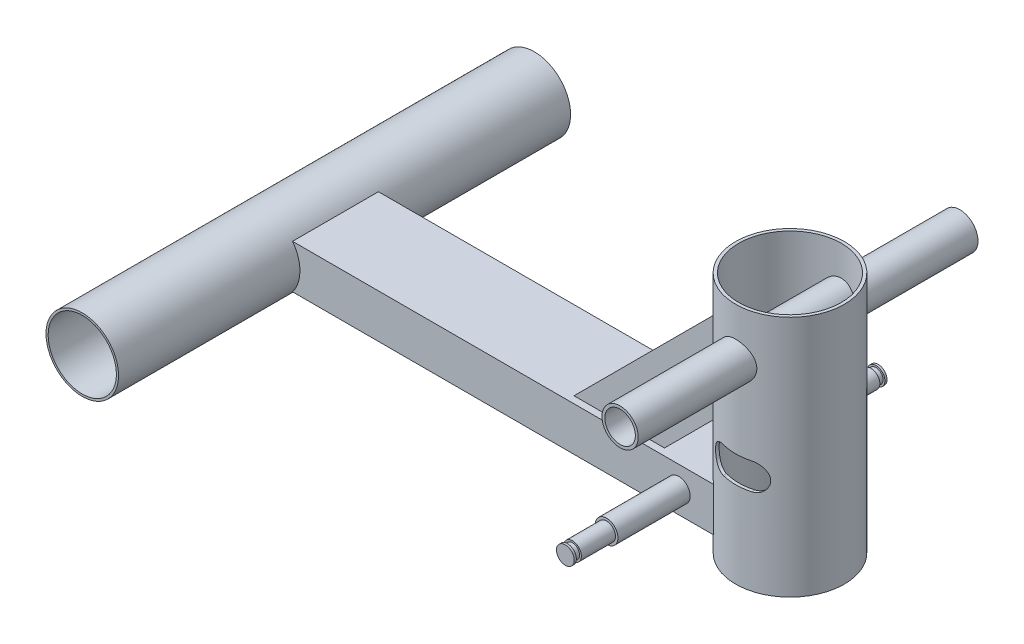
ISO-10303-21;
HEADER;
FILE_DESCRIPTION(('STEP AP214'),'2;1');
FILE_NAME('part.step','',(''),(''),'','','');
FILE_SCHEMA(('AUTOMOTIVE_DESIGN { 1 0 10303 214 1 1 1 1 }'));
ENDSEC;
DATA;
#1=APPLICATION_CONTEXT('core data for automotive mechanical design processes');
#2=APPLICATION_PROTOCOL_DEFINITION('international standard','automotive_design',2000,#1);
#3=PRODUCT_CONTEXT('',#1,'mechanical');
#4=PRODUCT('Part','Part','',(#3));
#5=PRODUCT_RELATED_PRODUCT_CATEGORY('part','',(#4));
#6=PRODUCT_DEFINITION_FORMATION('','',#4);
#7=PRODUCT_DEFINITION_CONTEXT('part definition',#1,'design');
#8=PRODUCT_DEFINITION('design','',#6,#7);
#9=PRODUCT_DEFINITION_SHAPE('','',#8);
#10=(LENGTH_UNIT() NAMED_UNIT(*) SI_UNIT(.MILLI.,.METRE.));
#11=(NAMED_UNIT(*) PLANE_ANGLE_UNIT() SI_UNIT($,.RADIAN.));
#12=(NAMED_UNIT(*) SI_UNIT($,.STERADIAN.) SOLID_ANGLE_UNIT());
#13=UNCERTAINTY_MEASURE_WITH_UNIT(LENGTH_MEASURE(1.E-05),#10,'distance_accuracy_value','');
#14=(GEOMETRIC_REPRESENTATION_CONTEXT(3) GLOBAL_UNCERTAINTY_ASSIGNED_CONTEXT((#13)) GLOBAL_UNIT_ASSIGNED_CONTEXT((#10,
#11,#12)) REPRESENTATION_CONTEXT('',''));
#15=CARTESIAN_POINT('',(0.,0.,0.));
#16=DIRECTION('',(0.,0.,1.));
#17=DIRECTION('',(1.,0.,0.));
#18=AXIS2_PLACEMENT_3D('',#15,#16,#17);
#19=CARTESIAN_POINT('',(285.637110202,-6.373879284,270.2));
#20=DIRECTION('',(0.,0.,1.));
#21=DIRECTION('',(1.,0.,0.));
#22=AXIS2_PLACEMENT_3D('',#19,#20,#21);
#23=PLANE('',#22);
#24=CARTESIAN_POINT('',(292.,0.,270.2));
#25=DIRECTION('',(0.,0.,-1.));
#26=DIRECTION('',(-1.,0.,0.));
#27=AXIS2_PLACEMENT_3D('',#24,#25,#26);
#28=CIRCLE('',#27,6.24999999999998);
#29=CARTESIAN_POINT('',(285.75,0.,270.2));
#30=VERTEX_POINT('',#29);
#31=EDGE_CURVE('E36',#30,#30,#28,.T.);
#32=ORIENTED_EDGE('',*,*,#31,.F.);
#33=EDGE_LOOP('',(#32));
#34=FACE_BOUND('',#33,.T.);
#35=ADVANCED_FACE('F32',(#34),#23,.T.);
#36=CARTESIAN_POINT('',(298.362889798,-6.373879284,50.2));
#37=DIRECTION('',(0.,0.,-1.));
#38=DIRECTION('',(-1.,0.,0.));
#39=AXIS2_PLACEMENT_3D('',#36,#37,#38);
#40=PLANE('',#39);
#41=CARTESIAN_POINT('',(292.,0.,50.2));
#42=DIRECTION('',(0.,0.,1.));
#43=DIRECTION('',(0.,-1.,0.));
#44=AXIS2_PLACEMENT_3D('',#41,#42,#43);
#45=CIRCLE('',#44,6.25000000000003);
#46=CARTESIAN_POINT('',(292.,-6.25000000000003,50.2));
#47=VERTEX_POINT('',#46);
#48=EDGE_CURVE('E683',#47,#47,#45,.T.);
#49=ORIENTED_EDGE('',*,*,#48,.F.);
#50=EDGE_LOOP('',(#49));
#51=FACE_BOUND('',#50,.T.);
#52=ADVANCED_FACE('F672',(#51),#40,.T.);
#53=CARTESIAN_POINT('',(292.,0.,270.2));
#54=DIRECTION('',(0.,0.,-1.));
#55=DIRECTION('',(-1.,0.,0.));
#56=AXIS2_PLACEMENT_3D('',#53,#54,#55);
#57=CYLINDRICAL_SURFACE('',#56,6.24999999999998);
#58=ORIENTED_EDGE('',*,*,#31,.T.);
#59=EDGE_LOOP('',(#58));
#60=FACE_BOUND('',#59,.T.);
#61=CARTESIAN_POINT('',(292.,0.,268.7));
#62=DIRECTION('',(0.,0.,-1.));
#63=DIRECTION('',(-1.,0.,0.));
#64=AXIS2_PLACEMENT_3D('',#61,#62,#63);
#65=CIRCLE('',#64,6.24999999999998);
#66=CARTESIAN_POINT('',(285.75,0.,268.7));
#67=VERTEX_POINT('',#66);
#68=EDGE_CURVE('E685',#67,#67,#65,.F.);
#69=ORIENTED_EDGE('',*,*,#68,.T.);
#70=EDGE_LOOP('',(#69));
#71=FACE_BOUND('',#70,.T.);
#72=ADVANCED_FACE('F674',(#60,#71),#57,.T.);
#73=CARTESIAN_POINT('',(292.,0.,50.2));
#74=DIRECTION('',(0.,0.,1.));
#75=DIRECTION('',(0.,-1.,0.));
#76=AXIS2_PLACEMENT_3D('',#73,#74,#75);
#77=CYLINDRICAL_SURFACE('',#76,6.25000000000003);
#78=ORIENTED_EDGE('',*,*,#48,.T.);
#79=EDGE_LOOP('',(#78));
#80=FACE_BOUND('',#79,.T.);
#81=CARTESIAN_POINT('',(292.,0.,51.7));
#82=DIRECTION('',(0.,0.,1.));
#83=DIRECTION('',(0.,-1.,0.));
#84=AXIS2_PLACEMENT_3D('',#81,#82,#83);
#85=CIRCLE('',#84,6.25000000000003);
#86=CARTESIAN_POINT('',(292.,-6.25000000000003,51.7));
#87=VERTEX_POINT('',#86);
#88=EDGE_CURVE('E689',#87,#87,#85,.F.);
#89=ORIENTED_EDGE('',*,*,#88,.T.);
#90=EDGE_LOOP('',(#89));
#91=FACE_BOUND('',#90,.T.);
#92=ADVANCED_FACE('F670',(#80,#91),#77,.T.);
#93=CARTESIAN_POINT('',(285.637110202,-6.373879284,268.7));
#94=DIRECTION('',(0.,0.,1.));
#95=DIRECTION('',(1.,0.,0.));
#96=AXIS2_PLACEMENT_3D('',#93,#94,#95);
#97=PLANE('',#96);
#98=CARTESIAN_POINT('',(292.,0.,268.7));
#99=DIRECTION('',(0.,0.,-1.));
#100=DIRECTION('',(0.,1.,0.));
#101=AXIS2_PLACEMENT_3D('',#98,#99,#100);
#102=CIRCLE('',#101,4.99999999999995);
#103=CARTESIAN_POINT('',(292.,4.99999999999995,268.7));
#104=VERTEX_POINT('',#103);
#105=EDGE_CURVE('E694',#104,#104,#102,.T.);
#106=ORIENTED_EDGE('',*,*,#105,.F.);
#107=EDGE_LOOP('',(#106));
#108=FACE_BOUND('',#107,.T.);
#109=ORIENTED_EDGE('',*,*,#68,.F.);
#110=EDGE_LOOP('',(#109));
#111=FACE_BOUND('',#110,.T.);
#112=ADVANCED_FACE('F666',(#108,#111),#97,.F.);
#113=CARTESIAN_POINT('',(298.362889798,-6.373879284,51.7));
#114=DIRECTION('',(0.,0.,-1.));
#115=DIRECTION('',(-1.,0.,0.));
#116=AXIS2_PLACEMENT_3D('',#113,#114,#115);
#117=PLANE('',#116);
#118=CARTESIAN_POINT('',(292.,0.,51.7));
#119=DIRECTION('',(0.,0.,1.));
#120=DIRECTION('',(0.,-1.,0.));
#121=AXIS2_PLACEMENT_3D('',#118,#119,#120);
#122=CIRCLE('',#121,5.);
#123=CARTESIAN_POINT('',(292.,-5.,51.7));
#124=VERTEX_POINT('',#123);
#125=EDGE_CURVE('E697',#124,#124,#122,.T.);
#126=ORIENTED_EDGE('',*,*,#125,.F.);
#127=EDGE_LOOP('',(#126));
#128=FACE_BOUND('',#127,.T.);
#129=ORIENTED_EDGE('',*,*,#88,.F.);
#130=EDGE_LOOP('',(#129));
#131=FACE_BOUND('',#130,.T.);
#132=ADVANCED_FACE('F662',(#128,#131),#117,.F.);
#133=CARTESIAN_POINT('',(292.,0.,268.7));
#134=DIRECTION('',(0.,0.,-1.));
#135=DIRECTION('',(0.,1.,0.));
#136=AXIS2_PLACEMENT_3D('',#133,#134,#135);
#137=CYLINDRICAL_SURFACE('',#136,4.99999999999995);
#138=CARTESIAN_POINT('',(292.,0.,265.2));
#139=DIRECTION('',(0.,0.,-1.));
#140=DIRECTION('',(0.,1.,0.));
#141=AXIS2_PLACEMENT_3D('',#138,#139,#140);
#142=CIRCLE('',#141,4.99999999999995);
#143=CARTESIAN_POINT('',(292.,4.99999999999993,265.2));
#144=VERTEX_POINT('',#143);
#145=EDGE_CURVE('E700',#144,#144,#142,.T.);
#146=ORIENTED_EDGE('',*,*,#145,.F.);
#147=EDGE_LOOP('',(#146));
#148=FACE_BOUND('',#147,.T.);
#149=ORIENTED_EDGE('',*,*,#105,.T.);
#150=EDGE_LOOP('',(#149));
#151=FACE_BOUND('',#150,.T.);
#152=ADVANCED_FACE('F665',(#148,#151),#137,.T.);
#153=CARTESIAN_POINT('',(292.,0.,51.7));
#154=DIRECTION('',(0.,0.,1.));
#155=DIRECTION('',(0.,-1.,0.));
#156=AXIS2_PLACEMENT_3D('',#153,#154,#155);
#157=CYLINDRICAL_SURFACE('',#156,5.);
#158=CARTESIAN_POINT('',(292.,0.,55.2));
#159=DIRECTION('',(0.,0.,1.));
#160=DIRECTION('',(0.,-1.,0.));
#161=AXIS2_PLACEMENT_3D('',#158,#159,#160);
#162=CIRCLE('',#161,5.);
#163=CARTESIAN_POINT('',(292.,-5.,55.2));
#164=VERTEX_POINT('',#163);
#165=EDGE_CURVE('E703',#164,#164,#162,.T.);
#166=ORIENTED_EDGE('',*,*,#165,.F.);
#167=EDGE_LOOP('',(#166));
#168=FACE_BOUND('',#167,.T.);
#169=ORIENTED_EDGE('',*,*,#125,.T.);
#170=EDGE_LOOP('',(#169));
#171=FACE_BOUND('',#170,.T.);
#172=ADVANCED_FACE('F660',(#168,#171),#157,.T.);
#173=CARTESIAN_POINT('',(285.637110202,-6.373879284,265.2));
#174=DIRECTION('',(0.,0.,1.));
#175=DIRECTION('',(1.,0.,0.));
#176=AXIS2_PLACEMENT_3D('',#173,#174,#175);
#177=PLANE('',#176);
#178=ORIENTED_EDGE('',*,*,#145,.T.);
#179=EDGE_LOOP('',(#178));
#180=FACE_BOUND('',#179,.T.);
#181=CARTESIAN_POINT('',(292.,0.,265.2));
#182=DIRECTION('',(0.,0.,-1.));
#183=DIRECTION('',(-1.,0.,0.));
#184=AXIS2_PLACEMENT_3D('',#181,#182,#183);
#185=CIRCLE('',#184,6.24999999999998);
#186=CARTESIAN_POINT('',(285.75,0.,265.2));
#187=VERTEX_POINT('',#186);
#188=EDGE_CURVE('E706',#187,#187,#185,.T.);
#189=ORIENTED_EDGE('',*,*,#188,.F.);
#190=EDGE_LOOP('',(#189));
#191=FACE_BOUND('',#190,.T.);
#192=ADVANCED_FACE('F656',(#180,#191),#177,.T.);
#193=CARTESIAN_POINT('',(298.362889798,-6.373879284,55.2));
#194=DIRECTION('',(0.,0.,-1.));
#195=DIRECTION('',(-1.,0.,0.));
#196=AXIS2_PLACEMENT_3D('',#193,#194,#195);
#197=PLANE('',#196);
#198=ORIENTED_EDGE('',*,*,#165,.T.);
#199=EDGE_LOOP('',(#198));
#200=FACE_BOUND('',#199,.T.);
#201=CARTESIAN_POINT('',(292.,0.,55.2));
#202=DIRECTION('',(0.,0.,1.));
#203=DIRECTION('',(0.,-1.,0.));
#204=AXIS2_PLACEMENT_3D('',#201,#202,#203);
#205=CIRCLE('',#204,6.25000000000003);
#206=CARTESIAN_POINT('',(292.,-6.25000000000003,55.2));
#207=VERTEX_POINT('',#206);
#208=EDGE_CURVE('E709',#207,#207,#205,.T.);
#209=ORIENTED_EDGE('',*,*,#208,.F.);
#210=EDGE_LOOP('',(#209));
#211=FACE_BOUND('',#210,.T.);
#212=ADVANCED_FACE('F652',(#200,#211),#197,.T.);
#213=CARTESIAN_POINT('',(292.,0.,265.2));
#214=DIRECTION('',(0.,0.,-1.));
#215=DIRECTION('',(-1.,0.,0.));
#216=AXIS2_PLACEMENT_3D('',#213,#214,#215);
#217=CYLINDRICAL_SURFACE('',#216,6.24999999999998);
#218=CARTESIAN_POINT('',(292.,0.,241.2));
#219=DIRECTION('',(0.,0.,-1.));
#220=DIRECTION('',(-1.,0.,0.));
#221=AXIS2_PLACEMENT_3D('',#218,#219,#220);
#222=CIRCLE('',#221,6.24999999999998);
#223=CARTESIAN_POINT('',(285.75,0.,241.2));
#224=VERTEX_POINT('',#223);
#225=EDGE_CURVE('E712',#224,#224,#222,.T.);
#226=ORIENTED_EDGE('',*,*,#225,.F.);
#227=EDGE_LOOP('',(#226));
#228=FACE_BOUND('',#227,.T.);
#229=ORIENTED_EDGE('',*,*,#188,.T.);
#230=EDGE_LOOP('',(#229));
#231=FACE_BOUND('',#230,.T.);
#232=ADVANCED_FACE('F655',(#228,#231),#217,.T.);
#233=CARTESIAN_POINT('',(0.,0.,318.));
#234=DIRECTION('',(0.,0.,-1.));
#235=DIRECTION('',(-1.,0.,0.));
#236=AXIS2_PLACEMENT_3D('',#233,#234,#235);
#237=CYLINDRICAL_SURFACE('',#236,24.);
#238=CARTESIAN_POINT('',(0.,0.,0.));
#239=DIRECTION('',(0.,0.,-1.));
#240=DIRECTION('',(-1.,0.,0.));
#241=AXIS2_PLACEMENT_3D('',#238,#239,#240);
#242=CIRCLE('',#241,24.);
#243=CARTESIAN_POINT('',(-24.,0.,0.));
#244=VERTEX_POINT('',#243);
#245=EDGE_CURVE('E718',#244,#244,#242,.T.);
#246=ORIENTED_EDGE('',*,*,#245,.T.);
#247=EDGE_LOOP('',(#246));
#248=FACE_BOUND('',#247,.T.);
#249=CARTESIAN_POINT('',(0.,0.,318.));
#250=DIRECTION('',(0.,0.,-1.));
#251=DIRECTION('',(-1.,0.,0.));
#252=AXIS2_PLACEMENT_3D('',#249,#250,#251);
#253=CIRCLE('',#252,24.);
#254=CARTESIAN_POINT('',(-24.,0.,318.));
#255=VERTEX_POINT('',#254);
#256=EDGE_CURVE('E715',#255,#255,#253,.T.);
#257=ORIENTED_EDGE('',*,*,#256,.F.);
#258=EDGE_LOOP('',(#257));
#259=FACE_BOUND('',#258,.T.);
#260=ADVANCED_FACE('F761',(#248,#259),#237,.F.);
#261=CARTESIAN_POINT('',(292.,0.,55.2));
#262=DIRECTION('',(0.,0.,1.));
#263=DIRECTION('',(0.,-1.,0.));
#264=AXIS2_PLACEMENT_3D('',#261,#262,#263);
#265=CYLINDRICAL_SURFACE('',#264,6.25000000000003);
#266=ORIENTED_EDGE('',*,*,#208,.T.);
#267=EDGE_LOOP('',(#266));
#268=FACE_BOUND('',#267,.T.);
#269=CARTESIAN_POINT('',(292.,0.,79.2));
#270=DIRECTION('',(0.,0.,1.));
#271=DIRECTION('',(0.,-1.,0.));
#272=AXIS2_PLACEMENT_3D('',#269,#270,#271);
#273=CIRCLE('',#272,6.25000000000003);
#274=CARTESIAN_POINT('',(292.,-6.25000000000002,79.2));
#275=VERTEX_POINT('',#274);
#276=EDGE_CURVE('E721',#275,#275,#273,.F.);
#277=ORIENTED_EDGE('',*,*,#276,.T.);
#278=EDGE_LOOP('',(#277));
#279=FACE_BOUND('',#278,.T.);
#280=ADVANCED_FACE('F755',(#268,#279),#265,.T.);
#281=CARTESIAN_POINT('',(340.,106.9,279.7));
#282=DIRECTION('',(0.,0.,-1.));
#283=DIRECTION('',(-1.,0.,0.));
#284=AXIS2_PLACEMENT_3D('',#281,#282,#283);
#285=CYLINDRICAL_SURFACE('',#284,10.75);
#286=CARTESIAN_POINT('',(340.,106.9,279.7));
#287=DIRECTION('',(0.,0.,-1.));
#288=DIRECTION('',(-1.,0.,0.));
#289=AXIS2_PLACEMENT_3D('',#286,#287,#288);
#290=CIRCLE('',#289,10.75);
#291=CARTESIAN_POINT('',(329.25,106.9,279.7));
#292=VERTEX_POINT('',#291);
#293=EDGE_CURVE('E727',#292,#292,#290,.T.);
#294=ORIENTED_EDGE('',*,*,#293,.F.);
#295=EDGE_LOOP('',(#294));
#296=FACE_BOUND('',#295,.T.);
#297=CARTESIAN_POINT('',(340.,106.9,40.7));
#298=DIRECTION('',(0.,0.,-1.));
#299=DIRECTION('',(-1.,0.,0.));
#300=AXIS2_PLACEMENT_3D('',#297,#298,#299);
#301=CIRCLE('',#300,10.75);
#302=CARTESIAN_POINT('',(329.25,106.9,40.7));
#303=VERTEX_POINT('',#302);
#304=EDGE_CURVE('E724',#303,#303,#301,.T.);
#305=ORIENTED_EDGE('',*,*,#304,.T.);
#306=EDGE_LOOP('',(#305));
#307=FACE_BOUND('',#306,.T.);
#308=ADVANCED_FACE('F526',(#296,#307),#285,.F.);
#309=CARTESIAN_POINT('',(283.855501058,-8.158565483,241.2));
#310=DIRECTION('',(0.,0.,1.));
#311=DIRECTION('',(1.,0.,0.));
#312=AXIS2_PLACEMENT_3D('',#309,#310,#311);
#313=PLANE('',#312);
#314=ORIENTED_EDGE('',*,*,#225,.T.);
#315=EDGE_LOOP('',(#314));
#316=FACE_BOUND('',#315,.T.);
#317=CARTESIAN_POINT('',(292.,0.,241.2));
#318=DIRECTION('',(0.,0.,-1.));
#319=DIRECTION('',(-1.,0.,0.));
#320=AXIS2_PLACEMENT_3D('',#317,#318,#319);
#321=CIRCLE('',#320,7.99999999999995);
#322=CARTESIAN_POINT('',(284.,0.,241.2));
#323=VERTEX_POINT('',#322);
#324=EDGE_CURVE('E730',#323,#323,#321,.T.);
#325=ORIENTED_EDGE('',*,*,#324,.F.);
#326=EDGE_LOOP('',(#325));
#327=FACE_BOUND('',#326,.T.);
#328=ADVANCED_FACE('F647',(#316,#327),#313,.T.);
#329=CARTESIAN_POINT('',(-25.960590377,-26.005427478,318.));
#330=DIRECTION('',(0.,0.,1.));
#331=DIRECTION('',(1.,0.,0.));
#332=AXIS2_PLACEMENT_3D('',#329,#330,#331);
#333=PLANE('',#332);
#334=ORIENTED_EDGE('',*,*,#256,.T.);
#335=EDGE_LOOP('',(#334));
#336=FACE_BOUND('',#335,.T.);
#337=CARTESIAN_POINT('',(0.,0.,318.));
#338=DIRECTION('',(0.,0.,-1.));
#339=DIRECTION('',(-1.,0.,0.));
#340=AXIS2_PLACEMENT_3D('',#337,#338,#339);
#341=CIRCLE('',#340,25.5);
#342=CARTESIAN_POINT('',(-25.5,0.,318.));
#343=VERTEX_POINT('',#342);
#344=EDGE_CURVE('E733',#343,#343,#341,.T.);
#345=ORIENTED_EDGE('',*,*,#344,.F.);
#346=EDGE_LOOP('',(#345));
#347=FACE_BOUND('',#346,.T.);
#348=ADVANCED_FACE('F643',(#336,#347),#333,.T.);
#349=CARTESIAN_POINT('',(-25.960590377,-26.005427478,0.));
#350=DIRECTION('',(0.,0.,1.));
#351=DIRECTION('',(1.,0.,0.));
#352=AXIS2_PLACEMENT_3D('',#349,#350,#351);
#353=PLANE('',#352);
#354=ORIENTED_EDGE('',*,*,#245,.F.);
#355=EDGE_LOOP('',(#354));
#356=FACE_BOUND('',#355,.T.);
#357=CARTESIAN_POINT('',(0.,0.,0.));
#358=DIRECTION('',(0.,0.,-1.));
#359=DIRECTION('',(-1.,0.,0.));
#360=AXIS2_PLACEMENT_3D('',#357,#358,#359);
#361=CIRCLE('',#360,25.5);
#362=CARTESIAN_POINT('',(-25.5,0.,0.));
#363=VERTEX_POINT('',#362);
#364=EDGE_CURVE('E736',#363,#363,#361,.F.);
#365=ORIENTED_EDGE('',*,*,#364,.F.);
#366=EDGE_LOOP('',(#365));
#367=FACE_BOUND('',#366,.T.);
#368=ADVANCED_FACE('F639',(#356,#367),#353,.F.);
#369=CARTESIAN_POINT('',(283.855501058,-8.158565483,79.2));
#370=DIRECTION('',(0.,0.,1.));
#371=DIRECTION('',(1.,0.,0.));
#372=AXIS2_PLACEMENT_3D('',#369,#370,#371);
#373=PLANE('',#372);
#374=ORIENTED_EDGE('',*,*,#276,.F.);
#375=EDGE_LOOP('',(#374));
#376=FACE_BOUND('',#375,.T.);
#377=CARTESIAN_POINT('',(292.,0.,79.2));
#378=DIRECTION('',(0.,0.,-1.));
#379=DIRECTION('',(-1.,0.,0.));
#380=AXIS2_PLACEMENT_3D('',#377,#378,#379);
#381=CIRCLE('',#380,7.99999999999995);
#382=CARTESIAN_POINT('',(284.,0.,79.2));
#383=VERTEX_POINT('',#382);
#384=EDGE_CURVE('E156',#383,#383,#381,.F.);
#385=ORIENTED_EDGE('',*,*,#384,.F.);
#386=EDGE_LOOP('',(#385));
#387=FACE_BOUND('',#386,.T.);
#388=ADVANCED_FACE('F635',(#376,#387),#373,.F.);
#389=CARTESIAN_POINT('',(327.019704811,93.897286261,40.7));
#390=DIRECTION('',(0.,0.,1.));
#391=DIRECTION('',(1.,0.,0.));
#392=AXIS2_PLACEMENT_3D('',#389,#390,#391);
#393=PLANE('',#392);
#394=ORIENTED_EDGE('',*,*,#304,.F.);
#395=EDGE_LOOP('',(#394));
#396=FACE_BOUND('',#395,.T.);
#397=CARTESIAN_POINT('',(340.,106.9,40.7));
#398=DIRECTION('',(0.,0.,-1.));
#399=DIRECTION('',(0.,1.,0.));
#400=AXIS2_PLACEMENT_3D('',#397,#398,#399);
#401=CIRCLE('',#400,12.75);
#402=CARTESIAN_POINT('',(340.,119.65,40.7));
#403=VERTEX_POINT('',#402);
#404=EDGE_CURVE('E343',#403,#403,#401,.F.);
#405=ORIENTED_EDGE('',*,*,#404,.F.);
#406=EDGE_LOOP('',(#405));
#407=FACE_BOUND('',#406,.T.);
#408=ADVANCED_FACE('F525',(#396,#407),#393,.F.);
#409=CARTESIAN_POINT('',(350.,40.4,129.795170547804));
#410=DIRECTION('',(0.,0.,-1.));
#411=DIRECTION('',(-1.,0.,0.));
#412=AXIS2_PLACEMENT_3D('',#409,#410,#411);
#413=CYLINDRICAL_SURFACE('',#412,9.40000000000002);
#414=DIRECTION('',(0.,0.,-1.));
#415=VECTOR('',#414,1.);
#416=CARTESIAN_POINT('',(350.,31.,123.5644650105));
#417=LINE('',#416,#415);
#418=CARTESIAN_POINT('',(350.000000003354,31.000000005,125.512682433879));
#419=VERTEX_POINT('',#418);
#420=CARTESIAN_POINT('',(350.,31.000000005,123.280323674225));
#421=VERTEX_POINT('',#420);
#422=EDGE_CURVE('E333',#419,#421,#417,.T.);
#423=ORIENTED_EDGE('',*,*,#422,.F.);
#424=CARTESIAN_POINT('',(350.000000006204,31.0000000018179,125.512682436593));
#425=CARTESIAN_POINT('',(350.279639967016,30.9999753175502,125.593263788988));
#426=CARTESIAN_POINT('',(350.558233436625,31.0124761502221,125.677276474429));
#427=CARTESIAN_POINT('',(351.111238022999,31.0617964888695,125.851292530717));
#428=CARTESIAN_POINT('',(351.385650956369,31.0986051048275,125.941293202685));
#429=CARTESIAN_POINT('',(351.927748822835,31.1956827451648,126.126244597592));
#430=CARTESIAN_POINT('',(352.1954494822,31.2558901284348,126.221181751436));
#431=CARTESIAN_POINT('',(352.723192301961,31.3989462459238,126.415249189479));
#432=CARTESIAN_POINT('',(352.983233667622,31.4817973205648,126.514379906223));
#433=CARTESIAN_POINT('',(353.493654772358,31.6691257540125,126.715579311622));
#434=CARTESIAN_POINT('',(353.744050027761,31.7735665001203,126.817642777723));
#435=CARTESIAN_POINT('',(354.234334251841,32.0033496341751,127.023736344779));
#436=CARTESIAN_POINT('',(354.474219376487,32.1286995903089,127.127767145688));
#437=CARTESIAN_POINT('',(354.942274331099,32.3995566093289,127.33658317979));
#438=CARTESIAN_POINT('',(355.170434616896,32.5450797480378,127.441368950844));
#439=CARTESIAN_POINT('',(355.613566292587,32.8553967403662,127.650245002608));
#440=CARTESIAN_POINT('',(355.828538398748,33.0201895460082,127.754335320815));
#441=CARTESIAN_POINT('',(356.25319882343,33.3759301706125,127.964892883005));
#442=CARTESIAN_POINT('',(356.462240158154,33.5677089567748,128.071263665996));
#443=CARTESIAN_POINT('',(356.863130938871,33.9705232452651,128.279851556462));
#444=CARTESIAN_POINT('',(357.054981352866,34.1815576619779,128.382068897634));
#445=CARTESIAN_POINT('',(357.419941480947,34.6219174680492,128.580405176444));
#446=CARTESIAN_POINT('',(357.593052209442,34.8512418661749,128.676524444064));
#447=CARTESIAN_POINT('',(357.918884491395,35.3270906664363,128.860590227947));
#448=CARTESIAN_POINT('',(358.071604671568,35.5736162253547,128.948536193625));
#449=CARTESIAN_POINT('',(358.348022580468,36.0701816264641,129.11005853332));
#450=CARTESIAN_POINT('',(358.472763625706,36.3194807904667,129.184122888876));
#451=CARTESIAN_POINT('',(358.700466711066,36.8306721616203,129.320877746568));
#452=CARTESIAN_POINT('',(358.803442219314,37.0925564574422,129.383575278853));
#453=CARTESIAN_POINT('',(358.986033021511,37.6267716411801,129.495732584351));
#454=CARTESIAN_POINT('',(359.065674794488,37.8990902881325,129.545207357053));
#455=CARTESIAN_POINT('',(359.200330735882,38.451972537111,129.629366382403));
#456=CARTESIAN_POINT('',(359.255350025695,38.7325344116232,129.664053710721));
#457=CARTESIAN_POINT('',(359.333427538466,39.2569242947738,129.71343970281));
#458=CARTESIAN_POINT('',(359.360016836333,39.5000257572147,129.730340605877));
#459=CARTESIAN_POINT('',(359.394154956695,39.9880899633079,129.752057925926));
#460=CARTESIAN_POINT('',(359.401705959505,40.2330524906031,129.756875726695));
#461=CARTESIAN_POINT('',(359.397649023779,40.7226787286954,129.754290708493));
#462=CARTESIAN_POINT('',(359.386046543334,40.967342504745,129.74689137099));
#463=CARTESIAN_POINT('',(359.343878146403,41.4543606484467,129.720088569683));
#464=CARTESIAN_POINT('',(359.313312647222,41.6967150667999,129.70068537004));
#465=CARTESIAN_POINT('',(359.23707803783,42.1567141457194,129.652550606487));
#466=CARTESIAN_POINT('',(359.192912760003,42.3747087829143,129.624751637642));
#467=CARTESIAN_POINT('',(359.089615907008,42.8058329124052,129.560152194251));
#468=CARTESIAN_POINT('',(359.030479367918,43.0189607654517,129.523348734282));
#469=CARTESIAN_POINT('',(358.897910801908,43.4390270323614,129.44150481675));
#470=CARTESIAN_POINT('',(358.824482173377,43.6459669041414,129.396466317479));
#471=CARTESIAN_POINT('',(358.664009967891,44.0527752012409,129.298971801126));
#472=CARTESIAN_POINT('',(358.576961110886,44.2526408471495,129.246512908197));
#473=CARTESIAN_POINT('',(358.38347913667,44.65807408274,129.131185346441));
#474=CARTESIAN_POINT('',(358.276116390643,44.86306372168,129.067845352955));
#475=CARTESIAN_POINT('',(358.047566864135,45.2631018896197,128.934798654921));
#476=CARTESIAN_POINT('',(357.926375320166,45.4581469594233,128.86508975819));
#477=CARTESIAN_POINT('',(357.671061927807,45.8375641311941,128.720401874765));
#478=CARTESIAN_POINT('',(357.536937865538,46.0219343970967,128.645421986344));
#479=CARTESIAN_POINT('',(357.256620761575,46.3793854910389,128.491253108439));
#480=CARTESIAN_POINT('',(357.110427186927,46.5524658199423,128.41206393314));
#481=CARTESIAN_POINT('',(356.785040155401,46.9107497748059,128.238913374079));
#482=CARTESIAN_POINT('',(356.604117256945,47.0941475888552,128.144458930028));
#483=CARTESIAN_POINT('',(356.228709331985,47.4447956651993,127.952776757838));
#484=CARTESIAN_POINT('',(356.0342269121,47.6120490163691,127.855549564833));
#485=CARTESIAN_POINT('',(355.632545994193,47.9299457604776,127.659510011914));
#486=CARTESIAN_POINT('',(355.425335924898,48.0805736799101,127.56069627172));
#487=CARTESIAN_POINT('',(354.999395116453,48.3643930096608,127.362775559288));
#488=CARTESIAN_POINT('',(354.780662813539,48.4975820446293,127.263668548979));
#489=CARTESIAN_POINT('',(354.311030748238,48.7578645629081,127.056728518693));
#490=CARTESIAN_POINT('',(354.059068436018,48.8831147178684,126.948981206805));
#491=CARTESIAN_POINT('',(353.544159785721,49.1108063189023,126.735939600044));
#492=CARTESIAN_POINT('',(353.281217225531,49.213255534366,126.630644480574));
#493=CARTESIAN_POINT('',(352.746225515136,49.3943252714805,126.423886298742));
#494=CARTESIAN_POINT('',(352.474188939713,49.472977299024,126.322418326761));
#495=CARTESIAN_POINT('',(351.922570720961,49.6056578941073,126.124376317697));
#496=CARTESIAN_POINT('',(351.642993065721,49.6596992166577,126.027799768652));
#497=CARTESIAN_POINT('',(351.136527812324,49.7337872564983,125.85988584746));
#498=CARTESIAN_POINT('',(350.910682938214,49.7585496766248,125.78745515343));
#499=CARTESIAN_POINT('',(350.456790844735,49.7916507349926,125.646821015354));
#500=CARTESIAN_POINT('',(350.228746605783,49.8000091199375,125.578612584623));
#501=CARTESIAN_POINT('',(350.000000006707,49.8,125.512682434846));
#502=B_SPLINE_CURVE_WITH_KNOTS('',3,(#424,#425,#426,#427,#428,#429,#430,#431,#432,#433,#434,
#435,#436,#437,#438,#439,#440,#441,#442,#443,#444,#445,#446,#447,#448,#449,#450,#451,#452,#453,
#454,#455,#456,#457,#458,#459,#460,#461,#462,#463,#464,#465,#466,#467,#468,#469,#470,#471,#472,
#473,#474,#475,#476,#477,#478,#479,#480,#481,#482,#483,#484,#485,#486,#487,#488,#489,#490,#491,
#492,#493,#494,#495,#496,#497,#498,#499,#500,#501),.UNSPECIFIED.,.F.,.F.,(4,2,2,2,2,2,2,2,2,2,2,
2,2,2,2,2,2,2,2,2,2,2,2,2,2,2,2,2,2,2,2,2,2,2,2,2,2,2,4),(0.,0.872685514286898,1.74498032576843,
2.61499259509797,3.48509482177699,4.3537334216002,5.22268711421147,6.09233729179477,
6.96194019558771,7.86974490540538,8.77749846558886,9.68520286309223,10.5929683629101,
11.4570277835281,12.3205509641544,13.1830903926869,14.0454503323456,14.7798516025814,
15.5141687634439,16.2482767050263,16.982368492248,17.6540917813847,18.3260380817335,
18.9978248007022,19.6698725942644,20.3888956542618,21.1081671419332,21.8275619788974,
22.5469885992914,23.3692956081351,24.1914449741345,25.0143531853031,25.837373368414,
26.7401977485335,27.6427140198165,28.5440301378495,29.4448785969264,30.1596817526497,
30.8736239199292),.UNSPECIFIED.);
#503=CARTESIAN_POINT('',(350.000000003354,49.8000000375,125.512682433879));
#504=VERTEX_POINT('',#503);
#505=EDGE_CURVE('E155',#419,#504,#502,.T.);
#506=ORIENTED_EDGE('',*,*,#505,.T.);
#507=DIRECTION('',(0.,0.,1.));
#508=VECTOR('',#507,1.);
#509=CARTESIAN_POINT('',(350.,49.8,123.5644650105));
#510=LINE('',#509,#508);
#511=CARTESIAN_POINT('',(350.000000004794,49.8000000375,123.280323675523));
#512=VERTEX_POINT('',#511);
#513=EDGE_CURVE('E353',#512,#504,#510,.T.);
#514=ORIENTED_EDGE('',*,*,#513,.F.);
#515=CARTESIAN_POINT('',(350.000000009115,31.000000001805,123.280323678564));
#516=CARTESIAN_POINT('',(350.277967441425,30.9999747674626,123.355580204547));
#517=CARTESIAN_POINT('',(350.55502156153,31.0123274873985,123.434023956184));
#518=CARTESIAN_POINT('',(351.105236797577,31.0611260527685,123.596478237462));
#519=CARTESIAN_POINT('',(351.378399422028,31.09756228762,123.680486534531));
#520=CARTESIAN_POINT('',(351.918358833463,31.193753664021,123.85312166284));
#521=CARTESIAN_POINT('',(352.1851689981,31.2534541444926,123.941737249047));
#522=CARTESIAN_POINT('',(352.71138563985,31.3954094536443,124.12285256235));
#523=CARTESIAN_POINT('',(352.970791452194,31.4776663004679,124.215352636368));
#524=CARTESIAN_POINT('',(353.480226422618,31.6637842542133,124.403078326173));
#525=CARTESIAN_POINT('',(353.730268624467,31.767613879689,124.498299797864));
#526=CARTESIAN_POINT('',(354.220020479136,31.9961628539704,124.690525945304));
#527=CARTESIAN_POINT('',(354.459726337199,32.1208897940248,124.787531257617));
#528=CARTESIAN_POINT('',(354.927461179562,32.3904420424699,124.982140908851));
#529=CARTESIAN_POINT('',(355.155484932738,32.5352762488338,125.079745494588));
#530=CARTESIAN_POINT('',(355.59851535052,32.8442348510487,125.274259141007));
#531=CARTESIAN_POINT('',(355.813517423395,33.0083659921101,125.371167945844));
#532=CARTESIAN_POINT('',(356.236865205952,33.3615134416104,125.566446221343));
#533=CARTESIAN_POINT('',(356.444665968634,33.5512282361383,125.664735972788));
#534=CARTESIAN_POINT('',(356.843328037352,33.9495531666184,125.857405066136));
#535=CARTESIAN_POINT('',(357.034188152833,34.1581646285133,125.951784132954));
#536=CARTESIAN_POINT('',(357.397452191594,34.5932770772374,126.134877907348));
#537=CARTESIAN_POINT('',(357.569853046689,34.8197810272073,126.223591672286));
#538=CARTESIAN_POINT('',(357.894462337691,35.2893373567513,126.393428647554));
#539=CARTESIAN_POINT('',(358.046681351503,35.5323809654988,126.474555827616));
#540=CARTESIAN_POINT('',(358.32324567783,36.0228560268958,126.624044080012));
#541=CARTESIAN_POINT('',(358.448509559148,36.2696469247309,126.692804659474));
#542=CARTESIAN_POINT('',(358.677531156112,36.775436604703,126.81992375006));
#543=CARTESIAN_POINT('',(358.781301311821,37.034428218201,126.878288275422));
#544=CARTESIAN_POINT('',(358.965891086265,37.562575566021,126.983005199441));
#545=CARTESIAN_POINT('',(359.046730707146,37.8317222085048,127.02936806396));
#546=CARTESIAN_POINT('',(359.184276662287,38.3780304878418,127.108726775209));
#547=CARTESIAN_POINT('',(359.240987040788,38.6551907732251,127.141724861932));
#548=CARTESIAN_POINT('',(359.323568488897,39.1785635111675,127.189938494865));
#549=CARTESIAN_POINT('',(359.352480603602,39.4241396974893,127.206902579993));
#550=CARTESIAN_POINT('',(359.390855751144,39.9173191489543,127.229441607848));
#551=CARTESIAN_POINT('',(359.400320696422,40.1649222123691,127.235017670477));
#552=CARTESIAN_POINT('',(359.399662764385,40.6600152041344,127.234630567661));
#553=CARTESIAN_POINT('',(359.389545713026,40.9075051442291,127.228670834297));
#554=CARTESIAN_POINT('',(359.349885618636,41.4003785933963,127.205379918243));
#555=CARTESIAN_POINT('',(359.320343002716,41.6457621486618,127.188048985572));
#556=CARTESIAN_POINT('',(359.245221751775,42.1139931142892,127.144203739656));
#557=CARTESIAN_POINT('',(359.201027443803,42.337139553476,127.118484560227));
#558=CARTESIAN_POINT('',(359.09690715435,42.7785978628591,127.05827023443));
#559=CARTESIAN_POINT('',(359.036975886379,42.9969080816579,127.023772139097));
#560=CARTESIAN_POINT('',(358.902044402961,43.4272852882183,126.946710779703));
#561=CARTESIAN_POINT('',(358.827047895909,43.6393537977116,126.904149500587));
#562=CARTESIAN_POINT('',(358.662668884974,44.0562830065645,126.811735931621));
#563=CARTESIAN_POINT('',(358.573280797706,44.2611408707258,126.761880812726));
#564=CARTESIAN_POINT('',(358.375252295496,44.6744228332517,126.652628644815));
#565=CARTESIAN_POINT('',(358.265789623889,44.8823500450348,126.592843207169));
#566=CARTESIAN_POINT('',(358.032505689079,45.2881125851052,126.467096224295));
#567=CARTESIAN_POINT('',(357.90867948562,45.4859444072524,126.401132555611));
#568=CARTESIAN_POINT('',(357.647587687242,45.8706910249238,126.264076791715));
#569=CARTESIAN_POINT('',(357.510320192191,46.0576042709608,126.192983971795));
#570=CARTESIAN_POINT('',(357.223238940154,46.4198199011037,126.046691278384));
#571=CARTESIAN_POINT('',(357.073424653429,46.595121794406,125.971491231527));
#572=CARTESIAN_POINT('',(356.742572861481,46.9547425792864,125.808331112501));
#573=CARTESIAN_POINT('',(356.559975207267,47.1374389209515,125.719952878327));
#574=CARTESIAN_POINT('',(356.181156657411,47.4865821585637,125.540562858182));
#575=CARTESIAN_POINT('',(355.984938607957,47.6530324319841,125.44955162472));
#576=CARTESIAN_POINT('',(355.579778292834,47.9691577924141,125.266026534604));
#577=CARTESIAN_POINT('',(355.37082518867,48.1188182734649,125.173511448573));
#578=CARTESIAN_POINT('',(354.941436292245,48.4005094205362,124.988202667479));
#579=CARTESIAN_POINT('',(354.720998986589,48.532537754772,124.895408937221));
#580=CARTESIAN_POINT('',(354.250508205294,48.7887375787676,124.702739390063));
#581=CARTESIAN_POINT('',(353.999533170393,48.9112752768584,124.602935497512));
#582=CARTESIAN_POINT('',(353.487016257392,49.1337697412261,124.405611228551));
#583=CARTESIAN_POINT('',(353.225478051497,49.2337342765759,124.308090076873));
#584=CARTESIAN_POINT('',(352.693727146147,49.4101164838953,124.116603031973));
#585=CARTESIAN_POINT('',(352.423526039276,49.4865642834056,124.022632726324));
#586=CARTESIAN_POINT('',(351.87603078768,49.6151791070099,123.83922876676));
#587=CARTESIAN_POINT('',(351.59874036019,49.6673585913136,123.749792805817));
#588=CARTESIAN_POINT('',(351.101381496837,49.7378372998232,123.595715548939));
#589=CARTESIAN_POINT('',(350.882339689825,49.7610966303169,123.529992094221));
#590=CARTESIAN_POINT('',(350.442391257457,49.792172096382,123.40228812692));
#591=CARTESIAN_POINT('',(350.221487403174,49.8000081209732,123.340302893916));
#592=CARTESIAN_POINT('',(350.000000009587,49.8,123.280323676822));
#593=B_SPLINE_CURVE_WITH_KNOTS('',3,(#515,#516,#517,#518,#519,#520,#521,#522,#523,#524,#525,
#526,#527,#528,#529,#530,#531,#532,#533,#534,#535,#536,#537,#538,#539,#540,#541,#542,#543,#544,
#545,#546,#547,#548,#549,#550,#551,#552,#553,#554,#555,#556,#557,#558,#559,#560,#561,#562,#563,
#564,#565,#566,#567,#568,#569,#570,#571,#572,#573,#574,#575,#576,#577,#578,#579,#580,#581,#582,
#583,#584,#585,#586,#587,#588,#589,#590,#591,#592),.UNSPECIFIED.,.F.,.F.,(4,2,2,2,2,2,2,2,2,2,2,
2,2,2,2,2,2,2,2,2,2,2,2,2,2,2,2,2,2,2,2,2,2,2,2,2,2,2,4),(0.,0.863570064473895,1.72679572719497,
2.58800528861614,3.44929192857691,4.30933039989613,5.16968197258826,6.03041549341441,
6.89145078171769,7.78450904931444,8.67763002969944,9.5708992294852,10.4636983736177,
11.318019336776,12.1718444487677,13.0249224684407,13.8778574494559,14.6204217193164,
15.3629129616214,16.1051833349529,16.8474373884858,17.533462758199,18.2197188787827,
18.9058062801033,19.5921605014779,20.3188153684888,21.0457209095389,21.7727293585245,
22.4997685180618,23.3179082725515,24.1358775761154,24.9545530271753,25.7733366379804,
26.662042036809,27.5504410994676,28.4376972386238,29.3244973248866,30.013570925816,
30.7017553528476),.UNSPECIFIED.);
#594=EDGE_CURVE('E231',#421,#512,#593,.T.);
#595=ORIENTED_EDGE('',*,*,#594,.F.);
#596=EDGE_LOOP('',(#423,#506,#514,#595));
#597=FACE_BOUND('',#596,.T.);
#598=ADVANCED_FACE('F345',(#597),#413,.F.);
#599=CARTESIAN_POINT('',(327.019704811,93.897286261,279.7));
#600=DIRECTION('',(0.,0.,1.));
#601=DIRECTION('',(1.,0.,0.));
#602=AXIS2_PLACEMENT_3D('',#599,#600,#601);
#603=PLANE('',#602);
#604=ORIENTED_EDGE('',*,*,#293,.T.);
#605=EDGE_LOOP('',(#604));
#606=FACE_BOUND('',#605,.T.);
#607=CARTESIAN_POINT('',(340.,106.9,279.7));
#608=DIRECTION('',(0.,0.,-1.));
#609=DIRECTION('',(-1.,0.,0.));
#610=AXIS2_PLACEMENT_3D('',#607,#608,#609);
#611=CIRCLE('',#610,12.75);
#612=CARTESIAN_POINT('',(327.25,106.9,279.7));
#613=VERTEX_POINT('',#612);
#614=EDGE_CURVE('E400',#613,#613,#611,.T.);
#615=ORIENTED_EDGE('',*,*,#614,.F.);
#616=EDGE_LOOP('',(#615));
#617=FACE_BOUND('',#616,.T.);
#618=ADVANCED_FACE('F524',(#606,#617),#603,.T.);
#619=CARTESIAN_POINT('',(292.,0.,241.2));
#620=DIRECTION('',(0.,0.,-1.));
#621=DIRECTION('',(-1.,0.,0.));
#622=AXIS2_PLACEMENT_3D('',#619,#620,#621);
#623=CYLINDRICAL_SURFACE('',#622,7.99999999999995);
#624=ORIENTED_EDGE('',*,*,#324,.T.);
#625=EDGE_LOOP('',(#624));
#626=FACE_BOUND('',#625,.T.);
#627=CARTESIAN_POINT('',(292.,0.,190.4));
#628=DIRECTION('',(0.,0.,-1.));
#629=DIRECTION('',(-1.,0.,0.));
#630=AXIS2_PLACEMENT_3D('',#627,#628,#629);
#631=CIRCLE('',#630,7.99999999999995);
#632=CARTESIAN_POINT('',(284.,0.,190.4));
#633=VERTEX_POINT('',#632);
#634=EDGE_CURVE('E382',#633,#633,#631,.T.);
#635=ORIENTED_EDGE('',*,*,#634,.F.);
#636=EDGE_LOOP('',(#635));
#637=FACE_BOUND('',#636,.T.);
#638=ADVANCED_FACE('F528',(#626,#637),#623,.T.);
#639=CARTESIAN_POINT('',(0.,0.,318.));
#640=DIRECTION('',(0.,0.,-1.));
#641=DIRECTION('',(-1.,0.,0.));
#642=AXIS2_PLACEMENT_3D('',#639,#640,#641);
#643=CYLINDRICAL_SURFACE('',#642,25.5);
#644=CARTESIAN_POINT('',(0.,0.,190.399999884));
#645=DIRECTION('',(0.,0.,-1.));
#646=DIRECTION('',(-1.,0.,0.));
#647=AXIS2_PLACEMENT_3D('',#644,#645,#646);
#648=CIRCLE('',#647,25.5);
#649=CARTESIAN_POINT('',(20.3246156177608,15.4,190.399999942));
#650=VERTEX_POINT('',#649);
#651=CARTESIAN_POINT('',(20.3246156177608,-15.4,190.399999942));
#652=VERTEX_POINT('',#651);
#653=EDGE_CURVE('E377',#650,#652,#648,.T.);
#654=ORIENTED_EDGE('',*,*,#653,.F.);
#655=DIRECTION('',(0.,0.,1.));
#656=VECTOR('',#655,1.);
#657=CARTESIAN_POINT('',(20.324615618,15.4,160.2));
#658=LINE('',#657,#656);
#659=CARTESIAN_POINT('',(20.3246156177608,15.4,129.999999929));
#660=VERTEX_POINT('',#659);
#661=EDGE_CURVE('E396',#660,#650,#658,.T.);
#662=ORIENTED_EDGE('',*,*,#661,.F.);
#663=CARTESIAN_POINT('',(0.,0.,129.999999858));
#664=DIRECTION('',(0.,0.,-1.));
#665=DIRECTION('',(-1.,0.,0.));
#666=AXIS2_PLACEMENT_3D('',#663,#664,#665);
#667=CIRCLE('',#666,25.5);
#668=CARTESIAN_POINT('',(20.3246156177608,-15.4,129.999999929));
#669=VERTEX_POINT('',#668);
#670=EDGE_CURVE('E384',#669,#660,#667,.F.);
#671=ORIENTED_EDGE('',*,*,#670,.F.);
#672=DIRECTION('',(0.,0.,-1.));
#673=VECTOR('',#672,1.);
#674=CARTESIAN_POINT('',(20.324615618,-15.4,160.2));
#675=LINE('',#674,#673);
#676=EDGE_CURVE('E381',#652,#669,#675,.T.);
#677=ORIENTED_EDGE('',*,*,#676,.F.);
#678=EDGE_LOOP('',(#654,#662,#671,#677));
#679=FACE_BOUND('',#678,.T.);
#680=ORIENTED_EDGE('',*,*,#364,.T.);
#681=EDGE_LOOP('',(#680));
#682=FACE_BOUND('',#681,.T.);
#683=ORIENTED_EDGE('',*,*,#344,.T.);
#684=EDGE_LOOP('',(#683));
#685=FACE_BOUND('',#684,.T.);
#686=ADVANCED_FACE('F532',(#679,#682,#685),#643,.T.);
#687=CARTESIAN_POINT('',(292.,0.,130.));
#688=DIRECTION('',(0.,0.,-1.));
#689=DIRECTION('',(-1.,0.,0.));
#690=AXIS2_PLACEMENT_3D('',#687,#688,#689);
#691=CYLINDRICAL_SURFACE('',#690,7.99999999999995);
#692=ORIENTED_EDGE('',*,*,#384,.T.);
#693=EDGE_LOOP('',(#692));
#694=FACE_BOUND('',#693,.T.);
#695=CARTESIAN_POINT('',(292.,0.,130.));
#696=DIRECTION('',(0.,0.,-1.));
#697=DIRECTION('',(-1.,0.,0.));
#698=AXIS2_PLACEMENT_3D('',#695,#696,#697);
#699=CIRCLE('',#698,7.99999999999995);
#700=CARTESIAN_POINT('',(284.,0.,130.));
#701=VERTEX_POINT('',#700);
#702=EDGE_CURVE('E163',#701,#701,#699,.F.);
#703=ORIENTED_EDGE('',*,*,#702,.F.);
#704=EDGE_LOOP('',(#703));
#705=FACE_BOUND('',#704,.T.);
#706=ADVANCED_FACE('F535',(#694,#705),#691,.T.);
#707=CARTESIAN_POINT('',(350.,40.4,197.158532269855));
#708=DIRECTION('',(0.,0.,-1.));
#709=DIRECTION('',(0.,1.,0.));
#710=AXIS2_PLACEMENT_3D('',#707,#708,#709);
#711=CYLINDRICAL_SURFACE('',#710,9.40000000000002);
#712=DIRECTION('',(0.,0.,1.));
#713=VECTOR('',#712,1.);
#714=CARTESIAN_POINT('',(350.,49.8,196.8355349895));
#715=LINE('',#714,#713);
#716=CARTESIAN_POINT('',(349.999999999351,49.8000000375,194.887317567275));
#717=VERTEX_POINT('',#716);
#718=CARTESIAN_POINT('',(350.000000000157,49.8000000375,197.119676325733));
#719=VERTEX_POINT('',#718);
#720=EDGE_CURVE('E141',#717,#719,#715,.T.);
#721=ORIENTED_EDGE('',*,*,#720,.F.);
#722=CARTESIAN_POINT('',(349.99999999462,49.8000000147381,194.887317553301));
#723=CARTESIAN_POINT('',(350.279639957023,49.8000246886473,194.80673620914));
#724=CARTESIAN_POINT('',(350.558233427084,49.7875238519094,194.722723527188));
#725=CARTESIAN_POINT('',(351.111238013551,49.7382035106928,194.54870747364));
#726=CARTESIAN_POINT('',(351.385650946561,49.7013948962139,194.458706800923));
#727=CARTESIAN_POINT('',(351.927748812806,49.6043172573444,194.273755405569));
#728=CARTESIAN_POINT('',(352.195449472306,49.5441098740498,194.178818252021));
#729=CARTESIAN_POINT('',(352.723192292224,49.4010537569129,193.984750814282));
#730=CARTESIAN_POINT('',(352.98323365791,49.3182026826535,193.885620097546));
#731=CARTESIAN_POINT('',(353.493654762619,49.1308742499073,193.684420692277));
#732=CARTESIAN_POINT('',(353.744050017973,49.0264335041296,193.5823572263));
#733=CARTESIAN_POINT('',(354.234334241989,48.7966503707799,193.376263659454));
#734=CARTESIAN_POINT('',(354.47421936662,48.6713004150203,193.272232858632));
#735=CARTESIAN_POINT('',(354.942274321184,48.4004433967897,193.063416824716));
#736=CARTESIAN_POINT('',(355.170434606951,48.2549202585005,192.958631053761));
#737=CARTESIAN_POINT('',(355.613566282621,47.9446032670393,192.749755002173));
#738=CARTESIAN_POINT('',(355.828538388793,47.7798104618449,192.645664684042));
#739=CARTESIAN_POINT('',(356.253198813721,47.4240698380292,192.435107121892));
#740=CARTESIAN_POINT('',(356.462240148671,47.2322910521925,192.328736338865));
#741=CARTESIAN_POINT('',(356.863130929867,46.829476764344,192.120148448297));
#742=CARTESIAN_POINT('',(357.054981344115,46.6184423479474,192.017931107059));
#743=CARTESIAN_POINT('',(357.419941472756,46.178082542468,191.81959482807));
#744=CARTESIAN_POINT('',(357.593052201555,45.9487581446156,191.72347556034));
#745=CARTESIAN_POINT('',(357.918884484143,45.4729093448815,191.539409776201));
#746=CARTESIAN_POINT('',(358.071604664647,45.2263837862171,191.451463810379));
#747=CARTESIAN_POINT('',(358.348022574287,44.7298183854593,191.28994147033));
#748=CARTESIAN_POINT('',(358.472763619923,44.4805192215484,191.21587711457));
#749=CARTESIAN_POINT('',(358.700466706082,43.9693278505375,191.079122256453));
#750=CARTESIAN_POINT('',(358.80344221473,43.7074435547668,191.016424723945));
#751=CARTESIAN_POINT('',(358.986033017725,43.1732283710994,190.904267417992));
#752=CARTESIAN_POINT('',(359.065674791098,42.900909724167,190.854792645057));
#753=CARTESIAN_POINT('',(359.200330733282,42.3480274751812,190.77063361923));
#754=CARTESIAN_POINT('',(359.255350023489,42.0674656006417,190.735946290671));
#755=CARTESIAN_POINT('',(359.333427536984,41.5430757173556,190.68656029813));
#756=CARTESIAN_POINT('',(359.36001683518,41.2999742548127,190.669659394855));
#757=CARTESIAN_POINT('',(359.394154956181,40.8119100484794,190.647942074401));
#758=CARTESIAN_POINT('',(359.401705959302,40.5669475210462,190.643124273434));
#759=CARTESIAN_POINT('',(359.397649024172,40.0773212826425,190.645709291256));
#760=CARTESIAN_POINT('',(359.386046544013,39.8326575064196,190.653108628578));
#761=CARTESIAN_POINT('',(359.343878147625,39.3456393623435,190.679911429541));
#762=CARTESIAN_POINT('',(359.3133126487,39.1032849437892,190.699314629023));
#763=CARTESIAN_POINT('',(359.237078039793,38.6432858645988,190.747449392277));
#764=CARTESIAN_POINT('',(359.192912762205,38.4252912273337,190.775248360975));
#765=CARTESIAN_POINT('',(359.089615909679,37.9941670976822,190.839847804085));
#766=CARTESIAN_POINT('',(359.030479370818,37.7810392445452,190.876651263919));
#767=CARTESIAN_POINT('',(358.897910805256,37.3609729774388,190.958495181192));
#768=CARTESIAN_POINT('',(358.824482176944,37.1540331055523,191.003533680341));
#769=CARTESIAN_POINT('',(358.664009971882,36.7472248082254,191.101028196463));
#770=CARTESIAN_POINT('',(358.576961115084,36.5473591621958,191.153487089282));
#771=CARTESIAN_POINT('',(358.383479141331,36.1419259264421,191.2688146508));
#772=CARTESIAN_POINT('',(358.276116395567,35.9369362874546,191.332154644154));
#773=CARTESIAN_POINT('',(358.047566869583,35.536898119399,191.465201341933));
#774=CARTESIAN_POINT('',(357.926375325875,35.341853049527,191.534910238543));
#775=CARTESIAN_POINT('',(357.671061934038,34.9624358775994,191.679598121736));
#776=CARTESIAN_POINT('',(357.536937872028,34.7780656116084,191.754578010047));
#777=CARTESIAN_POINT('',(357.256620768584,34.4206145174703,191.908746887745));
#778=CARTESIAN_POINT('',(357.110427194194,34.2475341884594,191.987936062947));
#779=CARTESIAN_POINT('',(356.785040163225,33.8892502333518,192.16108662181));
#780=CARTESIAN_POINT('',(356.604117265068,33.7058524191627,192.255541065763));
#781=CARTESIAN_POINT('',(356.228709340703,33.3552043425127,192.447223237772));
#782=CARTESIAN_POINT('',(356.034226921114,33.187950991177,192.544450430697));
#783=CARTESIAN_POINT('',(355.632546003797,32.8700542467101,192.740489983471));
#784=CARTESIAN_POINT('',(355.425335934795,32.719426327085,192.8393037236));
#785=CARTESIAN_POINT('',(354.999395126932,32.4356069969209,193.037224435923));
#786=CARTESIAN_POINT('',(354.780662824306,32.3024179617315,193.136331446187));
#787=CARTESIAN_POINT('',(354.31103075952,32.0421354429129,193.343271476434));
#788=CARTESIAN_POINT('',(354.059068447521,31.9168852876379,193.45101878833));
#789=CARTESIAN_POINT('',(353.544159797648,31.6891936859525,193.664060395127));
#790=CARTESIAN_POINT('',(353.28121723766,31.5867444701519,193.769355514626));
#791=CARTESIAN_POINT('',(352.746225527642,31.4056747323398,193.976113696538));
#792=CARTESIAN_POINT('',(352.474188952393,31.327022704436,194.077581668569));
#793=CARTESIAN_POINT('',(351.922570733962,31.19434210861,194.275623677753));
#794=CARTESIAN_POINT('',(351.642993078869,31.1403007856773,194.372200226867));
#795=CARTESIAN_POINT('',(351.136527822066,31.0662127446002,194.540114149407));
#796=CARTESIAN_POINT('',(350.910682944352,31.0414503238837,194.61254484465));
#797=CARTESIAN_POINT('',(350.456790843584,31.0083492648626,194.753178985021));
#798=CARTESIAN_POINT('',(350.228746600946,30.9999908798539,194.821387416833));
#799=CARTESIAN_POINT('',(349.99999999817,31.,194.887317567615));
#800=B_SPLINE_CURVE_WITH_KNOTS('',3,(#722,#723,#724,#725,#726,#727,#728,#729,#730,#731,#732,
#733,#734,#735,#736,#737,#738,#739,#740,#741,#742,#743,#744,#745,#746,#747,#748,#749,#750,#751,
#752,#753,#754,#755,#756,#757,#758,#759,#760,#761,#762,#763,#764,#765,#766,#767,#768,#769,#770,
#771,#772,#773,#774,#775,#776,#777,#778,#779,#780,#781,#782,#783,#784,#785,#786,#787,#788,#789,
#790,#791,#792,#793,#794,#795,#796,#797,#798,#799),.UNSPECIFIED.,.F.,.F.,(4,2,2,2,2,2,2,2,2,2,2,
2,2,2,2,2,2,2,2,2,2,2,2,2,2,2,2,2,2,2,2,2,2,2,2,2,2,2,4),(0.,0.872685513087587,1.74498032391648,
2.61499259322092,3.48509481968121,4.35373341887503,5.22268711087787,6.09233728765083,
6.96194019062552,7.86974490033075,8.77749846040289,9.68520285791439,10.59296835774,
11.4570277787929,12.3205509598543,13.1830903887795,14.0454503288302,14.7798515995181,
15.514168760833,16.2482767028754,16.9823684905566,17.6540917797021,18.3260380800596,
18.9978247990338,19.6698725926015,20.3888956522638,21.1081671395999,21.8275619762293,
22.5469885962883,23.36929560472,24.1914449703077,25.0143531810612,25.8373733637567,
26.7401977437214,27.6427140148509,28.5440301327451,29.4448785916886,30.1596817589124,
30.8736239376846),.UNSPECIFIED.);
#801=CARTESIAN_POINT('',(349.999999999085,31.000000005,194.887317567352));
#802=VERTEX_POINT('',#801);
#803=EDGE_CURVE('E148',#717,#802,#800,.T.);
#804=ORIENTED_EDGE('',*,*,#803,.T.);
#805=DIRECTION('',(0.,0.,-1.));
#806=VECTOR('',#805,1.);
#807=CARTESIAN_POINT('',(350.,31.,196.8355349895));
#808=LINE('',#807,#806);
#809=CARTESIAN_POINT('',(350.00000000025,31.000000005,197.119676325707));
#810=VERTEX_POINT('',#809);
#811=EDGE_CURVE('E347',#810,#802,#808,.T.);
#812=ORIENTED_EDGE('',*,*,#811,.F.);
#813=CARTESIAN_POINT('',(350.000000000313,49.8,197.11967632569));
#814=CARTESIAN_POINT('',(350.277967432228,49.8000252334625,197.044419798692));
#815=CARTESIAN_POINT('',(350.555021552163,49.7876725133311,196.965976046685));
#816=CARTESIAN_POINT('',(351.105236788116,49.7388739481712,196.803521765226));
#817=CARTESIAN_POINT('',(351.378399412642,49.7024377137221,196.719513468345));
#818=CARTESIAN_POINT('',(351.918358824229,49.6062463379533,196.546878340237));
#819=CARTESIAN_POINT('',(352.185168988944,49.546545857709,196.458262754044));
#820=CARTESIAN_POINT('',(352.711385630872,49.4045905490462,196.277147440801));
#821=CARTESIAN_POINT('',(352.970791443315,49.3223337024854,196.184647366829));
#822=CARTESIAN_POINT('',(353.480226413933,49.1362157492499,195.996921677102));
#823=CARTESIAN_POINT('',(353.730268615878,49.032386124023,195.90170020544));
#824=CARTESIAN_POINT('',(354.220020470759,48.8038371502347,195.70947405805));
#825=CARTESIAN_POINT('',(354.459726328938,48.6791102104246,195.612468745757));
#826=CARTESIAN_POINT('',(354.927461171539,48.4095579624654,195.417859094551));
#827=CARTESIAN_POINT('',(355.155484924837,48.2647237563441,195.320254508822));
#828=CARTESIAN_POINT('',(355.598515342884,47.9557651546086,195.125740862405));
#829=CARTESIAN_POINT('',(355.813517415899,47.7916340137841,195.028832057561));
#830=CARTESIAN_POINT('',(356.236865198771,47.4384865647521,194.833553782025));
#831=CARTESIAN_POINT('',(356.444665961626,47.2487717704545,194.73526403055));
#832=CARTESIAN_POINT('',(356.843328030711,46.8504468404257,194.542594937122));
#833=CARTESIAN_POINT('',(357.034188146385,46.6418353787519,194.448215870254));
#834=CARTESIAN_POINT('',(357.397452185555,46.2067229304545,194.265122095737));
#835=CARTESIAN_POINT('',(357.569853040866,45.9802189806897,194.176408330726));
#836=CARTESIAN_POINT('',(357.894462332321,45.5106626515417,194.00657135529));
#837=CARTESIAN_POINT('',(358.046681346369,45.2676190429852,193.925444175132));
#838=CARTESIAN_POINT('',(358.323245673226,44.7771439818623,193.775955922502));
#839=CARTESIAN_POINT('',(358.448509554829,44.5303530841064,193.707195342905));
#840=CARTESIAN_POINT('',(358.677531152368,44.0245634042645,193.580076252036));
#841=CARTESIAN_POINT('',(358.781301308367,43.7655717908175,193.521711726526));
#842=CARTESIAN_POINT('',(358.96589108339,43.2374244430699,193.416994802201));
#843=CARTESIAN_POINT('',(359.046730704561,42.9682778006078,193.370631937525));
#844=CARTESIAN_POINT('',(359.18427666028,42.4219695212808,193.291273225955));
#845=CARTESIAN_POINT('',(359.24098703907,42.1448092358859,193.258275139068));
#846=CARTESIAN_POINT('',(359.323568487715,41.6214364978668,193.210061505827));
#847=CARTESIAN_POINT('',(359.352480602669,41.3758603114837,193.193097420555));
#848=CARTESIAN_POINT('',(359.390855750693,40.8826808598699,193.170558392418));
#849=CARTESIAN_POINT('',(359.400320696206,40.6350777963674,193.16498232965));
#850=CARTESIAN_POINT('',(359.399662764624,40.139984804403,193.165369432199));
#851=CARTESIAN_POINT('',(359.389545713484,39.8924948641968,193.171329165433));
#852=CARTESIAN_POINT('',(359.349885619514,39.3996214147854,193.194620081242));
#853=CARTESIAN_POINT('',(359.320343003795,39.1542378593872,193.211951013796));
#854=CARTESIAN_POINT('',(359.245221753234,38.6860068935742,193.255796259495));
#855=CARTESIAN_POINT('',(359.201027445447,38.4628604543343,193.281515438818));
#856=CARTESIAN_POINT('',(359.096907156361,38.0214021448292,193.341729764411));
#857=CARTESIAN_POINT('',(359.036975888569,37.8030919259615,193.376227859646));
#858=CARTESIAN_POINT('',(358.902044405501,37.37271471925,193.453289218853));
#859=CARTESIAN_POINT('',(358.82704789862,37.1606462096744,193.495850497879));
#860=CARTESIAN_POINT('',(358.662668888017,36.7437170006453,193.588264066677));
#861=CARTESIAN_POINT('',(358.573280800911,36.5388591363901,193.638119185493));
#862=CARTESIAN_POINT('',(358.375252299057,36.1255771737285,193.747371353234));
#863=CARTESIAN_POINT('',(358.265789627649,35.9176499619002,193.807156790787));
#864=CARTESIAN_POINT('',(358.032505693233,35.5118874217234,193.932903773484));
#865=CARTESIAN_POINT('',(357.908679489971,35.3140555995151,193.998867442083));
#866=CARTESIAN_POINT('',(357.647587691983,34.9293089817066,194.135923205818));
#867=CARTESIAN_POINT('',(357.510320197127,34.7423957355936,194.207016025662));
#868=CARTESIAN_POINT('',(357.223238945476,34.3801801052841,194.353308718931));
#869=CARTESIAN_POINT('',(357.073424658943,34.2048782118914,194.428508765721));
#870=CARTESIAN_POINT('',(356.742572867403,33.8452574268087,194.591668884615));
#871=CARTESIAN_POINT('',(356.559975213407,33.6625610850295,194.680047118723));
#872=CARTESIAN_POINT('',(356.181156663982,33.3134178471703,194.859437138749));
#873=CARTESIAN_POINT('',(355.984938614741,33.1469675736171,194.950448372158));
#874=CARTESIAN_POINT('',(355.579778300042,32.8308422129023,195.13397346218));
#875=CARTESIAN_POINT('',(355.370825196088,32.6811817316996,195.22648854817));
#876=CARTESIAN_POINT('',(354.941436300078,32.3994905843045,195.411797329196));
#877=CARTESIAN_POINT('',(354.720998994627,32.2674622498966,195.504591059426));
#878=CARTESIAN_POINT('',(354.250508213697,32.0112624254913,195.697260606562));
#879=CARTESIAN_POINT('',(353.999533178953,31.8887247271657,195.79706449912));
#880=CARTESIAN_POINT('',(353.487016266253,31.6662302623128,195.994388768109));
#881=CARTESIAN_POINT('',(353.2254780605,31.5662657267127,196.091909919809));
#882=CARTESIAN_POINT('',(352.693727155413,31.389883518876,196.283396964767));
#883=CARTESIAN_POINT('',(352.423526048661,31.3134357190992,196.377367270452));
#884=CARTESIAN_POINT('',(351.876030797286,31.184820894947,196.560771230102));
#885=CARTESIAN_POINT('',(351.598740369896,31.1326414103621,196.650207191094));
#886=CARTESIAN_POINT('',(351.101381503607,31.0621627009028,196.804284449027));
#887=CARTESIAN_POINT('',(350.88233969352,31.0389033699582,196.870007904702));
#888=CARTESIAN_POINT('',(350.442391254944,31.0078279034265,196.997711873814));
#889=CARTESIAN_POINT('',(350.221487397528,30.9999918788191,197.059697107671));
#890=CARTESIAN_POINT('',(350.000000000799,31.,197.119676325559));
#891=B_SPLINE_CURVE_WITH_KNOTS('',3,(#813,#814,#815,#816,#817,#818,#819,#820,#821,#822,#823,
#824,#825,#826,#827,#828,#829,#830,#831,#832,#833,#834,#835,#836,#837,#838,#839,#840,#841,#842,
#843,#844,#845,#846,#847,#848,#849,#850,#851,#852,#853,#854,#855,#856,#857,#858,#859,#860,#861,
#862,#863,#864,#865,#866,#867,#868,#869,#870,#871,#872,#873,#874,#875,#876,#877,#878,#879,#880,
#881,#882,#883,#884,#885,#886,#887,#888,#889,#890),.UNSPECIFIED.,.F.,.F.,(4,2,2,2,2,2,2,2,2,2,2,
2,2,2,2,2,2,2,2,2,2,2,2,2,2,2,2,2,2,2,2,2,2,2,2,2,2,2,4),(0.,0.863570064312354,1.72679572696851,
2.58800528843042,3.44929192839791,4.30933039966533,5.16968197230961,6.03041549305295,
6.89145078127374,7.78450904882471,8.67763002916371,9.57089922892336,10.4636983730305,
11.3180193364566,12.1718444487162,13.0249224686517,13.8778574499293,14.6204217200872,
15.3629129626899,16.1051833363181,16.8474373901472,17.5334627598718,18.2197188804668,
18.9058062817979,19.592160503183,20.3188153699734,21.0457209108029,21.7727293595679,
22.4997685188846,23.3179082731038,24.1358775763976,24.9545530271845,25.7733366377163,
26.6620420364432,27.5504410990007,28.4376972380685,29.3244973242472,30.0135709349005,
30.7017553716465),.UNSPECIFIED.);
#892=EDGE_CURVE('E161',#719,#810,#891,.T.);
#893=ORIENTED_EDGE('',*,*,#892,.F.);
#894=EDGE_LOOP('',(#721,#804,#812,#893));
#895=FACE_BOUND('',#894,.T.);
#896=ADVANCED_FACE('F159',(#895),#711,.F.);
#897=CARTESIAN_POINT('',(340.,106.9,196.7332));
#898=DIRECTION('',(0.,0.,-1.));
#899=DIRECTION('',(-1.,0.,0.));
#900=AXIS2_PLACEMENT_3D('',#897,#898,#899);
#901=CYLINDRICAL_SURFACE('',#900,12.75);
#902=CARTESIAN_POINT('',(339.999999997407,119.65000000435,124.09999999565));
#903=CARTESIAN_POINT('',(339.653510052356,119.650008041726,124.09999396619));
#904=CARTESIAN_POINT('',(339.307109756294,119.635870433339,124.104996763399));
#905=CARTESIAN_POINT('',(338.61678606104,119.579475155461,124.124858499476));
#906=CARTESIAN_POINT('',(338.272863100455,119.537212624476,124.139719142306));
#907=CARTESIAN_POINT('',(337.589883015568,119.424924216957,124.178916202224));
#908=CARTESIAN_POINT('',(337.250829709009,119.354877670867,124.203259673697));
#909=CARTESIAN_POINT('',(336.580255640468,119.187686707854,124.260765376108));
#910=CARTESIAN_POINT('',(336.248734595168,119.090543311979,124.293927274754));
#911=CARTESIAN_POINT('',(335.596171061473,118.87026041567,124.368115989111));
#912=CARTESIAN_POINT('',(335.275107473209,118.747177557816,124.409125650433));
#913=CARTESIAN_POINT('',(334.644759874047,118.475907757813,124.498001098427));
#914=CARTESIAN_POINT('',(334.335475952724,118.327720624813,124.545866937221));
#915=CARTESIAN_POINT('',(333.730617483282,118.007404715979,124.647238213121));
#916=CARTESIAN_POINT('',(333.435040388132,117.835280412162,124.700742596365));
#917=CARTESIAN_POINT('',(332.859124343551,117.468209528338,124.812092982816));
#918=CARTESIAN_POINT('',(332.578791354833,117.273254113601,124.869940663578));
#919=CARTESIAN_POINT('',(332.025753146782,116.854807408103,124.990566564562));
#920=CARTESIAN_POINT('',(331.753634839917,116.630569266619,125.053445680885));
#921=CARTESIAN_POINT('',(331.228960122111,116.16042664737,125.180694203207));
#922=CARTESIAN_POINT('',(330.976412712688,115.914512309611,125.245064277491));
#923=CARTESIAN_POINT('',(330.492399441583,115.402481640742,125.37359812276));
#924=CARTESIAN_POINT('',(330.260942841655,115.13635652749,125.437761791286));
#925=CARTESIAN_POINT('',(329.820759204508,114.585685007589,125.564101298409));
#926=CARTESIAN_POINT('',(329.612022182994,114.301146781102,125.626278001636));
#927=CARTESIAN_POINT('',(329.21185337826,113.705256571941,125.749003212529));
#928=CARTESIAN_POINT('',(329.021248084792,113.393322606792,125.809425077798));
#929=CARTESIAN_POINT('',(328.667204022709,112.753532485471,125.924463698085));
#930=CARTESIAN_POINT('',(328.503754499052,112.425682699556,125.979082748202));
#931=CARTESIAN_POINT('',(328.205441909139,111.756439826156,126.080749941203));
#932=CARTESIAN_POINT('',(328.070553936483,111.415058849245,126.12780467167));
#933=CARTESIAN_POINT('',(327.830467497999,110.720961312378,126.212815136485));
#934=CARTESIAN_POINT('',(327.725261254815,110.368247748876,126.25077325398));
#935=CARTESIAN_POINT('',(327.571667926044,109.757862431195,126.306768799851));
#936=CARTESIAN_POINT('',(327.515652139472,109.502317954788,126.327390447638));
#937=CARTESIAN_POINT('',(327.41939460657,108.987897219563,126.363022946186));
#938=CARTESIAN_POINT('',(327.379151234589,108.729021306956,126.37803437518));
#939=CARTESIAN_POINT('',(327.314667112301,108.208998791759,126.40216696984));
#940=CARTESIAN_POINT('',(327.290427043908,107.94785209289,126.411287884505));
#941=CARTESIAN_POINT('',(327.258094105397,107.424478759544,126.423467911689));
#942=CARTESIAN_POINT('',(327.249998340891,107.162252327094,126.426528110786));
#943=CARTESIAN_POINT('',(327.250002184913,106.554345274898,126.426524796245));
#944=CARTESIAN_POINT('',(327.264071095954,106.208645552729,126.421204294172));
#945=CARTESIAN_POINT('',(327.320210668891,105.519817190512,126.400091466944));
#946=CARTESIAN_POINT('',(327.362286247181,105.17668901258,126.384297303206));
#947=CARTESIAN_POINT('',(327.474059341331,104.495297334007,126.342735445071));
#948=CARTESIAN_POINT('',(327.543778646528,104.157037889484,126.316959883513));
#949=CARTESIAN_POINT('',(327.710163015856,103.488078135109,126.256256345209));
#950=CARTESIAN_POINT('',(327.806827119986,103.157377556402,126.22132869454));
#951=CARTESIAN_POINT('',(328.025954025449,102.50655868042,126.143492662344));
#952=CARTESIAN_POINT('',(328.14835110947,102.186415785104,126.100604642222));
#953=CARTESIAN_POINT('',(328.418082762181,101.557840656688,126.008049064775));
#954=CARTESIAN_POINT('',(328.565417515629,101.24940851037,125.958381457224));
#955=CARTESIAN_POINT('',(328.88389483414,100.646118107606,125.853671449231));
#956=CARTESIAN_POINT('',(329.055033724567,100.351257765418,125.798629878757));
#957=CARTESIAN_POINT('',(329.420036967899,99.7766020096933,125.684627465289));
#958=CARTESIAN_POINT('',(329.613910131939,99.4968124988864,125.625665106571));
#959=CARTESIAN_POINT('',(330.031219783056,98.9431925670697,125.50298920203));
#960=CARTESIAN_POINT('',(330.255522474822,98.6700359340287,125.439179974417));
#961=CARTESIAN_POINT('',(330.726013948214,98.143262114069,125.310708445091));
#962=CARTESIAN_POINT('',(330.972212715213,97.88965394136,125.246045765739));
#963=CARTESIAN_POINT('',(331.485029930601,97.403545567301,125.117594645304));
#964=CARTESIAN_POINT('',(331.751655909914,97.1710532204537,125.053806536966));
#965=CARTESIAN_POINT('',(332.303551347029,96.7288567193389,124.928840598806));
#966=CARTESIAN_POINT('',(332.588812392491,96.5191423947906,124.867661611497));
#967=CARTESIAN_POINT('',(333.185400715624,96.1177504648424,124.747685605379));
#968=CARTESIAN_POINT('',(333.497258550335,95.9268212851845,124.689018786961));
#969=CARTESIAN_POINT('',(334.136940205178,95.5721258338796,124.577817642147));
#970=CARTESIAN_POINT('',(334.464757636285,95.4083488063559,124.52528088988));
#971=CARTESIAN_POINT('',(335.133974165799,95.1093914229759,124.427860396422));
#972=CARTESIAN_POINT('',(335.475361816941,94.9741875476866,124.382970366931));
#973=CARTESIAN_POINT('',(336.169352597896,94.7335065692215,124.302113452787));
#974=CARTESIAN_POINT('',(336.521952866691,94.6280219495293,124.266144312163));
#975=CARTESIAN_POINT('',(337.387215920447,94.4095880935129,124.191069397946));
#976=CARTESIAN_POINT('',(337.904404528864,94.3124089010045,124.157090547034));
#977=CARTESIAN_POINT('',(338.947798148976,94.1826237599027,124.111561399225));
#978=CARTESIAN_POINT('',(339.474002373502,94.1500122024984,124.100009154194));
#979=CARTESIAN_POINT('',(340.346489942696,94.1499919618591,124.099993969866));
#980=CARTESIAN_POINT('',(340.69289023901,94.1641295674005,124.104996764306));
#981=CARTESIAN_POINT('',(341.383213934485,94.2205248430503,124.124858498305));
#982=CARTESIAN_POINT('',(341.72713689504,94.2627873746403,124.139719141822));
#983=CARTESIAN_POINT('',(342.410116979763,94.3750757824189,124.178916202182));
#984=CARTESIAN_POINT('',(342.74917028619,94.4451223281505,124.203259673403));
#985=CARTESIAN_POINT('',(343.419744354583,94.612313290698,124.260765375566));
#986=CARTESIAN_POINT('',(343.751265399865,94.7094566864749,124.293927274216));
#987=CARTESIAN_POINT('',(344.403828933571,94.9297395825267,124.368115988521));
#988=CARTESIAN_POINT('',(344.724892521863,95.0528224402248,124.409125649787));
#989=CARTESIAN_POINT('',(345.355240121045,95.3240922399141,124.498001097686));
#990=CARTESIAN_POINT('',(345.664524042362,95.4722793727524,124.545866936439));
#991=CARTESIAN_POINT('',(346.269382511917,95.7925952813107,124.647238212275));
#992=CARTESIAN_POINT('',(346.564959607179,95.9647195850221,124.700742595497));
#993=CARTESIAN_POINT('',(347.140875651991,96.3317904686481,124.812092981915));
#994=CARTESIAN_POINT('',(347.421208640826,96.526745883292,124.869940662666));
#995=CARTESIAN_POINT('',(347.974246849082,96.9451925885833,124.990566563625));
#996=CARTESIAN_POINT('',(348.246365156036,97.1694307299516,125.053445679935));
#997=CARTESIAN_POINT('',(348.771039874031,97.6395733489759,125.18069420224));
#998=CARTESIAN_POINT('',(349.023587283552,97.8854876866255,125.24506427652));
#999=CARTESIAN_POINT('',(349.507600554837,98.3975183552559,125.373598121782));
#1000=CARTESIAN_POINT('',(349.739057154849,98.6636434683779,125.437761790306));
#1001=CARTESIAN_POINT('',(350.179240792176,99.2143149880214,125.564101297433));
#1002=CARTESIAN_POINT('',(350.387977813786,99.4988532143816,125.626278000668));
#1003=CARTESIAN_POINT('',(350.788146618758,100.094743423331,125.749003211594));
#1004=CARTESIAN_POINT('',(350.978751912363,100.406677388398,125.809425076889));
#1005=CARTESIAN_POINT('',(351.332795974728,101.046467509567,125.924463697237));
#1006=CARTESIAN_POINT('',(351.496245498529,101.374317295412,125.979082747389));
#1007=CARTESIAN_POINT('',(351.794558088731,102.043560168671,126.080749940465));
#1008=CARTESIAN_POINT('',(351.929446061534,102.384941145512,126.127804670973));
#1009=CARTESIAN_POINT('',(352.169532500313,103.079038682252,126.212815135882));
#1010=CARTESIAN_POINT('',(352.274738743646,103.431752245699,126.250773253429));
#1011=CARTESIAN_POINT('',(352.428332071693,104.042137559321,126.306768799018));
#1012=CARTESIAN_POINT('',(352.484347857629,104.297682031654,126.327390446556));
#1013=CARTESIAN_POINT('',(352.580605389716,104.812102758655,126.36302294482));
#1014=CARTESIAN_POINT('',(352.620848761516,105.070978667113,126.378034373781));
#1015=CARTESIAN_POINT('',(352.68533288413,105.591001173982,126.402166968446));
#1016=CARTESIAN_POINT('',(352.709572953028,105.852147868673,126.411287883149));
#1017=CARTESIAN_POINT('',(352.741905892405,106.375521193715,126.423467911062));
#1018=CARTESIAN_POINT('',(352.750001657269,106.63774762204,126.42652811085));
#1019=CARTESIAN_POINT('',(352.74999781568,107.245654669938,126.426524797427));
#1020=CARTESIAN_POINT('',(352.735928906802,107.591354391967,126.421204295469));
#1021=CARTESIAN_POINT('',(352.679789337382,108.280182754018,126.400091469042));
#1022=CARTESIAN_POINT('',(352.637713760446,108.623310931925,126.38429730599));
#1023=CARTESIAN_POINT('',(352.525940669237,109.304702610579,126.342735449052));
#1024=CARTESIAN_POINT('',(352.456221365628,109.642962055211,126.316959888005));
#1025=CARTESIAN_POINT('',(352.28983699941,110.311921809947,126.256256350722));
#1026=CARTESIAN_POINT('',(352.1931728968,110.642622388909,126.221328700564));
#1027=CARTESIAN_POINT('',(351.974045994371,111.293441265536,126.143492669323));
#1028=CARTESIAN_POINT('',(351.851648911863,111.613584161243,126.100604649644));
#1029=CARTESIAN_POINT('',(351.581917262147,112.242159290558,126.008049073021));
#1030=CARTESIAN_POINT('',(351.434582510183,112.550591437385,125.95838146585));
#1031=CARTESIAN_POINT('',(351.116105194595,113.153881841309,125.853671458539));
#1032=CARTESIAN_POINT('',(350.944966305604,113.448742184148,125.798629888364));
#1033=CARTESIAN_POINT('',(350.579963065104,114.023397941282,125.684627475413));
#1034=CARTESIAN_POINT('',(350.386089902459,114.303187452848,125.625665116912));
#1035=CARTESIAN_POINT('',(349.96878025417,114.85680738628,125.502989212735));
#1036=CARTESIAN_POINT('',(349.74447756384,115.129964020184,125.439179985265));
#1037=CARTESIAN_POINT('',(349.27398609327,115.656737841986,125.310708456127));
#1038=CARTESIAN_POINT('',(349.027787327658,115.910346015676,125.246045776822));
#1039=CARTESIAN_POINT('',(348.51497011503,116.396454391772,125.117594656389));
#1040=CARTESIAN_POINT('',(348.248344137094,116.62894673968,125.053806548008));
#1041=CARTESIAN_POINT('',(347.696448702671,117.071143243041,124.928840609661));
#1042=CARTESIAN_POINT('',(347.411187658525,117.280857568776,124.867661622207));
#1043=CARTESIAN_POINT('',(346.814599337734,117.682249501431,124.747685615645));
#1044=CARTESIAN_POINT('',(346.50274150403,117.873178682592,124.689018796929));
#1045=CARTESIAN_POINT('',(345.863059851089,118.227874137,124.577817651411));
#1046=CARTESIAN_POINT('',(345.535242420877,118.391651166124,124.52528089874));
#1047=CARTESIAN_POINT('',(344.86602589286,118.690608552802,124.427860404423));
#1048=CARTESIAN_POINT('',(344.524638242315,118.825812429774,124.382970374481));
#1049=CARTESIAN_POINT('',(343.830647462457,119.066493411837,124.302113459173));
#1050=CARTESIAN_POINT('',(343.478047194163,119.171978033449,124.266144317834));
#1051=CARTESIAN_POINT('',(342.612784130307,119.390411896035,124.191069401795));
#1052=CARTESIAN_POINT('',(342.095595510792,119.487591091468,124.15709055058));
#1053=CARTESIAN_POINT('',(341.05220186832,119.61737624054,124.111561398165));
#1054=CARTESIAN_POINT('',(340.525997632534,119.649987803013,124.100009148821));
#1055=CARTESIAN_POINT('',(339.999999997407,119.65000000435,124.09999999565));
#1056=B_SPLINE_CURVE_WITH_KNOTS('',3,(#902,#903,#904,#905,#906,#907,#908,#909,#910,#911,#912,
#913,#914,#915,#916,#917,#918,#919,#920,#921,#922,#923,#924,#925,#926,#927,#928,#929,#930,#931,
#932,#933,#934,#935,#936,#937,#938,#939,#940,#941,#942,#943,#944,#945,#946,#947,#948,#949,#950,
#951,#952,#953,#954,#955,#956,#957,#958,#959,#960,#961,#962,#963,#964,#965,#966,#967,#968,#969,
#970,#971,#972,#973,#974,#975,#976,#977,#978,#979,#980,#981,#982,#983,#984,#985,#986,#987,#988,
#989,#990,#991,#992,#993,#994,#995,#996,#997,#998,#999,#1000,#1001,#1002,#1003,#1004,#1005,
#1006,#1007,#1008,#1009,#1010,#1011,#1012,#1013,#1014,#1015,#1016,#1017,#1018,#1019,#1020,#1021,
#1022,#1023,#1024,#1025,#1026,#1027,#1028,#1029,#1030,#1031,#1032,#1033,#1034,#1035,#1036,#1037,
#1038,#1039,#1040,#1041,#1042,#1043,#1044,#1045,#1046,#1047,#1048,#1049,#1050,#1051,#1052,#1053,
#1054,#1055),.UNSPECIFIED.,.T.,.F.,(4,2,2,2,2,2,2,2,2,2,2,2,2,2,2,2,2,2,2,2,2,2,2,2,2,2,2,2,2,2,
2,2,2,2,2,2,2,2,2,2,2,2,2,2,2,2,2,2,2,2,2,2,2,2,2,2,2,2,2,2,2,2,2,2,2,2,2,2,2,2,2,2,2,2,2,2,4),
(0.,1.03899200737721,2.07816365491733,3.11810983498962,4.15801683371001,5.19567614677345,
6.2333433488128,7.27081695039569,8.30869334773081,9.38199358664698,10.4557845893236,
11.5300448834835,12.603831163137,13.7140174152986,14.8237629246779,15.9325366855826,
17.0410196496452,17.8277776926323,18.6144546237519,19.4011650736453,20.1877344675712,
21.2244512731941,22.2613501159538,23.2990678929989,24.3367487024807,25.371810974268,
26.4068809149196,27.4417912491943,28.4771040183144,29.5533803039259,30.6301499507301,
31.7073184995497,32.7840041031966,33.8936409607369,35.0028371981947,36.1111168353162,
37.219115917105,38.7965204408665,40.3737879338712,41.4127799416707,42.4519515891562,
43.4918977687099,44.5318047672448,45.5694640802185,46.6071312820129,47.6446048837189,
48.6824812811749,49.7557815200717,50.8295725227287,51.9038328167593,52.9776190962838,
54.0878053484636,55.1975508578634,56.3063246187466,57.4148075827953,58.2015656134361,
58.988242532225,59.7749529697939,60.5615223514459,61.5982391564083,62.6351379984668,
63.672855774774,64.7105365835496,65.745598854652,66.7806687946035,67.8155791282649,
68.850891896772,69.9271681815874,71.0039378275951,72.0811063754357,73.1577919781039,
74.2674288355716,75.3766250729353,76.4849047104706,77.5929037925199,79.1703083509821,
80.7475758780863),.UNSPECIFIED.);
#1057=CARTESIAN_POINT('',(339.999999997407,119.65000000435,124.09999999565));
#1058=VERTEX_POINT('',#1057);
#1059=EDGE_CURVE('E162',#1058,#1058,#1056,.T.);
#1060=ORIENTED_EDGE('',*,*,#1059,.T.);
#1061=EDGE_LOOP('',(#1060));
#1062=FACE_BOUND('',#1061,.T.);
#1063=CARTESIAN_POINT('',(339.999999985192,94.1500000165,196.2999999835));
#1064=CARTESIAN_POINT('',(339.653510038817,94.1499919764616,196.300006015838));
#1065=CARTESIAN_POINT('',(339.307109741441,94.1641295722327,196.295003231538));
#1066=CARTESIAN_POINT('',(338.616786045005,94.2205248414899,196.275141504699));
#1067=CARTESIAN_POINT('',(338.272863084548,94.2627873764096,196.260280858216));
#1068=CARTESIAN_POINT('',(337.589883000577,94.3750757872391,196.221083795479));
#1069=CARTESIAN_POINT('',(337.250829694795,94.4451223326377,196.196740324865));
#1070=CARTESIAN_POINT('',(336.580255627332,94.612313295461,196.139234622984));
#1071=CARTESIAN_POINT('',(336.248734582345,94.7094566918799,196.106072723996));
#1072=CARTESIAN_POINT('',(335.596171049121,94.9297395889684,196.031884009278));
#1073=CARTESIAN_POINT('',(335.275107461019,95.0528224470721,195.990874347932));
#1074=CARTESIAN_POINT('',(334.644759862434,95.3240922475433,195.901998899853));
#1075=CARTESIAN_POINT('',(334.335475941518,95.4722793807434,195.854133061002));
#1076=CARTESIAN_POINT('',(333.730617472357,95.7925952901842,195.752761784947));
#1077=CARTESIAN_POINT('',(333.435040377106,95.9647195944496,195.699257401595));
#1078=CARTESIAN_POINT('',(332.859124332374,96.3317904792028,195.587907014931));
#1079=CARTESIAN_POINT('',(332.578791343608,96.5267458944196,195.530059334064));
#1080=CARTESIAN_POINT('',(332.025753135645,96.9451926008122,195.409433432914));
#1081=CARTESIAN_POINT('',(331.753634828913,97.1694307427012,195.346554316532));
#1082=CARTESIAN_POINT('',(331.228960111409,97.6395733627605,195.219305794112));
#1083=CARTESIAN_POINT('',(330.976412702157,97.8854877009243,195.154935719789));
#1084=CARTESIAN_POINT('',(330.492399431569,98.3975183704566,195.026401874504));
#1085=CARTESIAN_POINT('',(330.260942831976,98.6636434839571,194.962238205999));
#1086=CARTESIAN_POINT('',(329.820759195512,99.2143150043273,194.835898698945));
#1087=CARTESIAN_POINT('',(329.612022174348,99.4988532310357,194.773721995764));
#1088=CARTESIAN_POINT('',(329.211853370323,100.09474344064,194.650996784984));
#1089=CARTESIAN_POINT('',(329.021248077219,100.406677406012,194.590574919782));
#1090=CARTESIAN_POINT('',(328.66720401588,101.046467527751,194.475536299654));
#1091=CARTESIAN_POINT('',(328.503754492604,101.374317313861,194.420917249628));
#1092=CARTESIAN_POINT('',(328.205441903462,102.043560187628,194.319250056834));
#1093=CARTESIAN_POINT('',(328.070553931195,102.384941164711,194.272195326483));
#1094=CARTESIAN_POINT('',(327.830467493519,103.079038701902,194.187184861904));
#1095=CARTESIAN_POINT('',(327.725261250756,103.431752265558,194.149226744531));
#1096=CARTESIAN_POINT('',(327.571667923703,104.042137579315,194.093231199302));
#1097=CARTESIAN_POINT('',(327.515652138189,104.297682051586,194.072609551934));
#1098=CARTESIAN_POINT('',(327.419394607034,104.812102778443,194.036977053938));
#1099=CARTESIAN_POINT('',(327.379151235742,105.07097868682,194.021965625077));
#1100=CARTESIAN_POINT('',(327.314667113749,105.591001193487,193.997833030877));
#1101=CARTESIAN_POINT('',(327.290427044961,105.852147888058,193.988712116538));
#1102=CARTESIAN_POINT('',(327.258094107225,106.37552121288,193.976532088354));
#1103=CARTESIAN_POINT('',(327.249998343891,106.637747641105,193.973471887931));
#1104=CARTESIAN_POINT('',(327.250002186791,107.245654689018,193.973475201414));
#1105=CARTESIAN_POINT('',(327.264071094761,107.59135441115,193.97879570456));
#1106=CARTESIAN_POINT('',(327.320210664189,108.280182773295,193.999908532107));
#1107=CARTESIAN_POINT('',(327.362286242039,108.623310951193,194.015702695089));
#1108=CARTESIAN_POINT('',(327.474059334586,109.304702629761,194.057264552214));
#1109=CARTESIAN_POINT('',(327.543778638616,109.642962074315,194.083040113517));
#1110=CARTESIAN_POINT('',(327.710163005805,110.311921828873,194.143743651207));
#1111=CARTESIAN_POINT('',(327.806827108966,110.642622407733,194.178671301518));
#1112=CARTESIAN_POINT('',(328.025954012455,111.293441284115,194.256507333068));
#1113=CARTESIAN_POINT('',(328.148351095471,111.613584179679,194.299395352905));
#1114=CARTESIAN_POINT('',(328.418082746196,112.242159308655,194.39195092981));
#1115=CARTESIAN_POINT('',(328.565417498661,112.550591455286,194.441618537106));
#1116=CARTESIAN_POINT('',(328.88389481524,113.153881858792,194.546328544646));
#1117=CARTESIAN_POINT('',(329.055033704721,113.448742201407,194.601370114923));
#1118=CARTESIAN_POINT('',(329.420036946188,114.023397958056,194.715372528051));
#1119=CARTESIAN_POINT('',(329.61391010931,114.303187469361,194.774334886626));
#1120=CARTESIAN_POINT('',(330.031219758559,114.856807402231,194.897010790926));
#1121=CARTESIAN_POINT('',(330.255522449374,115.129964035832,194.960820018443));
#1122=CARTESIAN_POINT('',(330.726013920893,115.656737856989,195.089291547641));
#1123=CARTESIAN_POINT('',(330.972212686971,115.910346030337,195.15395422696));
#1124=CARTESIAN_POINT('',(331.485029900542,116.396454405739,195.282405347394));
#1125=CARTESIAN_POINT('',(331.751655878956,116.628946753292,195.346193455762));
#1126=CARTESIAN_POINT('',(332.303551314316,117.0711432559,195.471159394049));
#1127=CARTESIAN_POINT('',(332.588812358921,117.280857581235,195.532338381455));
#1128=CARTESIAN_POINT('',(333.185400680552,117.682249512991,195.652314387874));
#1129=CARTESIAN_POINT('',(333.497258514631,117.873178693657,195.710981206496));
#1130=CARTESIAN_POINT('',(334.136940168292,118.227874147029,195.822182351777));
#1131=CARTESIAN_POINT('',(334.464757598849,118.391651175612,195.874719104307));
#1132=CARTESIAN_POINT('',(335.133974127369,118.690608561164,195.972139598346));
#1133=CARTESIAN_POINT('',(335.475361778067,118.825812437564,196.017029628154));
#1134=CARTESIAN_POINT('',(336.169352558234,119.066493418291,196.097886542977));
#1135=CARTESIAN_POINT('',(336.521952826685,119.171978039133,196.133855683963));
#1136=CARTESIAN_POINT('',(337.387215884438,119.390411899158,196.208930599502));
#1137=CARTESIAN_POINT('',(337.904404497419,119.487591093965,196.242909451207));
#1138=CARTESIAN_POINT('',(338.947798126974,119.617376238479,196.288438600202));
#1139=CARTESIAN_POINT('',(339.474002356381,119.649987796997,196.299990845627));
#1140=CARTESIAN_POINT('',(340.346489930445,119.650008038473,196.300006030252));
#1141=CARTESIAN_POINT('',(340.692890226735,119.635870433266,196.29500323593));
#1142=CARTESIAN_POINT('',(341.383213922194,119.579475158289,196.275141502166));
#1143=CARTESIAN_POINT('',(341.727136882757,119.537212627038,196.260280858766));
#1144=CARTESIAN_POINT('',(342.410116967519,119.424924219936,196.221083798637));
#1145=CARTESIAN_POINT('',(342.749170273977,119.354877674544,196.19674032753));
#1146=CARTESIAN_POINT('',(343.419744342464,119.187686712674,196.139234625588));
#1147=CARTESIAN_POINT('',(343.751265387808,119.090543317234,196.106072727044));
#1148=CARTESIAN_POINT('',(344.40382892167,118.870260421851,196.031884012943));
#1149=CARTESIAN_POINT('',(344.724892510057,118.747177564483,195.990874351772));
#1150=CARTESIAN_POINT('',(345.355240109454,118.475907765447,195.901998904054));
#1151=CARTESIAN_POINT('',(345.664524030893,118.327720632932,195.854133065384));
#1152=CARTESIAN_POINT('',(346.269382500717,118.00740472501,195.752761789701));
#1153=CARTESIAN_POINT('',(346.564959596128,117.835280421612,195.699257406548));
#1154=CARTESIAN_POINT('',(347.14087564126,117.468209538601,195.587907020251));
#1155=CARTESIAN_POINT('',(347.421208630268,117.27325412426,195.530059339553));
#1156=CARTESIAN_POINT('',(347.974246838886,116.854807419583,195.409433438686));
#1157=CARTESIAN_POINT('',(348.24636514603,116.630569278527,195.346554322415));
#1158=CARTESIAN_POINT('',(348.77103986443,116.160426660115,195.219305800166));
#1159=CARTESIAN_POINT('',(349.023587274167,115.914512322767,195.154935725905));
#1160=CARTESIAN_POINT('',(349.507600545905,115.402481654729,195.026401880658));
#1161=CARTESIAN_POINT('',(349.739057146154,115.1363565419,194.962238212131));
#1162=CARTESIAN_POINT('',(350.179240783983,114.585685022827,194.835898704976));
#1163=CARTESIAN_POINT('',(350.387977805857,114.301146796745,194.773722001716));
#1164=CARTESIAN_POINT('',(350.788146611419,113.705256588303,194.650996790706));
#1165=CARTESIAN_POINT('',(350.978751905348,113.393322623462,194.590574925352));
#1166=CARTESIAN_POINT('',(351.332795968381,112.75353250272,194.475536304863));
#1167=CARTESIAN_POINT('',(351.496245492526,112.425682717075,194.420917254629));
#1168=CARTESIAN_POINT('',(351.794558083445,111.756439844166,194.319250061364));
#1169=CARTESIAN_POINT('',(351.929446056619,111.415058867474,194.272195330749));
#1170=CARTESIAN_POINT('',(352.169532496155,110.720961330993,194.187184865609));
#1171=CARTESIAN_POINT('',(352.274738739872,110.368247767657,194.149226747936));
#1172=CARTESIAN_POINT('',(352.428332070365,109.757862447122,194.093231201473));
#1173=CARTESIAN_POINT('',(352.484347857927,109.502317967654,194.072609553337));
#1174=CARTESIAN_POINT('',(352.58060539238,108.987897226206,194.036977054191));
#1175=CARTESIAN_POINT('',(352.620848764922,108.729021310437,194.021965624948));
#1176=CARTESIAN_POINT('',(352.685332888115,108.208998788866,193.997833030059));
#1177=CARTESIAN_POINT('',(352.709572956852,107.947852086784,193.988712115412));
#1178=CARTESIAN_POINT('',(352.741905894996,107.424478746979,193.976532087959));
#1179=CARTESIAN_POINT('',(352.750001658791,107.162252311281,193.973471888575));
#1180=CARTESIAN_POINT('',(352.749997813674,106.554345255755,193.973475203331));
#1181=CARTESIAN_POINT('',(352.735928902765,106.208645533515,193.978795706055));
#1182=CARTESIAN_POINT('',(352.679789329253,105.519817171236,193.999908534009));
#1183=CARTESIAN_POINT('',(352.637713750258,105.176688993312,194.015702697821));
#1184=CARTESIAN_POINT('',(352.52594065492,104.495297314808,194.057264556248));
#1185=CARTESIAN_POINT('',(352.456221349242,104.157037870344,194.083040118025));
#1186=CARTESIAN_POINT('',(352.289836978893,103.488078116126,194.143743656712));
#1187=CARTESIAN_POINT('',(352.193172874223,103.157377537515,194.178671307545));
#1188=CARTESIAN_POINT('',(351.974045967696,102.506558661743,194.256507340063));
#1189=CARTESIAN_POINT('',(351.851648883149,102.186415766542,194.299395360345));
#1190=CARTESIAN_POINT('',(351.581917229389,101.557840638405,194.391950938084));
#1191=CARTESIAN_POINT('',(351.43458247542,101.249408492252,194.441618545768));
#1192=CARTESIAN_POINT('',(351.116105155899,100.646118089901,194.546328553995));
#1193=CARTESIAN_POINT('',(350.944966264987,100.351257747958,194.601370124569));
#1194=CARTESIAN_POINT('',(350.579963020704,99.776601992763,194.715372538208));
#1195=CARTESIAN_POINT('',(350.386089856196,99.4968124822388,194.774334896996));
#1196=CARTESIAN_POINT('',(349.968780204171,98.9431925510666,194.897010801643));
#1197=CARTESIAN_POINT('',(349.744477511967,98.6700359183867,194.960820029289));
#1198=CARTESIAN_POINT('',(349.273986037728,98.1432620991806,195.089291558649));
#1199=CARTESIAN_POINT('',(349.02778727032,97.8896539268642,195.153954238));
#1200=CARTESIAN_POINT('',(348.514970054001,97.4035455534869,195.282405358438));
#1201=CARTESIAN_POINT('',(348.248344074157,97.1710532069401,195.346193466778));
#1202=CARTESIAN_POINT('',(347.696448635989,96.7288567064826,195.471159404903));
#1203=CARTESIAN_POINT('',(347.411187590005,96.519142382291,195.532338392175));
#1204=CARTESIAN_POINT('',(346.814599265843,96.1177504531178,195.652314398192));
#1205=CARTESIAN_POINT('',(346.502741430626,95.9268212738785,195.710981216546));
#1206=CARTESIAN_POINT('',(345.86305977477,95.5721258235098,195.822182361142));
#1207=CARTESIAN_POINT('',(345.535242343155,95.4083487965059,195.874719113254));
#1208=CARTESIAN_POINT('',(344.866025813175,95.1093914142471,195.972139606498));
#1209=CARTESIAN_POINT('',(344.524638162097,94.974187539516,196.017029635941));
#1210=CARTESIAN_POINT('',(343.830647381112,94.733506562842,196.097886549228));
#1211=CARTESIAN_POINT('',(343.478047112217,94.6280219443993,196.133855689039));
#1212=CARTESIAN_POINT('',(342.612784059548,94.4095880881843,196.208930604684));
#1213=CARTESIAN_POINT('',(342.095595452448,94.3124088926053,196.242909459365));
#1214=CARTESIAN_POINT('',(341.052201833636,94.1826237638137,196.288438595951));
#1215=CARTESIAN_POINT('',(340.525997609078,94.1500122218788,196.299990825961));
#1216=CARTESIAN_POINT('',(339.999999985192,94.1500000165,196.2999999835));
#1217=B_SPLINE_CURVE_WITH_KNOTS('',3,(#1063,#1064,#1065,#1066,#1067,#1068,#1069,#1070,#1071,
#1072,#1073,#1074,#1075,#1076,#1077,#1078,#1079,#1080,#1081,#1082,#1083,#1084,#1085,#1086,#1087,
#1088,#1089,#1090,#1091,#1092,#1093,#1094,#1095,#1096,#1097,#1098,#1099,#1100,#1101,#1102,#1103,
#1104,#1105,#1106,#1107,#1108,#1109,#1110,#1111,#1112,#1113,#1114,#1115,#1116,#1117,#1118,#1119,
#1120,#1121,#1122,#1123,#1124,#1125,#1126,#1127,#1128,#1129,#1130,#1131,#1132,#1133,#1134,#1135,
#1136,#1137,#1138,#1139,#1140,#1141,#1142,#1143,#1144,#1145,#1146,#1147,#1148,#1149,#1150,#1151,
#1152,#1153,#1154,#1155,#1156,#1157,#1158,#1159,#1160,#1161,#1162,#1163,#1164,#1165,#1166,#1167,
#1168,#1169,#1170,#1171,#1172,#1173,#1174,#1175,#1176,#1177,#1178,#1179,#1180,#1181,#1182,#1183,
#1184,#1185,#1186,#1187,#1188,#1189,#1190,#1191,#1192,#1193,#1194,#1195,#1196,#1197,#1198,#1199,
#1200,#1201,#1202,#1203,#1204,#1205,#1206,#1207,#1208,#1209,#1210,#1211,#1212,#1213,#1214,#1215,
#1216),.UNSPECIFIED.,.T.,.F.,(4,2,2,2,2,2,2,2,2,2,2,2,2,2,2,2,2,2,2,2,2,2,2,2,2,2,2,2,2,2,2,2,2,
2,2,2,2,2,2,2,2,2,2,2,2,2,2,2,2,2,2,2,2,2,2,2,2,2,2,2,2,2,2,2,2,2,2,2,2,2,2,2,2,2,2,2,4),(0.,
1.03899200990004,2.07816365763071,3.11810983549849,4.15801683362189,5.19567614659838,
6.23334334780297,7.27081695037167,8.30869334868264,9.38199358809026,10.4557845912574,
11.5300448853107,12.6038311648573,13.7140174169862,14.8237629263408,15.9325366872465,
17.0410196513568,17.8277776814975,18.6144545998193,19.4011650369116,20.1877344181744,
21.2244512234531,22.2613500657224,23.299067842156,24.3367486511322,25.3718109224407,
26.4068808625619,27.4417911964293,28.4771039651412,29.5533802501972,30.6301498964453,
31.7073184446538,32.7840040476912,33.8936409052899,35.0028371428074,36.1111167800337,
37.2191158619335,38.7965204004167,40.3737879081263,41.4127799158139,42.4519515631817,
43.4918977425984,44.5318047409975,45.5694640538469,46.6071312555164,47.6446048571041,
48.6824812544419,49.755781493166,50.82957249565,51.9038327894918,52.977619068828,
54.0878053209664,55.1975508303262,56.3063245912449,57.4148075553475,58.2015656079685,
58.9882425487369,59.774953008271,60.5615224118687,61.5982392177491,62.6351380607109,
63.6728558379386,64.7105366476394,65.7455989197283,66.7806688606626,67.815579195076,
68.8508919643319,69.927168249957,71.0039378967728,72.0811064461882,73.1577920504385,
74.2674289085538,75.3766251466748,76.4849047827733,77.5929038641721,79.1703083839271,
80.7475758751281),.UNSPECIFIED.);
#1218=CARTESIAN_POINT('',(339.999999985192,94.1500000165,196.2999999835));
#1219=VERTEX_POINT('',#1218);
#1220=EDGE_CURVE('E143',#1219,#1219,#1217,.T.);
#1221=ORIENTED_EDGE('',*,*,#1220,.T.);
#1222=EDGE_LOOP('',(#1221));
#1223=FACE_BOUND('',#1222,.T.);
#1224=ADVANCED_FACE('F307',(#1062,#1223),#901,.T.);
#1225=CARTESIAN_POINT('',(300.991858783,140.9,121.259114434));
#1226=DIRECTION('',(0.,1.,0.));
#1227=DIRECTION('',(0.,0.,1.));
#1228=AXIS2_PLACEMENT_3D('',#1225,#1226,#1227);
#1229=PLANE('',#1228);
#1230=CARTESIAN_POINT('',(340.,140.9,160.2));
#1231=DIRECTION('',(0.,-1.,0.));
#1232=DIRECTION('',(0.,0.,-1.));
#1233=AXIS2_PLACEMENT_3D('',#1230,#1231,#1232);
#1234=CIRCLE('',#1233,36.1);
#1235=CARTESIAN_POINT('',(340.,140.9,124.1));
#1236=VERTEX_POINT('',#1235);
#1237=EDGE_CURVE('E321',#1236,#1236,#1234,.T.);
#1238=ORIENTED_EDGE('',*,*,#1237,.T.);
#1239=EDGE_LOOP('',(#1238));
#1240=FACE_BOUND('',#1239,.T.);
#1241=CARTESIAN_POINT('',(340.,140.9,160.2));
#1242=DIRECTION('',(0.,-1.,0.));
#1243=DIRECTION('',(0.,0.,-1.));
#1244=AXIS2_PLACEMENT_3D('',#1241,#1242,#1243);
#1245=CIRCLE('',#1244,38.25);
#1246=CARTESIAN_POINT('',(340.,140.9,121.95));
#1247=VERTEX_POINT('',#1246);
#1248=EDGE_CURVE('E424',#1247,#1247,#1245,.T.);
#1249=ORIENTED_EDGE('',*,*,#1248,.F.);
#1250=EDGE_LOOP('',(#1249));
#1251=FACE_BOUND('',#1250,.T.);
#1252=ADVANCED_FACE('F310',(#1240,#1251),#1229,.T.);
#1253=CARTESIAN_POINT('',(340.,106.9,124.638179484));
#1254=DIRECTION('',(0.,0.,-1.));
#1255=DIRECTION('',(0.,1.,0.));
#1256=AXIS2_PLACEMENT_3D('',#1253,#1254,#1255);
#1257=CYLINDRICAL_SURFACE('',#1256,12.75);
#1258=CARTESIAN_POINT('',(339.999999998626,119.65,121.95));
#1259=CARTESIAN_POINT('',(339.652275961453,119.650007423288,121.949994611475));
#1260=CARTESIAN_POINT('',(339.304637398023,119.635769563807,121.954749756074));
#1261=CARTESIAN_POINT('',(338.611832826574,119.57896835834,121.973628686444));
#1262=CARTESIAN_POINT('',(338.266667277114,119.536399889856,121.987754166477));
#1263=CARTESIAN_POINT('',(337.581187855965,119.423283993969,122.025010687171));
#1264=CARTESIAN_POINT('',(337.240877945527,119.352714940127,122.048148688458));
#1265=CARTESIAN_POINT('',(336.567797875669,119.184251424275,122.102802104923));
#1266=CARTESIAN_POINT('',(336.235027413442,119.086358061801,122.134317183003));
#1267=CARTESIAN_POINT('',(335.579937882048,118.864319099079,122.204817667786));
#1268=CARTESIAN_POINT('',(335.257599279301,118.740226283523,122.24378803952));
#1269=CARTESIAN_POINT('',(334.624758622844,118.466681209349,122.328226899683));
#1270=CARTESIAN_POINT('',(334.314256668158,118.317228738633,122.37369544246));
#1271=CARTESIAN_POINT('',(333.707064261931,117.994129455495,122.469959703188));
#1272=CARTESIAN_POINT('',(333.410370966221,117.820487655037,122.520754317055));
#1273=CARTESIAN_POINT('',(332.832362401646,117.450134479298,122.626421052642));
#1274=CARTESIAN_POINT('',(332.551053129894,117.253414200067,122.681294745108));
#1275=CARTESIAN_POINT('',(331.997131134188,116.831839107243,122.795468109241));
#1276=CARTESIAN_POINT('',(331.725053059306,116.606304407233,122.854852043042));
#1277=CARTESIAN_POINT('',(331.200581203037,116.133495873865,122.97493919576));
#1278=CARTESIAN_POINT('',(330.948196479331,115.886212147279,123.035643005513));
#1279=CARTESIAN_POINT('',(330.464674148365,115.37141145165,123.156752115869));
#1280=CARTESIAN_POINT('',(330.23354525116,115.103886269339,123.217157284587));
#1281=CARTESIAN_POINT('',(329.794202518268,114.550423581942,123.335979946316));
#1282=CARTESIAN_POINT('',(329.585978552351,114.264494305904,123.394398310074));
#1283=CARTESIAN_POINT('',(329.187890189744,113.667082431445,123.509333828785));
#1284=CARTESIAN_POINT('',(328.998753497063,113.355093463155,123.565743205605));
#1285=CARTESIAN_POINT('',(328.647634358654,112.715441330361,123.673023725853));
#1286=CARTESIAN_POINT('',(328.485641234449,112.387784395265,123.723897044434));
#1287=CARTESIAN_POINT('',(328.190192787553,111.71916867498,123.818479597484));
#1288=CARTESIAN_POINT('',(328.056712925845,111.378221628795,123.862194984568));
#1289=CARTESIAN_POINT('',(327.819367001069,110.685341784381,123.941066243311));
#1290=CARTESIAN_POINT('',(327.715493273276,110.333411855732,123.976224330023));
#1291=CARTESIAN_POINT('',(327.502199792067,109.475707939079,124.049132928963));
#1292=CARTESIAN_POINT('',(327.407782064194,108.965704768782,124.082097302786));
#1293=CARTESIAN_POINT('',(327.281690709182,107.93707004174,124.126301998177));
#1294=CARTESIAN_POINT('',(327.250011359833,107.418439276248,124.137544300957));
#1295=CARTESIAN_POINT('',(327.24999239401,106.552878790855,124.13756076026));
#1296=CARTESIAN_POINT('',(327.264181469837,106.20584344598,124.132531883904));
#1297=CARTESIAN_POINT('',(327.320782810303,105.51426248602,124.112593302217));
#1298=CARTESIAN_POINT('',(327.363200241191,105.169717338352,124.097681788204));
#1299=CARTESIAN_POINT('',(327.475903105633,104.485493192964,124.058430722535));
#1300=CARTESIAN_POINT('',(327.546211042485,104.145818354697,124.034083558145));
#1301=CARTESIAN_POINT('',(327.71403017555,103.474025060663,123.976729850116));
#1302=CARTESIAN_POINT('',(327.811540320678,103.141906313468,123.943723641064));
#1303=CARTESIAN_POINT('',(328.032655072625,102.488203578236,123.870140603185));
#1304=CARTESIAN_POINT('',(328.156199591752,102.166597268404,123.829581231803));
#1305=CARTESIAN_POINT('',(328.428514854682,101.535165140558,123.742028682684));
#1306=CARTESIAN_POINT('',(328.577285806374,101.225339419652,123.695035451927));
#1307=CARTESIAN_POINT('',(328.898915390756,100.619390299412,123.595946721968));
#1308=CARTESIAN_POINT('',(329.071769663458,100.323264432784,123.543852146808));
#1309=CARTESIAN_POINT('',(329.440470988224,99.7462513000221,123.435944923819));
#1310=CARTESIAN_POINT('',(329.63632692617,99.4653699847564,123.380130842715));
#1311=CARTESIAN_POINT('',(330.056999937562,98.9109738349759,123.264265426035));
#1312=CARTESIAN_POINT('',(330.282592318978,98.6380637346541,123.204134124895));
#1313=CARTESIAN_POINT('',(330.755692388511,98.111911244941,123.083091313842));
#1314=CARTESIAN_POINT('',(331.003210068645,97.8586779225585,123.022179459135));
#1315=CARTESIAN_POINT('',(331.518652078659,97.3734816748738,122.901215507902));
#1316=CARTESIAN_POINT('',(331.786583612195,97.141526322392,122.841163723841));
#1317=CARTESIAN_POINT('',(332.3410354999,96.7005798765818,122.723567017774));
#1318=CARTESIAN_POINT('',(332.627547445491,96.4915785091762,122.666020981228));
#1319=CARTESIAN_POINT('',(333.225506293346,96.0925311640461,122.553436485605));
#1320=CARTESIAN_POINT('',(333.537417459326,95.903148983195,122.498507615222));
#1321=CARTESIAN_POINT('',(334.176949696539,95.5515332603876,122.394451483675));
#1322=CARTESIAN_POINT('',(334.504564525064,95.3892890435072,122.34532194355));
#1323=CARTESIAN_POINT('',(335.173106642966,95.0933455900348,122.254285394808));
#1324=CARTESIAN_POINT('',(335.514022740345,94.9596229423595,122.212372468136));
#1325=CARTESIAN_POINT('',(336.206809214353,94.7218079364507,122.136951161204));
#1326=CARTESIAN_POINT('',(336.558676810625,94.6177081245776,122.103440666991));
#1327=CARTESIAN_POINT('',(337.417640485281,94.403511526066,122.03394334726));
#1328=CARTESIAN_POINT('',(337.928991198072,94.3085977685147,122.002619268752));
#1329=CARTESIAN_POINT('',(338.96029201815,94.1818498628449,121.960652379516));
#1330=CARTESIAN_POINT('',(339.480241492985,94.150011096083,121.950008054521));
#1331=CARTESIAN_POINT('',(340.347724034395,94.1499925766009,121.949994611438));
#1332=CARTESIAN_POINT('',(340.695362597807,94.1642304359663,121.954749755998));
#1333=CARTESIAN_POINT('',(341.388167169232,94.2210316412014,121.973628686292));
#1334=CARTESIAN_POINT('',(341.733332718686,94.2636001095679,121.987754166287));
#1335=CARTESIAN_POINT('',(342.418812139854,94.3767160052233,122.025010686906));
#1336=CARTESIAN_POINT('',(342.759122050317,94.4472850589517,122.048148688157));
#1337=CARTESIAN_POINT('',(343.432202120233,94.6157485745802,122.102802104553));
#1338=CARTESIAN_POINT('',(343.764972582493,94.7136419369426,122.1343171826));
#1339=CARTESIAN_POINT('',(344.420062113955,94.9356808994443,122.20481766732));
#1340=CARTESIAN_POINT('',(344.742400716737,95.0597737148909,122.243788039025));
#1341=CARTESIAN_POINT('',(345.375241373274,95.3333187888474,122.328226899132));
#1342=CARTESIAN_POINT('',(345.685743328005,95.4827712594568,122.373695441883));
#1343=CARTESIAN_POINT('',(346.292935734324,95.8058705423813,122.469959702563));
#1344=CARTESIAN_POINT('',(346.589629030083,95.9795123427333,122.520754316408));
#1345=CARTESIAN_POINT('',(347.167637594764,96.3498655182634,122.626421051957));
#1346=CARTESIAN_POINT('',(347.448946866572,96.5465857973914,122.681294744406));
#1347=CARTESIAN_POINT('',(348.002868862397,96.9681608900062,122.79546810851));
#1348=CARTESIAN_POINT('',(348.274946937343,97.1936955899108,122.854852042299));
#1349=CARTESIAN_POINT('',(348.799418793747,97.6665041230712,122.974939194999));
#1350=CARTESIAN_POINT('',(349.051803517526,97.9137878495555,123.035643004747));
#1351=CARTESIAN_POINT('',(349.535325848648,98.4285885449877,123.156752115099));
#1352=CARTESIAN_POINT('',(349.766454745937,98.6961137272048,123.21715728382));
#1353=CARTESIAN_POINT('',(350.205797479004,99.2495764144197,123.33597994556));
#1354=CARTESIAN_POINT('',(350.414021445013,99.5355056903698,123.394398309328));
#1355=CARTESIAN_POINT('',(350.81210980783,100.132917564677,123.50933382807));
#1356=CARTESIAN_POINT('',(351.001246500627,100.444906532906,123.56574320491));
#1357=CARTESIAN_POINT('',(351.352365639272,101.084558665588,123.673023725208));
#1358=CARTESIAN_POINT('',(351.514358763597,101.412215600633,123.723897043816));
#1359=CARTESIAN_POINT('',(351.809807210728,102.080831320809,123.818479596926));
#1360=CARTESIAN_POINT('',(351.943287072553,102.421778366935,123.862194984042));
#1361=CARTESIAN_POINT('',(352.180632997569,103.11465821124,123.941066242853));
#1362=CARTESIAN_POINT('',(352.284506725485,103.466588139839,123.976224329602));
#1363=CARTESIAN_POINT('',(352.497800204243,104.324292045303,124.049132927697));
#1364=CARTESIAN_POINT('',(352.592217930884,104.834295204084,124.082097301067));
#1365=CARTESIAN_POINT('',(352.718309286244,105.862929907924,124.126301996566));
#1366=CARTESIAN_POINT('',(352.749988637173,106.381560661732,124.137544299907));
#1367=CARTESIAN_POINT('',(352.750007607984,107.24712113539,124.13756076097));
#1368=CARTESIAN_POINT('',(352.735818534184,107.594156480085,124.132531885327));
#1369=CARTESIAN_POINT('',(352.679217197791,108.285737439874,124.112593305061));
#1370=CARTESIAN_POINT('',(352.636799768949,108.630282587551,124.097681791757));
#1371=CARTESIAN_POINT('',(352.524096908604,109.314506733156,124.058430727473));
#1372=CARTESIAN_POINT('',(352.453788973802,109.654181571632,124.034083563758));
#1373=CARTESIAN_POINT('',(352.285969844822,110.325974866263,123.97672985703));
#1374=CARTESIAN_POINT('',(352.188459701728,110.658093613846,123.943723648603));
#1375=CARTESIAN_POINT('',(351.967344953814,111.31179635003,123.870140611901));
#1376=CARTESIAN_POINT('',(351.843800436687,111.633402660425,123.829581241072));
#1377=CARTESIAN_POINT('',(351.571485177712,112.264834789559,123.742028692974));
#1378=CARTESIAN_POINT('',(351.422714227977,112.57466051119,123.695035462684));
#1379=CARTESIAN_POINT('',(351.101084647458,113.180609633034,123.595946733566));
#1380=CARTESIAN_POINT('',(350.928230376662,113.47673550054,123.543852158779));
#1381=CARTESIAN_POINT('',(350.559529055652,114.053748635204,123.435944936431));
#1382=CARTESIAN_POINT('',(350.363673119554,114.334629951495,123.380130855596));
#1383=CARTESIAN_POINT('',(349.943000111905,114.889026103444,123.264265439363));
#1384=CARTESIAN_POINT('',(349.717407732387,115.161936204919,123.204134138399));
#1385=CARTESIAN_POINT('',(349.24430766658,115.688088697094,123.083091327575));
#1386=CARTESIAN_POINT('',(348.996789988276,115.941322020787,123.022179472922));
#1387=CARTESIAN_POINT('',(348.481347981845,116.426518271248,122.901215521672));
#1388=CARTESIAN_POINT('',(348.213416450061,116.658473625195,122.841163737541));
#1389=CARTESIAN_POINT('',(347.658964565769,117.099420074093,122.723567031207));
#1390=CARTESIAN_POINT('',(347.372452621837,117.308421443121,122.666020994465));
#1391=CARTESIAN_POINT('',(346.774493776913,117.707468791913,122.553436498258));
#1392=CARTESIAN_POINT('',(346.462582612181,117.896850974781,122.498507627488));
#1393=CARTESIAN_POINT('',(345.823050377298,118.248466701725,122.394451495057));
#1394=CARTESIAN_POINT('',(345.495435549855,118.410710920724,122.345321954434));
#1395=CARTESIAN_POINT('',(344.826893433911,118.706654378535,122.254285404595));
#1396=CARTESIAN_POINT('',(344.485977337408,118.840377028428,122.212372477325));
#1397=CARTESIAN_POINT('',(343.793190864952,119.078192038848,122.136951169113));
#1398=CARTESIAN_POINT('',(343.441323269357,119.182291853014,122.10344067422));
#1399=CARTESIAN_POINT('',(342.582359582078,119.396488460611,122.033943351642));
#1400=CARTESIAN_POINT('',(342.071008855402,119.49140222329,122.002619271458));
#1401=CARTESIAN_POINT('',(341.039708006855,119.618150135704,121.960652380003));
#1402=CARTESIAN_POINT('',(340.519758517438,119.649988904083,121.950008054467));
#1403=CARTESIAN_POINT('',(339.999999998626,119.65,121.95));
#1404=B_SPLINE_CURVE_WITH_KNOTS('',3,(#1258,#1259,#1260,#1261,#1262,#1263,#1264,#1265,#1266,
#1267,#1268,#1269,#1270,#1271,#1272,#1273,#1274,#1275,#1276,#1277,#1278,#1279,#1280,#1281,#1282,
#1283,#1284,#1285,#1286,#1287,#1288,#1289,#1290,#1291,#1292,#1293,#1294,#1295,#1296,#1297,#1298,
#1299,#1300,#1301,#1302,#1303,#1304,#1305,#1306,#1307,#1308,#1309,#1310,#1311,#1312,#1313,#1314,
#1315,#1316,#1317,#1318,#1319,#1320,#1321,#1322,#1323,#1324,#1325,#1326,#1327,#1328,#1329,#1330,
#1331,#1332,#1333,#1334,#1335,#1336,#1337,#1338,#1339,#1340,#1341,#1342,#1343,#1344,#1345,#1346,
#1347,#1348,#1349,#1350,#1351,#1352,#1353,#1354,#1355,#1356,#1357,#1358,#1359,#1360,#1361,#1362,
#1363,#1364,#1365,#1366,#1367,#1368,#1369,#1370,#1371,#1372,#1373,#1374,#1375,#1376,#1377,#1378,
#1379,#1380,#1381,#1382,#1383,#1384,#1385,#1386,#1387,#1388,#1389,#1390,#1391,#1392,#1393,#1394,
#1395,#1396,#1397,#1398,#1399,#1400,#1401,#1402,#1403),.UNSPECIFIED.,.T.,.F.,(4,2,2,2,2,2,2,2,2,
2,2,2,2,2,2,2,2,2,2,2,2,2,2,2,2,2,2,2,2,2,2,2,2,2,2,2,2,2,2,2,2,2,2,2,2,2,2,2,2,2,2,2,2,2,2,2,2,
2,2,2,2,2,2,2,2,2,2,2,2,2,2,2,4),(0.,1.04270192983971,2.08559244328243,3.12929001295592,
4.17294559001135,5.21451821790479,6.25609955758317,7.29746540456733,8.33923435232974,
9.41308714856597,10.4874309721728,11.5622130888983,12.6365179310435,13.7426860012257,
14.8484178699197,15.9531942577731,17.0576843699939,18.6124377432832,20.167049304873,
21.2079398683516,22.2490209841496,23.2909438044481,24.3328263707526,25.3723300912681,
26.4118423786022,27.4511667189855,28.4908938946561,29.5671201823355,30.643839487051,
31.7209405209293,32.7975574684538,33.9032302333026,35.0084670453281,36.1127931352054,
37.2168411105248,38.7755279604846,40.3341006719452,41.3768026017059,42.4196931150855,
43.4633906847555,44.5070462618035,45.5486188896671,46.5902002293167,47.6315660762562,
48.6733350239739,49.7471878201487,50.8215316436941,51.8963137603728,52.9706186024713,
54.0767866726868,55.1825185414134,56.2872949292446,57.3917850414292,58.946538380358,
60.501149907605,61.5420404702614,62.5831215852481,63.6250444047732,64.6669269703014,
65.7064306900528,66.7459429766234,67.7852673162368,68.8249944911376,69.9012207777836,
70.9779400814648,72.0550411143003,73.1316580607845,74.2373308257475,75.3425676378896,
76.4468937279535,77.5509417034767,79.1096285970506,80.6682013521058),.UNSPECIFIED.);
#1405=CARTESIAN_POINT('',(339.999999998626,119.65,121.95));
#1406=VERTEX_POINT('',#1405);
#1407=EDGE_CURVE('E220',#1406,#1406,#1404,.T.);
#1408=ORIENTED_EDGE('',*,*,#1407,.F.);
#1409=EDGE_LOOP('',(#1408));
#1410=FACE_BOUND('',#1409,.T.);
#1411=ORIENTED_EDGE('',*,*,#404,.T.);
#1412=EDGE_LOOP('',(#1411));
#1413=FACE_BOUND('',#1412,.T.);
#1414=ADVANCED_FACE('F281',(#1410,#1413),#1257,.T.);
#1415=CARTESIAN_POINT('',(330.,49.8,125.536061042));
#1416=DIRECTION('',(0.,-1.,0.));
#1417=DIRECTION('',(0.,0.,-1.));
#1418=AXIS2_PLACEMENT_3D('',#1415,#1416,#1417);
#1419=PLANE('',#1418);
#1420=CARTESIAN_POINT('',(340.,49.800000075,160.2));
#1421=DIRECTION('',(0.,-1.,0.));
#1422=DIRECTION('',(0.,0.,-1.));
#1423=AXIS2_PLACEMENT_3D('',#1420,#1421,#1422);
#1424=CIRCLE('',#1423,36.1);
#1425=CARTESIAN_POINT('',(330.000000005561,49.8000000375,125.512682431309));
#1426=VERTEX_POINT('',#1425);
#1427=EDGE_CURVE('E166',#504,#1426,#1424,.F.);
#1428=ORIENTED_EDGE('',*,*,#1427,.T.);
#1429=DIRECTION('',(0.,0.,-1.));
#1430=VECTOR('',#1429,1.);
#1431=CARTESIAN_POINT('',(330.000000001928,49.8,126.518056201));
#1432=LINE('',#1431,#1430);
#1433=CARTESIAN_POINT('',(330.000000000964,49.8000000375,123.280323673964));
#1434=VERTEX_POINT('',#1433);
#1435=EDGE_CURVE('E350',#1426,#1434,#1432,.T.);
#1436=ORIENTED_EDGE('',*,*,#1435,.T.);
#1437=CARTESIAN_POINT('',(340.,49.800000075,160.2));
#1438=DIRECTION('',(0.,-1.,0.));
#1439=DIRECTION('',(0.,0.,-1.));
#1440=AXIS2_PLACEMENT_3D('',#1437,#1438,#1439);
#1441=CIRCLE('',#1440,38.25);
#1442=EDGE_CURVE('E419',#512,#1434,#1441,.F.);
#1443=ORIENTED_EDGE('',*,*,#1442,.F.);
#1444=ORIENTED_EDGE('',*,*,#513,.T.);
#1445=EDGE_LOOP('',(#1428,#1436,#1443,#1444));
#1446=FACE_BOUND('',#1445,.T.);
#1447=ADVANCED_FACE('F279',(#1446),#1419,.T.);
#1448=CARTESIAN_POINT('',(330.,40.4,129.794641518));
#1449=DIRECTION('',(0.,0.,-1.));
#1450=DIRECTION('',(-1.,0.,0.));
#1451=AXIS2_PLACEMENT_3D('',#1448,#1449,#1450);
#1452=CYLINDRICAL_SURFACE('',#1451,9.39999999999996);
#1453=CARTESIAN_POINT('',(330.00000001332,49.8000000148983,125.512682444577));
#1454=CARTESIAN_POINT('',(329.720356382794,49.8000246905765,125.593264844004));
#1455=CARTESIAN_POINT('',(329.441759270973,49.78752352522,125.67727867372));
#1456=CARTESIAN_POINT('',(328.888747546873,49.7382018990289,125.851297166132));
#1457=CARTESIAN_POINT('',(328.614331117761,49.7013923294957,125.941299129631));
#1458=CARTESIAN_POINT('',(328.07223356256,49.6043134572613,126.126250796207));
#1459=CARTESIAN_POINT('',(327.804536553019,49.5441064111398,126.221186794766));
#1460=CARTESIAN_POINT('',(327.276800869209,49.4010515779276,126.415251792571));
#1461=CARTESIAN_POINT('',(327.016762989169,49.3182014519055,126.514381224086));
#1462=CARTESIAN_POINT('',(326.506340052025,49.1308723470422,126.715581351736));
#1463=CARTESIAN_POINT('',(326.255939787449,49.0264292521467,126.817646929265));
#1464=CARTESIAN_POINT('',(325.765645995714,48.7966405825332,127.023744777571));
#1465=CARTESIAN_POINT('',(325.525756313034,48.6712874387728,127.127777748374));
#1466=CARTESIAN_POINT('',(325.057702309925,48.4004287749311,127.336593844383));
#1467=CARTESIAN_POINT('',(324.829547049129,48.2549079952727,127.441377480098));
#1468=CARTESIAN_POINT('',(324.386424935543,47.9445965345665,127.650249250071));
#1469=CARTESIAN_POINT('',(324.171457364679,47.7798069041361,127.754337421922));
#1470=CARTESIAN_POINT('',(323.746836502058,47.424099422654,127.964875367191));
#1471=CARTESIAN_POINT('',(323.537827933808,47.2323535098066,128.071229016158));
#1472=CARTESIAN_POINT('',(323.136996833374,46.8296110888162,128.279784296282));
#1473=CARTESIAN_POINT('',(322.945173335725,46.6186156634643,128.381986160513));
#1474=CARTESIAN_POINT('',(322.580201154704,46.1782679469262,128.580326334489));
#1475=CARTESIAN_POINT('',(322.407057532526,45.9489107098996,128.676462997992));
#1476=CARTESIAN_POINT('',(322.081165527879,45.4729900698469,128.8605614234));
#1477=CARTESIAN_POINT('',(321.928418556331,45.2264254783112,128.948522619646));
#1478=CARTESIAN_POINT('',(321.651851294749,44.7295918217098,129.110132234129));
#1479=CARTESIAN_POINT('',(321.527002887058,44.4800526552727,129.184261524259));
#1480=CARTESIAN_POINT('',(321.299127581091,43.9683592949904,129.321123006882));
#1481=CARTESIAN_POINT('',(321.196087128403,43.7062130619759,129.383862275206));
#1482=CARTESIAN_POINT('',(321.013560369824,43.1718917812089,129.495984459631));
#1483=CARTESIAN_POINT('',(320.934010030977,42.899746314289,129.545403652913));
#1484=CARTESIAN_POINT('',(320.799538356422,42.3473589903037,129.629448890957));
#1485=CARTESIAN_POINT('',(320.74459950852,42.0671230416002,129.6640854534));
#1486=CARTESIAN_POINT('',(320.668478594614,41.555880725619,129.712234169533));
#1487=CARTESIAN_POINT('',(320.64283266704,41.3257891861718,129.72853020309));
#1488=CARTESIAN_POINT('',(320.608592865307,40.8637990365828,129.750307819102));
#1489=CARTESIAN_POINT('',(320.600000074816,40.6319003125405,129.755788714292));
#1490=CARTESIAN_POINT('',(320.59999992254,40.1618658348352,129.755788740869));
#1491=CARTESIAN_POINT('',(320.60906074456,39.9237299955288,129.750009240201));
#1492=CARTESIAN_POINT('',(320.645173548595,39.4492913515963,129.727042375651));
#1493=CARTESIAN_POINT('',(320.672232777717,39.2129893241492,129.709850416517));
#1494=CARTESIAN_POINT('',(320.744000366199,38.7438417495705,129.664475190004));
#1495=CARTESIAN_POINT('',(320.788731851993,38.5110011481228,129.636277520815));
#1496=CARTESIAN_POINT('',(320.895248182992,38.0506722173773,129.569583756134));
#1497=CARTESIAN_POINT('',(320.957040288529,37.8231862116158,129.531083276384));
#1498=CARTESIAN_POINT('',(321.096515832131,37.376353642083,129.444919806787));
#1499=CARTESIAN_POINT('',(321.174109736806,37.1569691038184,129.397308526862));
#1500=CARTESIAN_POINT('',(321.344547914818,36.7261913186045,129.293786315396));
#1501=CARTESIAN_POINT('',(321.437398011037,36.5148011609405,129.237872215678));
#1502=CARTESIAN_POINT('',(321.737402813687,35.8944230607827,129.059324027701));
#1503=CARTESIAN_POINT('',(321.966150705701,35.4987898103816,128.92579642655));
#1504=CARTESIAN_POINT('',(322.494426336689,34.7197322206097,128.626849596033));
#1505=CARTESIAN_POINT('',(322.798156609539,34.3398257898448,128.459732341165));
#1506=CARTESIAN_POINT('',(323.291644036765,33.8108982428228,128.198817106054));
#1507=CARTESIAN_POINT('',(323.462573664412,33.641318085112,128.110080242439));
#1508=CARTESIAN_POINT('',(323.816298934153,33.3162501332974,127.930244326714));
#1509=CARTESIAN_POINT('',(323.99909621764,33.1607642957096,127.8391449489));
#1510=CARTESIAN_POINT('',(324.40112410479,32.8444337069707,127.643255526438));
#1511=CARTESIAN_POINT('',(324.621937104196,32.6857122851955,127.538281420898));
#1512=CARTESIAN_POINT('',(325.076341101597,32.3880507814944,127.328172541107));
#1513=CARTESIAN_POINT('',(325.309928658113,32.2491054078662,127.223037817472));
#1514=CARTESIAN_POINT('',(325.788646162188,31.9917693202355,127.01392399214));
#1515=CARTESIAN_POINT('',(326.03377560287,31.8733777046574,126.909944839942));
#1516=CARTESIAN_POINT('',(326.53413435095,31.658037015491,126.70442470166));
#1517=CARTESIAN_POINT('',(326.78935921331,31.5610786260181,126.602882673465));
#1518=CARTESIAN_POINT('',(327.283797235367,31.3975872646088,126.412850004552));
#1519=CARTESIAN_POINT('',(327.522221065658,31.3290363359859,126.324037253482));
#1520=CARTESIAN_POINT('',(328.00498878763,31.2107843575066,126.150102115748));
#1521=CARTESIAN_POINT('',(328.249331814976,31.1610805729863,126.06497919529));
#1522=CARTESIAN_POINT('',(328.742944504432,31.0810747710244,125.899031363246));
#1523=CARTESIAN_POINT('',(328.99221951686,31.0507951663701,125.81821151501));
#1524=CARTESIAN_POINT('',(329.494045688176,31.0102452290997,125.661550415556));
#1525=CARTESIAN_POINT('',(329.746598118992,30.999982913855,125.585711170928));
#1526=CARTESIAN_POINT('',(330.000000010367,31.,125.512682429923));
#1527=B_SPLINE_CURVE_WITH_KNOTS('',3,(#1453,#1454,#1455,#1456,#1457,#1458,#1459,#1460,#1461,
#1462,#1463,#1464,#1465,#1466,#1467,#1468,#1469,#1470,#1471,#1472,#1473,#1474,#1475,#1476,#1477,
#1478,#1479,#1480,#1481,#1482,#1483,#1484,#1485,#1486,#1487,#1488,#1489,#1490,#1491,#1492,#1493,
#1494,#1495,#1496,#1497,#1498,#1499,#1500,#1501,#1502,#1503,#1504,#1505,#1506,#1507,#1508,#1509,
#1510,#1511,#1512,#1513,#1514,#1515,#1516,#1517,#1518,#1519,#1520,#1521,#1522,#1523,#1524,#1525,
#1526),.UNSPECIFIED.,.F.,.F.,(4,2,2,2,2,2,2,2,2,2,2,2,2,2,2,2,2,2,2,2,2,2,2,2,2,2,2,2,2,2,2,2,2,
2,2,2,4),(0.,0.872696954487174,1.74500316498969,2.61500404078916,3.48509481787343,
4.35375110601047,5.22272251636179,6.09235504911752,6.96194018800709,7.86959715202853,
8.77720309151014,9.68505432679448,10.5929683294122,11.4578359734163,12.3221644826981,
13.1841146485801,14.045450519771,14.7408760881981,15.4363458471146,16.1505110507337,
16.8649639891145,17.5803549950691,18.2960509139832,19.0077991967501,19.7198197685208,
21.1424744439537,22.679113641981,23.4483936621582,24.2177803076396,25.0913079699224,
25.9646014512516,26.8378566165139,27.7107314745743,28.5004944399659,29.290142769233,
30.0807006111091,30.8715750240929),.UNSPECIFIED.);
#1528=CARTESIAN_POINT('',(330.,31.000000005,125.512682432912));
#1529=VERTEX_POINT('',#1528);
#1530=EDGE_CURVE('E292',#1426,#1529,#1527,.T.);
#1531=ORIENTED_EDGE('',*,*,#1530,.T.);
#1532=DIRECTION('',(0.,0.,1.));
#1533=VECTOR('',#1532,1.);
#1534=CARTESIAN_POINT('',(330.,31.,123.5644650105));
#1535=LINE('',#1534,#1533);
#1536=CARTESIAN_POINT('',(330.000000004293,31.000000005,123.280323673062));
#1537=VERTEX_POINT('',#1536);
#1538=EDGE_CURVE('E336',#1537,#1529,#1535,.T.);
#1539=ORIENTED_EDGE('',*,*,#1538,.F.);
#1540=CARTESIAN_POINT('',(330.000000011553,49.8000000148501,123.280323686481));
#1541=CARTESIAN_POINT('',(329.72202965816,49.8000252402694,123.355580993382));
#1542=CARTESIAN_POINT('',(329.44497263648,49.7876722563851,123.434025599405));
#1543=CARTESIAN_POINT('',(328.894751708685,49.7388726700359,123.596481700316));
#1544=CARTESIAN_POINT('',(328.621586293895,49.7024356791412,123.680490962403));
#1545=CARTESIAN_POINT('',(328.081627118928,49.6062433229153,123.853126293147));
#1546=CARTESIAN_POINT('',(327.81481986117,49.5465431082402,123.941741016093));
#1547=CARTESIAN_POINT('',(327.288608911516,49.4045888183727,124.122854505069));
#1548=CARTESIAN_POINT('',(327.029205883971,49.3223327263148,124.215353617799));
#1549=CARTESIAN_POINT('',(326.519765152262,49.1362126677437,124.403081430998));
#1550=CARTESIAN_POINT('',(326.269714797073,49.0323792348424,124.498306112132));
#1551=CARTESIAN_POINT('',(325.779953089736,48.8038239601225,124.690536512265));
#1552=CARTESIAN_POINT('',(325.540245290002,48.6790950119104,124.787542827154));
#1553=CARTESIAN_POINT('',(325.072477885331,48.409521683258,124.982166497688));
#1554=CARTESIAN_POINT('',(324.844424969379,48.2646659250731,125.079784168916));
#1555=CARTESIAN_POINT('',(324.401408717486,47.9557071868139,125.274293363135));
#1556=CARTESIAN_POINT('',(324.186445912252,47.7916034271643,125.371184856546));
#1557=CARTESIAN_POINT('',(323.763122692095,47.4384764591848,125.566451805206));
#1558=CARTESIAN_POINT('',(323.555310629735,47.2487503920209,125.664747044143));
#1559=CARTESIAN_POINT('',(323.156714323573,46.850487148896,125.857384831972));
#1560=CARTESIAN_POINT('',(322.965923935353,46.6419568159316,125.951728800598));
#1561=CARTESIAN_POINT('',(322.602726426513,46.2069496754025,126.134786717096));
#1562=CARTESIAN_POINT('',(322.430328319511,45.9804641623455,126.223497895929));
#1563=CARTESIAN_POINT('',(322.105651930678,45.5108450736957,126.393367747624));
#1564=CARTESIAN_POINT('',(321.953371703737,45.2677131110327,126.47452715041));
#1565=CARTESIAN_POINT('',(321.676660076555,44.7769768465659,126.624095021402));
#1566=CARTESIAN_POINT('',(321.551315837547,44.5300091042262,126.692900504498));
#1567=CARTESIAN_POINT('',(321.322118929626,44.0237489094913,126.8201190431));
#1568=CARTESIAN_POINT('',(321.218262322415,43.7644587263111,126.878534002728));
#1569=CARTESIAN_POINT('',(321.033714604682,43.2361604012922,126.983230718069));
#1570=CARTESIAN_POINT('',(320.952963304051,42.967179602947,127.029543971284));
#1571=CARTESIAN_POINT('',(320.81559514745,42.4213429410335,127.108801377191));
#1572=CARTESIAN_POINT('',(320.758963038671,42.1444921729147,127.14175397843));
#1573=CARTESIAN_POINT('',(320.676757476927,41.623502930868,127.189748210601));
#1574=CARTESIAN_POINT('',(320.648010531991,41.3800280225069,127.206614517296));
#1575=CARTESIAN_POINT('',(320.609631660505,40.8910341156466,127.229154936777));
#1576=CARTESIAN_POINT('',(320.600000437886,40.6455150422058,127.234828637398));
#1577=CARTESIAN_POINT('',(320.599999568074,40.1588973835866,127.234829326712));
#1578=CARTESIAN_POINT('',(320.609286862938,39.9177986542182,127.229358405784));
#1579=CARTESIAN_POINT('',(320.646310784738,39.4374243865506,127.207611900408));
#1580=CARTESIAN_POINT('',(320.674054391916,39.1981495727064,127.191332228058));
#1581=CARTESIAN_POINT('',(320.747663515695,38.7230599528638,127.148345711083));
#1582=CARTESIAN_POINT('',(320.793551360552,38.487249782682,127.121626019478));
#1583=CARTESIAN_POINT('',(320.902876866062,38.0209836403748,127.058389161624));
#1584=CARTESIAN_POINT('',(320.96632183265,37.7905299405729,127.021867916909));
#1585=CARTESIAN_POINT('',(321.10964468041,37.3376956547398,126.940058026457));
#1586=CARTESIAN_POINT('',(321.189439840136,37.1152808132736,126.894813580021));
#1587=CARTESIAN_POINT('',(321.364840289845,36.6785177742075,126.796355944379));
#1588=CARTESIAN_POINT('',(321.460451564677,36.4641726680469,126.743139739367));
#1589=CARTESIAN_POINT('',(321.666532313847,36.044788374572,126.629771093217));
#1590=CARTESIAN_POINT('',(321.776995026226,35.8397450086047,126.569621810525));
#1591=CARTESIAN_POINT('',(322.011916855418,35.4397181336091,126.443383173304));
#1592=CARTESIAN_POINT('',(322.136381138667,35.244738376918,126.377291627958));
#1593=CARTESIAN_POINT('',(322.548056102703,34.6491859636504,126.161900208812));
#1594=CARTESIAN_POINT('',(322.858942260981,34.2678337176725,126.003692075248));
#1595=CARTESIAN_POINT('',(323.532817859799,33.5608206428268,125.674141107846));
#1596=CARTESIAN_POINT('',(323.89583878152,33.2351937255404,125.502790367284));
#1597=CARTESIAN_POINT('',(324.496159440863,32.7749480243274,125.232165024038));
#1598=CARTESIAN_POINT('',(324.718382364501,32.6193829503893,125.134396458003));
#1599=CARTESIAN_POINT('',(325.175374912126,32.3280507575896,124.938765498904));
#1600=CARTESIAN_POINT('',(325.410140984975,32.1922780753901,124.840903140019));
#1601=CARTESIAN_POINT('',(325.89087910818,31.9413561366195,124.646343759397));
#1602=CARTESIAN_POINT('',(326.136850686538,31.82620601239,124.549646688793));
#1603=CARTESIAN_POINT('',(326.638513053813,31.617393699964,124.358611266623));
#1604=CARTESIAN_POINT('',(326.894199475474,31.523721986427,124.264271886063));
#1605=CARTESIAN_POINT('',(327.38149847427,31.3689187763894,124.090523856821));
#1606=CARTESIAN_POINT('',(327.612147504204,31.3051885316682,124.01071808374));
#1607=CARTESIAN_POINT('',(328.078659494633,31.1953345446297,123.854372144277));
#1608=CARTESIAN_POINT('',(328.314521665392,31.1492081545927,123.777831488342));
#1609=CARTESIAN_POINT('',(328.79046862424,31.0750302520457,123.628548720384));
#1610=CARTESIAN_POINT('',(329.03055651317,31.0469926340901,123.555809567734));
#1611=CARTESIAN_POINT('',(329.513532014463,31.0094665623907,123.414674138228));
#1612=CARTESIAN_POINT('',(329.756420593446,30.9999847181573,123.346279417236));
#1613=CARTESIAN_POINT('',(330.000000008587,31.,123.280323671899));
#1614=B_SPLINE_CURVE_WITH_KNOTS('',3,(#1540,#1541,#1542,#1543,#1544,#1545,#1546,#1547,#1548,
#1549,#1550,#1551,#1552,#1553,#1554,#1555,#1556,#1557,#1558,#1559,#1560,#1561,#1562,#1563,#1564,
#1565,#1566,#1567,#1568,#1569,#1570,#1571,#1572,#1573,#1574,#1575,#1576,#1577,#1578,#1579,#1580,
#1581,#1582,#1583,#1584,#1585,#1586,#1587,#1588,#1589,#1590,#1591,#1592,#1593,#1594,#1595,#1596,
#1597,#1598,#1599,#1600,#1601,#1602,#1603,#1604,#1605,#1606,#1607,#1608,#1609,#1610,#1611,#1612,
#1613),.UNSPECIFIED.,.F.,.F.,(4,2,2,2,2,2,2,2,2,2,2,2,2,2,2,2,2,2,2,2,2,2,2,2,2,2,2,2,2,2,2,2,2,
2,2,2,4),(0.,0.863579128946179,1.72681382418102,2.58801435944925,3.44929192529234,
4.3093589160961,5.16971900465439,6.03056745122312,6.89145077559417,7.7845592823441,
8.67734408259,9.57056442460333,10.4636983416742,11.3186144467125,12.1733737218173,
13.0258856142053,13.8778575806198,14.6141254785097,15.3504204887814,16.0734828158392,
16.796818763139,17.5210476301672,18.2455783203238,18.9665300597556,19.6877552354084,
20.4086531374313,21.1298179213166,22.6737156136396,24.2185495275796,25.0827541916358,
25.9467154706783,26.8106403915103,27.6741814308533,28.4302653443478,29.186235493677,
29.9427856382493,30.6996052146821),.UNSPECIFIED.);
#1615=EDGE_CURVE('E285',#1434,#1537,#1614,.T.);
#1616=ORIENTED_EDGE('',*,*,#1615,.F.);
#1617=ORIENTED_EDGE('',*,*,#1435,.F.);
#1618=EDGE_LOOP('',(#1531,#1539,#1616,#1617));
#1619=FACE_BOUND('',#1618,.T.);
#1620=ADVANCED_FACE('F275',(#1619),#1452,.F.);
#1621=CARTESIAN_POINT('',(330.,31.,121.592868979));
#1622=DIRECTION('',(0.,1.,0.));
#1623=DIRECTION('',(0.,0.,1.));
#1624=AXIS2_PLACEMENT_3D('',#1621,#1622,#1623);
#1625=PLANE('',#1624);
#1626=CARTESIAN_POINT('',(340.,31.00000001,160.2));
#1627=DIRECTION('',(0.,-1.,0.));
#1628=DIRECTION('',(0.,0.,-1.));
#1629=AXIS2_PLACEMENT_3D('',#1626,#1627,#1628);
#1630=CIRCLE('',#1629,36.1);
#1631=EDGE_CURVE('E300',#1529,#419,#1630,.T.);
#1632=ORIENTED_EDGE('',*,*,#1631,.T.);
#1633=ORIENTED_EDGE('',*,*,#422,.T.);
#1634=CARTESIAN_POINT('',(340.,31.00000001,160.2));
#1635=DIRECTION('',(0.,-1.,0.));
#1636=DIRECTION('',(0.,0.,-1.));
#1637=AXIS2_PLACEMENT_3D('',#1634,#1635,#1636);
#1638=CIRCLE('',#1637,38.25);
#1639=EDGE_CURVE('E416',#1537,#421,#1638,.T.);
#1640=ORIENTED_EDGE('',*,*,#1639,.F.);
#1641=ORIENTED_EDGE('',*,*,#1538,.T.);
#1642=EDGE_LOOP('',(#1632,#1633,#1640,#1641));
#1643=FACE_BOUND('',#1642,.T.);
#1644=ADVANCED_FACE('F278',(#1643),#1625,.T.);
#1645=CARTESIAN_POINT('',(300.991858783,-29.6,121.259114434));
#1646=DIRECTION('',(0.,1.,0.));
#1647=DIRECTION('',(0.,0.,1.));
#1648=AXIS2_PLACEMENT_3D('',#1645,#1646,#1647);
#1649=PLANE('',#1648);
#1650=CARTESIAN_POINT('',(340.,-29.6,160.2));
#1651=DIRECTION('',(0.,-1.,0.));
#1652=DIRECTION('',(0.,0.,-1.));
#1653=AXIS2_PLACEMENT_3D('',#1650,#1651,#1652);
#1654=CIRCLE('',#1653,36.1);
#1655=CARTESIAN_POINT('',(340.,-29.6,124.1));
#1656=VERTEX_POINT('',#1655);
#1657=EDGE_CURVE('E323',#1656,#1656,#1654,.F.);
#1658=ORIENTED_EDGE('',*,*,#1657,.T.);
#1659=EDGE_LOOP('',(#1658));
#1660=FACE_BOUND('',#1659,.T.);
#1661=CARTESIAN_POINT('',(340.,-29.6,160.2));
#1662=DIRECTION('',(0.,-1.,0.));
#1663=DIRECTION('',(0.,0.,-1.));
#1664=AXIS2_PLACEMENT_3D('',#1661,#1662,#1663);
#1665=CIRCLE('',#1664,38.25);
#1666=CARTESIAN_POINT('',(340.,-29.6,121.95));
#1667=VERTEX_POINT('',#1666);
#1668=EDGE_CURVE('E414',#1667,#1667,#1665,.F.);
#1669=ORIENTED_EDGE('',*,*,#1668,.F.);
#1670=EDGE_LOOP('',(#1669));
#1671=FACE_BOUND('',#1670,.T.);
#1672=ADVANCED_FACE('F620',(#1660,#1671),#1649,.F.);
#1673=CARTESIAN_POINT('',(330.,31.,194.863938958));
#1674=DIRECTION('',(0.,1.,0.));
#1675=DIRECTION('',(0.,0.,1.));
#1676=AXIS2_PLACEMENT_3D('',#1673,#1674,#1675);
#1677=PLANE('',#1676);
#1678=CARTESIAN_POINT('',(340.,31.00000001,160.2));
#1679=DIRECTION('',(0.,-1.,0.));
#1680=DIRECTION('',(0.,0.,-1.));
#1681=AXIS2_PLACEMENT_3D('',#1678,#1679,#1680);
#1682=CIRCLE('',#1681,36.1);
#1683=CARTESIAN_POINT('',(330.000000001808,31.000000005,194.887317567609));
#1684=VERTEX_POINT('',#1683);
#1685=EDGE_CURVE('E144',#802,#1684,#1682,.T.);
#1686=ORIENTED_EDGE('',*,*,#1685,.T.);
#1687=DIRECTION('',(0.,0.,1.));
#1688=VECTOR('',#1687,1.);
#1689=CARTESIAN_POINT('',(330.000000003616,31.,193.881943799));
#1690=LINE('',#1689,#1688);
#1691=CARTESIAN_POINT('',(330.000000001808,31.000000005,197.119676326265));
#1692=VERTEX_POINT('',#1691);
#1693=EDGE_CURVE('E413',#1684,#1692,#1690,.T.);
#1694=ORIENTED_EDGE('',*,*,#1693,.T.);
#1695=CARTESIAN_POINT('',(340.,31.00000001,160.2));
#1696=DIRECTION('',(0.,-1.,0.));
#1697=DIRECTION('',(0.,0.,-1.));
#1698=AXIS2_PLACEMENT_3D('',#1695,#1696,#1697);
#1699=CIRCLE('',#1698,38.25);
#1700=EDGE_CURVE('E409',#810,#1692,#1699,.T.);
#1701=ORIENTED_EDGE('',*,*,#1700,.F.);
#1702=ORIENTED_EDGE('',*,*,#811,.T.);
#1703=EDGE_LOOP('',(#1686,#1694,#1701,#1702));
#1704=FACE_BOUND('',#1703,.T.);
#1705=ADVANCED_FACE('F273',(#1704),#1677,.T.);
#1706=CARTESIAN_POINT('',(340.,106.9,279.7));
#1707=DIRECTION('',(0.,0.,-1.));
#1708=DIRECTION('',(-1.,0.,0.));
#1709=AXIS2_PLACEMENT_3D('',#1706,#1707,#1708);
#1710=CYLINDRICAL_SURFACE('',#1709,12.75);
#1711=CARTESIAN_POINT('',(352.75,106.899999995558,196.262445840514));
#1712=CARTESIAN_POINT('',(352.750007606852,106.552878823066,196.262439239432));
#1713=CARTESIAN_POINT('',(352.735818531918,106.205843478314,196.267468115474));
#1714=CARTESIAN_POINT('',(352.679217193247,105.514262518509,196.287406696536));
#1715=CARTESIAN_POINT('',(352.63679976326,105.169717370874,196.302318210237));
#1716=CARTESIAN_POINT('',(352.524096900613,104.485493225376,196.341569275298));
#1717=CARTESIAN_POINT('',(352.45378896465,104.145818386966,196.365916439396));
#1718=CARTESIAN_POINT('',(352.285969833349,103.474025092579,196.423270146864));
#1719=CARTESIAN_POINT('',(352.188459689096,103.141906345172,196.456276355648));
#1720=CARTESIAN_POINT('',(351.96734493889,102.488203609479,196.529859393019));
#1721=CARTESIAN_POINT('',(351.843800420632,102.166597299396,196.570418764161));
#1722=CARTESIAN_POINT('',(351.57148515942,101.535165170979,196.657971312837));
#1723=CARTESIAN_POINT('',(351.422714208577,101.225339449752,196.704964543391));
#1724=CARTESIAN_POINT('',(351.101084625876,100.619390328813,196.804053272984));
#1725=CARTESIAN_POINT('',(350.928230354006,100.323264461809,196.856147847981));
#1726=CARTESIAN_POINT('',(350.559529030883,99.7462513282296,196.964055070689));
#1727=CARTESIAN_POINT('',(350.363673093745,99.4653700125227,197.019869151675));
#1728=CARTESIAN_POINT('',(349.943000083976,98.9109738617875,197.135734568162));
#1729=CARTESIAN_POINT('',(349.717407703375,98.6380637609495,197.195865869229));
#1730=CARTESIAN_POINT('',(349.244307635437,98.1119112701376,197.316908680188));
#1731=CARTESIAN_POINT('',(348.996789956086,97.8586779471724,197.377820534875));
#1732=CARTESIAN_POINT('',(348.481347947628,97.373481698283,197.498784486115));
#1733=CARTESIAN_POINT('',(348.213416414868,97.1415263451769,197.558836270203));
#1734=CARTESIAN_POINT('',(347.658964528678,96.7005798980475,197.67643297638));
#1735=CARTESIAN_POINT('',(347.372452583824,96.491578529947,197.733979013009));
#1736=CARTESIAN_POINT('',(346.774493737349,96.0925311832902,197.846563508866));
#1737=CARTESIAN_POINT('',(346.462582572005,95.9031490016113,197.901492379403));
#1738=CARTESIAN_POINT('',(345.823050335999,95.5515332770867,198.005548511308));
#1739=CARTESIAN_POINT('',(345.495435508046,95.3892890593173,198.054678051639));
#1740=CARTESIAN_POINT('',(344.826893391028,95.0933456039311,198.145714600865));
#1741=CARTESIAN_POINT('',(344.485977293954,94.9596229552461,198.187627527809));
#1742=CARTESIAN_POINT('',(343.793190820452,94.7218079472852,198.263048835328));
#1743=CARTESIAN_POINT('',(343.441323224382,94.6177081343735,198.296559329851));
#1744=CARTESIAN_POINT('',(342.582359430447,94.4035115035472,198.366056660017));
#1745=CARTESIAN_POINT('',(342.071008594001,94.3085977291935,198.397380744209));
#1746=CARTESIAN_POINT('',(341.039707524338,94.1818498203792,198.439347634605));
#1747=CARTESIAN_POINT('',(340.519757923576,94.1500110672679,198.449991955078));
#1748=CARTESIAN_POINT('',(339.652275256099,94.1499925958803,198.450005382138));
#1749=CARTESIAN_POINT('',(339.304636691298,94.1642304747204,198.445250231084));
#1750=CARTESIAN_POINT('',(338.611832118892,94.2210317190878,198.426371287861));
#1751=CARTESIAN_POINT('',(338.266666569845,94.2636002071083,198.412245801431));
#1752=CARTESIAN_POINT('',(337.581187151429,94.3767161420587,198.374989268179));
#1753=CARTESIAN_POINT('',(337.240877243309,94.4472852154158,198.351851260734));
#1754=CARTESIAN_POINT('',(336.567797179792,94.6157487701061,198.297197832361));
#1755=CARTESIAN_POINT('',(336.235026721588,94.7136421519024,198.265682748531));
#1756=CARTESIAN_POINT('',(335.579937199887,94.9356811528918,198.19518225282));
#1757=CARTESIAN_POINT('',(335.257598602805,95.0597739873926,198.156211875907));
#1758=CARTESIAN_POINT('',(334.624757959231,95.3333190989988,198.07177300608));
#1759=CARTESIAN_POINT('',(334.314256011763,95.4827715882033,198.026304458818));
#1760=CARTESIAN_POINT('',(333.70706362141,95.8058709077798,197.930040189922));
#1761=CARTESIAN_POINT('',(333.410370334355,95.9795127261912,197.879245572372));
#1762=CARTESIAN_POINT('',(332.832361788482,96.349865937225,197.773578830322));
#1763=CARTESIAN_POINT('',(332.551052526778,96.546586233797,197.718705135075));
#1764=CARTESIAN_POINT('',(331.997130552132,96.9681613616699,197.604531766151));
#1765=CARTESIAN_POINT('',(331.725052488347,97.1936960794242,197.545147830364));
#1766=CARTESIAN_POINT('',(331.200580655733,97.6665046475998,197.425060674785));
#1767=CARTESIAN_POINT('',(330.948195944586,97.9137883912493,197.364356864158));
#1768=CARTESIAN_POINT('',(330.464673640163,98.4285891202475,197.243247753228));
#1769=CARTESIAN_POINT('',(330.233544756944,98.6961143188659,197.182842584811));
#1770=CARTESIAN_POINT('',(329.794202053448,99.2495770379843,197.06401992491));
#1771=CARTESIAN_POINT('',(329.585978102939,99.5355063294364,197.005601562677));
#1772=CARTESIAN_POINT('',(329.187889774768,100.132918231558,196.890666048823));
#1773=CARTESIAN_POINT('',(328.998753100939,100.444907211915,196.83425667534));
#1774=CARTESIAN_POINT('',(328.647634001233,101.084559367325,196.726976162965));
#1775=CARTESIAN_POINT('',(328.485640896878,101.412216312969,196.67610284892));
#1776=CARTESIAN_POINT('',(328.190192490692,102.080832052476,196.581520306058));
#1777=CARTESIAN_POINT('',(328.056712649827,102.421779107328,196.537804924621));
#1778=CARTESIAN_POINT('',(327.819366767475,103.114658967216,196.458933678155));
#1779=CARTESIAN_POINT('',(327.715493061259,103.466588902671,196.423775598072));
#1780=CARTESIAN_POINT('',(327.502199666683,104.324292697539,196.350867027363));
#1781=CARTESIAN_POINT('',(327.407781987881,104.834295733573,196.31790267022));
#1782=CARTESIAN_POINT('',(327.281690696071,105.862930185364,196.273697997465));
#1783=CARTESIAN_POINT('',(327.25001136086,106.38156080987,196.262455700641));
#1784=CARTESIAN_POINT('',(327.249992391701,107.247121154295,196.262439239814));
#1785=CARTESIAN_POINT('',(327.264181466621,107.594156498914,196.267468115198));
#1786=CARTESIAN_POINT('',(327.320782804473,108.285737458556,196.287406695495));
#1787=CARTESIAN_POINT('',(327.363200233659,108.630282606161,196.302318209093));
#1788=CARTESIAN_POINT('',(327.475903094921,109.314506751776,196.341569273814));
#1789=CARTESIAN_POINT('',(327.546211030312,109.65418159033,196.365916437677));
#1790=CARTESIAN_POINT('',(327.714030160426,110.325974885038,196.423270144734));
#1791=CARTESIAN_POINT('',(327.811540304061,110.658093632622,196.456276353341));
#1792=CARTESIAN_POINT('',(328.032655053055,111.311796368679,196.529859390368));
#1793=CARTESIAN_POINT('',(328.156199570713,111.633402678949,196.570418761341));
#1794=CARTESIAN_POINT('',(328.428514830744,112.264834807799,196.657971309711));
#1795=CARTESIAN_POINT('',(328.577285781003,112.574660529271,196.704964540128));
#1796=CARTESIAN_POINT('',(328.898915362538,113.180609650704,196.804053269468));
#1797=CARTESIAN_POINT('',(329.071769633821,113.476735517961,196.856147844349));
#1798=CARTESIAN_POINT('',(329.440470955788,114.053748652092,196.964055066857));
#1799=CARTESIAN_POINT('',(329.636326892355,114.334629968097,197.019869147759));
#1800=CARTESIAN_POINT('',(330.056999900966,114.889026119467,197.135734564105));
#1801=CARTESIAN_POINT('',(330.28259228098,115.161936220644,197.195865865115));
#1802=CARTESIAN_POINT('',(330.755692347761,115.688088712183,197.316908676));
#1803=CARTESIAN_POINT('',(331.003210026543,115.941322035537,197.377820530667));
#1804=CARTESIAN_POINT('',(331.518652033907,116.426518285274,197.498784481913));
#1805=CARTESIAN_POINT('',(331.786583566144,116.658473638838,197.558836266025));
#1806=CARTESIAN_POINT('',(332.34103545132,117.099420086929,197.676432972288));
#1807=CARTESIAN_POINT('',(332.627547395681,117.308421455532,197.733979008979));
#1808=CARTESIAN_POINT('',(333.225506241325,117.707468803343,197.846563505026));
#1809=CARTESIAN_POINT('',(333.537417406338,117.896850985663,197.901492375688));
#1810=CARTESIAN_POINT('',(334.176949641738,118.248466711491,198.005548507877));
#1811=CARTESIAN_POINT('',(334.504564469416,118.410710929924,198.054678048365));
#1812=CARTESIAN_POINT('',(335.173106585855,118.706654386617,198.145714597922));
#1813=CARTESIAN_POINT('',(335.514022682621,118.840377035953,198.187627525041));
#1814=CARTESIAN_POINT('',(336.206809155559,119.07819204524,198.263048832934));
#1815=CARTESIAN_POINT('',(336.558676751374,119.182291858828,198.296559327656));
#1816=CARTESIAN_POINT('',(337.417640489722,119.396488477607,198.366056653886));
#1817=CARTESIAN_POINT('',(337.928991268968,119.491402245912,198.397380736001));
#1818=CARTESIAN_POINT('',(338.960292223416,119.61815015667,198.439347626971));
#1819=CARTESIAN_POINT('',(339.480241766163,119.649988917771,198.449991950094));
#1820=CARTESIAN_POINT('',(340.347724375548,119.65000741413,198.450005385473));
#1821=CARTESIAN_POINT('',(340.695362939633,119.6357695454,198.445250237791));
#1822=CARTESIAN_POINT('',(341.388167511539,119.578968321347,198.42637130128));
#1823=CARTESIAN_POINT('',(341.733333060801,119.536399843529,198.41224581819));
#1824=CARTESIAN_POINT('',(342.418812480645,119.423283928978,198.374989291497));
#1825=CARTESIAN_POINT('',(342.759122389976,119.352714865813,198.351851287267));
#1826=CARTESIAN_POINT('',(343.432202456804,119.184251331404,198.297197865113));
#1827=CARTESIAN_POINT('',(343.764972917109,119.086357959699,198.265682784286));
#1828=CARTESIAN_POINT('',(344.420062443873,118.864318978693,198.195182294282));
#1829=CARTESIAN_POINT('',(344.742401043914,118.740226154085,198.156211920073));
#1830=CARTESIAN_POINT('',(345.375241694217,118.466681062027,198.071773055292));
#1831=CARTESIAN_POINT('',(345.685743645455,118.317228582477,198.026304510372));
#1832=CARTESIAN_POINT('',(346.292936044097,117.994129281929,197.930040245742));
#1833=CARTESIAN_POINT('',(346.589629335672,117.820487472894,197.879245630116));
#1834=CARTESIAN_POINT('',(347.16763789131,117.450134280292,197.77357889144));
#1835=CARTESIAN_POINT('',(347.448947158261,117.253413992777,197.718705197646));
#1836=CARTESIAN_POINT('',(348.002869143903,116.831838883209,197.604531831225));
#1837=CARTESIAN_POINT('',(348.274947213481,116.606304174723,197.545147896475));
#1838=CARTESIAN_POINT('',(348.799419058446,116.133495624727,197.425060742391));
#1839=CARTESIAN_POINT('',(349.05180377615,115.88621188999,197.364356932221));
#1840=CARTESIAN_POINT('',(349.535326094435,115.371411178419,197.243247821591));
#1841=CARTESIAN_POINT('',(349.766454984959,115.103885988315,197.182842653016));
#1842=CARTESIAN_POINT('',(350.205797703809,114.55042328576,197.06401999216));
#1843=CARTESIAN_POINT('',(350.414021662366,114.264494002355,197.00560162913));
#1844=CARTESIAN_POINT('',(350.812110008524,113.667082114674,196.890666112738));
#1845=CARTESIAN_POINT('',(351.001246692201,113.355093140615,196.834256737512));
#1846=CARTESIAN_POINT('',(351.352365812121,112.715440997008,196.726976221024));
#1847=CARTESIAN_POINT('',(351.514358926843,112.387784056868,196.676102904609));
#1848=CARTESIAN_POINT('',(351.809807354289,111.719168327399,196.581520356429));
#1849=CARTESIAN_POINT('',(351.943287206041,111.378221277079,196.537804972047));
#1850=CARTESIAN_POINT('',(352.180633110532,110.68534142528,196.458933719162));
#1851=CARTESIAN_POINT('',(352.284506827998,110.333411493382,196.423775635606));
#1852=CARTESIAN_POINT('',(352.49780026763,109.475707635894,196.350867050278));
#1853=CARTESIAN_POINT('',(352.592217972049,108.965704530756,196.317902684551));
#1854=CARTESIAN_POINT('',(352.718309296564,107.93706993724,196.273697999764));
#1855=CARTESIAN_POINT('',(352.749988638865,107.418439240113,196.262455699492));
#1856=CARTESIAN_POINT('',(352.75,106.899999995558,196.262445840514));
#1857=B_SPLINE_CURVE_WITH_KNOTS('',3,(#1711,#1712,#1713,#1714,#1715,#1716,#1717,#1718,#1719,
#1720,#1721,#1722,#1723,#1724,#1725,#1726,#1727,#1728,#1729,#1730,#1731,#1732,#1733,#1734,#1735,
#1736,#1737,#1738,#1739,#1740,#1741,#1742,#1743,#1744,#1745,#1746,#1747,#1748,#1749,#1750,#1751,
#1752,#1753,#1754,#1755,#1756,#1757,#1758,#1759,#1760,#1761,#1762,#1763,#1764,#1765,#1766,#1767,
#1768,#1769,#1770,#1771,#1772,#1773,#1774,#1775,#1776,#1777,#1778,#1779,#1780,#1781,#1782,#1783,
#1784,#1785,#1786,#1787,#1788,#1789,#1790,#1791,#1792,#1793,#1794,#1795,#1796,#1797,#1798,#1799,
#1800,#1801,#1802,#1803,#1804,#1805,#1806,#1807,#1808,#1809,#1810,#1811,#1812,#1813,#1814,#1815,
#1816,#1817,#1818,#1819,#1820,#1821,#1822,#1823,#1824,#1825,#1826,#1827,#1828,#1829,#1830,#1831,
#1832,#1833,#1834,#1835,#1836,#1837,#1838,#1839,#1840,#1841,#1842,#1843,#1844,#1845,#1846,#1847,
#1848,#1849,#1850,#1851,#1852,#1853,#1854,#1855,#1856),.UNSPECIFIED.,.T.,.F.,(4,2,2,2,2,2,2,2,2,
2,2,2,2,2,2,2,2,2,2,2,2,2,2,2,2,2,2,2,2,2,2,2,2,2,2,2,2,2,2,2,2,2,2,2,2,2,2,2,2,2,2,2,2,2,2,2,2,
2,2,2,2,2,2,2,2,2,2,2,2,2,2,2,4),(0.,1.04089056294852,2.08197167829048,3.12389449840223,
4.16577706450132,5.20528078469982,6.24479307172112,7.28411741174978,8.32384458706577,
9.40007087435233,10.4767901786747,11.5538912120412,12.6305081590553,13.7361809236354,
14.8414177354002,15.9457438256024,17.0497918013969,18.6084790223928,20.1670521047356,
21.2097540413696,22.2526445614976,23.296342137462,24.3399977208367,25.381570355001,
26.4231517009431,27.4645175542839,28.5062865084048,29.5801393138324,30.6544831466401,
31.7292652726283,32.8035701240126,33.9097381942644,35.0154700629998,36.1202464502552,
37.2247365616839,38.7794895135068,40.3341006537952,41.3749912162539,42.4160723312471,
43.4579951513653,44.4998777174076,45.5393814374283,46.5788937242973,47.618218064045,
48.6579452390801,49.7341715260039,50.8108908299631,51.8879918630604,52.9646088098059,
54.0702815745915,55.1755183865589,56.2798444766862,57.3838924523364,58.9425795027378,
60.5011524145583,61.543854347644,62.5867448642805,63.6304424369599,64.6740980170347,
65.7156706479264,66.7572519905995,67.7986178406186,68.8403867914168,69.9142395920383,
70.9885834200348,72.063365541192,73.1376703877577,74.2438384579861,75.3495703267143,
76.4543467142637,77.5588368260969,79.1135899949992,80.6682013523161),.UNSPECIFIED.);
#1858=CARTESIAN_POINT('',(352.75,106.899999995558,196.262445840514));
#1859=VERTEX_POINT('',#1858);
#1860=EDGE_CURVE('E258',#1859,#1859,#1857,.T.);
#1861=ORIENTED_EDGE('',*,*,#1860,.F.);
#1862=EDGE_LOOP('',(#1861));
#1863=FACE_BOUND('',#1862,.T.);
#1864=ORIENTED_EDGE('',*,*,#614,.T.);
#1865=EDGE_LOOP('',(#1864));
#1866=FACE_BOUND('',#1865,.T.);
#1867=ADVANCED_FACE('F268',(#1863,#1866),#1710,.T.);
#1868=CARTESIAN_POINT('',(277.029509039,15.4,184.5));
#1869=DIRECTION('',(0.707106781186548,-0.707106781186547,0.));
#1870=DIRECTION('',(0.707106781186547,0.707106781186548,0.));
#1871=AXIS2_PLACEMENT_3D('',#1868,#1869,#1870);
#1872=PLANE('',#1871);
#1873=CARTESIAN_POINT('',(310.460661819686,48.8311527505,184.499999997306));
#1874=CARTESIAN_POINT('',(310.495313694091,48.8658046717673,184.542123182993));
#1875=CARTESIAN_POINT('',(310.530029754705,48.9005207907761,184.584140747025));
#1876=CARTESIAN_POINT('',(310.599683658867,48.9701748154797,184.668078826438));
#1877=CARTESIAN_POINT('',(310.63462184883,49.0051130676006,184.709998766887));
#1878=CARTESIAN_POINT('',(310.704720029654,49.0752113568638,184.793740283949));
#1879=CARTESIAN_POINT('',(310.739880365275,49.110371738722,184.835561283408));
#1880=CARTESIAN_POINT('',(310.81042285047,49.1809142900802,184.919103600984));
#1881=CARTESIAN_POINT('',(310.845805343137,49.2162968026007,184.960824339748));
#1882=CARTESIAN_POINT('',(310.916792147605,49.2872836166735,185.044164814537));
#1883=CARTESIAN_POINT('',(310.952396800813,49.3228882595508,185.085783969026));
#1884=CARTESIAN_POINT('',(311.023827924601,49.3943193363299,185.168919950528));
#1885=CARTESIAN_POINT('',(311.059654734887,49.4301461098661,185.210436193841));
#1886=CARTESIAN_POINT('',(311.131530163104,49.5020214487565,185.293365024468));
#1887=CARTESIAN_POINT('',(311.167579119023,49.5380703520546,185.334777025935));
#1888=CARTESIAN_POINT('',(311.239898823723,49.6103899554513,185.417496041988));
#1889=CARTESIAN_POINT('',(311.276169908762,49.646660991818,185.458802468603));
#1890=CARTESIAN_POINT('',(311.312502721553,49.682993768,185.499999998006));
#1891=B_SPLINE_CURVE_WITH_KNOTS('',3,(#1873,#1874,#1875,#1876,#1877,#1878,#1879,#1880,#1881,
#1882,#1883,#1884,#1885,#1886,#1887,#1888,#1889,#1890),.UNSPECIFIED.,.F.,.F.,(4,2,2,2,2,2,2,2,
4),(0.,0.193862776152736,0.388252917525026,0.583171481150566,0.77861951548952,0.974598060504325,
1.17110814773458,1.36815080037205,1.5657270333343),.UNSPECIFIED.);
#1892=CARTESIAN_POINT('',(311.312502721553,49.6829937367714,185.499999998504));
#1893=VERTEX_POINT('',#1892);
#1894=CARTESIAN_POINT('',(310.460661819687,48.8311527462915,184.49999999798));
#1895=VERTEX_POINT('',#1894);
#1896=EDGE_CURVE('E248',#1893,#1895,#1891,.F.);
#1897=ORIENTED_EDGE('',*,*,#1896,.F.);
#1898=DIRECTION('',(0.707106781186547,0.707106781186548,0.));
#1899=VECTOR('',#1898,1.);
#1900=CARTESIAN_POINT('',(277.029508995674,15.4,185.5));
#1901=LINE('',#1900,#1899);
#1902=CARTESIAN_POINT('',(277.02950907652,15.4,185.4999999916));
#1903=VERTEX_POINT('',#1902);
#1904=EDGE_CURVE('E371',#1903,#1893,#1901,.T.);
#1905=ORIENTED_EDGE('',*,*,#1904,.F.);
#1906=DIRECTION('',(0.,0.,1.));
#1907=VECTOR('',#1906,1.);
#1908=CARTESIAN_POINT('',(277.029509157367,15.4,160.2));
#1909=LINE('',#1908,#1907);
#1910=CARTESIAN_POINT('',(277.029509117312,15.4,184.5000000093));
#1911=VERTEX_POINT('',#1910);
#1912=EDGE_CURVE('E434',#1911,#1903,#1909,.T.);
#1913=ORIENTED_EDGE('',*,*,#1912,.F.);
#1914=DIRECTION('',(-0.707106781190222,-0.707106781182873,0.));
#1915=VECTOR('',#1914,1.);
#1916=CARTESIAN_POINT('',(310.460661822,48.8311527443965,184.5));
#1917=LINE('',#1916,#1915);
#1918=EDGE_CURVE('E359',#1895,#1911,#1917,.T.);
#1919=ORIENTED_EDGE('',*,*,#1918,.F.);
#1920=EDGE_LOOP('',(#1897,#1905,#1913,#1919));
#1921=FACE_BOUND('',#1920,.T.);
#1922=ADVANCED_FACE('F272',(#1921),#1872,.T.);
#1923=CARTESIAN_POINT('',(214.230172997,15.4,184.5));
#1924=DIRECTION('',(0.,0.,-1.));
#1925=DIRECTION('',(0.,1.,0.));
#1926=AXIS2_PLACEMENT_3D('',#1923,#1924,#1925);
#1927=PLANE('',#1926);
#1928=DIRECTION('',(0.,1.,0.));
#1929=VECTOR('',#1928,1.);
#1930=CARTESIAN_POINT('',(310.460661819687,55.65,184.499999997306));
#1931=LINE('',#1930,#1929);
#1932=CARTESIAN_POINT('',(310.460661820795,111.056549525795,184.499999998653));
#1933=VERTEX_POINT('',#1932);
#1934=EDGE_CURVE('E199',#1895,#1933,#1931,.T.);
#1935=ORIENTED_EDGE('',*,*,#1934,.F.);
#1936=ORIENTED_EDGE('',*,*,#1918,.T.);
#1937=DIRECTION('',(1.,0.,0.));
#1938=VECTOR('',#1937,1.);
#1939=CARTESIAN_POINT('',(169.313978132,15.4,184.5000000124));
#1940=LINE('',#1939,#1938);
#1941=CARTESIAN_POINT('',(214.804112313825,15.4,184.50000000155));
#1942=VERTEX_POINT('',#1941);
#1943=EDGE_CURVE('E378',#1942,#1911,#1940,.T.);
#1944=ORIENTED_EDGE('',*,*,#1943,.F.);
#1945=DIRECTION('',(-0.707106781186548,-0.707106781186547,0.));
#1946=VECTOR('',#1945,1.);
#1947=CARTESIAN_POINT('',(262.919356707,63.515244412,184.5));
#1948=LINE('',#1947,#1946);
#1949=EDGE_CURVE('E355',#1933,#1942,#1948,.T.);
#1950=ORIENTED_EDGE('',*,*,#1949,.F.);
#1951=EDGE_LOOP('',(#1935,#1936,#1944,#1950));
#1952=FACE_BOUND('',#1951,.T.);
#1953=ADVANCED_FACE('F613',(#1952),#1927,.T.);
#1954=CARTESIAN_POINT('',(214.804112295,15.4,136.));
#1955=DIRECTION('',(0.707106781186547,-0.707106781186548,0.));
#1956=DIRECTION('',(0.707106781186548,0.707106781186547,0.));
#1957=AXIS2_PLACEMENT_3D('',#1954,#1955,#1956);
#1958=PLANE('',#1957);
#1959=CARTESIAN_POINT('',(340.,140.595887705,160.2));
#1960=DIRECTION('',(0.707106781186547,-0.707106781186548,0.));
#1961=DIRECTION('',(-0.707106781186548,-0.707106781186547,0.));
#1962=AXIS2_PLACEMENT_3D('',#1959,#1960,#1961);
#1963=ELLIPSE('',#1962,54.0936687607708,38.25);
#1964=CARTESIAN_POINT('',(310.378681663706,110.974569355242,135.999999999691));
#1965=VERTEX_POINT('',#1964);
#1966=EDGE_CURVE('E195',#1933,#1965,#1963,.T.);
#1967=ORIENTED_EDGE('',*,*,#1966,.F.);
#1968=ORIENTED_EDGE('',*,*,#1949,.T.);
#1969=DIRECTION('',(0.,0.,1.));
#1970=VECTOR('',#1969,1.);
#1971=CARTESIAN_POINT('',(214.804112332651,15.4,160.2));
#1972=LINE('',#1971,#1970);
#1973=CARTESIAN_POINT('',(214.80411233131,15.4000000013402,135.9999999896));
#1974=VERTEX_POINT('',#1973);
#1975=EDGE_CURVE('E459',#1974,#1942,#1972,.T.);
#1976=ORIENTED_EDGE('',*,*,#1975,.F.);
#1977=DIRECTION('',(-0.707106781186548,-0.707106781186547,0.));
#1978=VECTOR('',#1977,1.);
#1979=CARTESIAN_POINT('',(310.378681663,110.974569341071,136.));
#1980=LINE('',#1979,#1978);
#1981=EDGE_CURVE('E358',#1965,#1974,#1980,.T.);
#1982=ORIENTED_EDGE('',*,*,#1981,.F.);
#1983=EDGE_LOOP('',(#1967,#1968,#1976,#1982));
#1984=FACE_BOUND('',#1983,.T.);
#1985=ADVANCED_FACE('F562',(#1984),#1958,.T.);
#1986=CARTESIAN_POINT('',(214.230664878,15.4,136.));
#1987=DIRECTION('',(0.,0.,1.));
#1988=DIRECTION('',(1.,0.,0.));
#1989=AXIS2_PLACEMENT_3D('',#1986,#1987,#1988);
#1990=PLANE('',#1989);
#1991=DIRECTION('',(0.,-1.,0.));
#1992=VECTOR('',#1991,1.);
#1993=CARTESIAN_POINT('',(310.378681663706,55.65,135.999999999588));
#1994=LINE('',#1993,#1992);
#1995=CARTESIAN_POINT('',(310.378681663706,48.7491726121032,135.999999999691));
#1996=VERTEX_POINT('',#1995);
#1997=EDGE_CURVE('E192',#1965,#1996,#1994,.T.);
#1998=ORIENTED_EDGE('',*,*,#1997,.F.);
#1999=ORIENTED_EDGE('',*,*,#1981,.T.);
#2000=DIRECTION('',(-1.,0.,0.));
#2001=VECTOR('',#2000,1.);
#2002=CARTESIAN_POINT('',(169.313978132,15.4,135.9999999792));
#2003=LINE('',#2002,#2001);
#2004=CARTESIAN_POINT('',(277.029509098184,15.4,135.9999999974));
#2005=VERTEX_POINT('',#2004);
#2006=EDGE_CURVE('E454',#2005,#1974,#2003,.T.);
#2007=ORIENTED_EDGE('',*,*,#2006,.F.);
#2008=DIRECTION('',(-0.707106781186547,-0.707106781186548,0.));
#2009=VECTOR('',#2008,1.);
#2010=CARTESIAN_POINT('',(294.229649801,32.600140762,136.));
#2011=LINE('',#2010,#2009);
#2012=EDGE_CURVE('E362',#1996,#2005,#2011,.T.);
#2013=ORIENTED_EDGE('',*,*,#2012,.F.);
#2014=EDGE_LOOP('',(#1998,#1999,#2007,#2013));
#2015=FACE_BOUND('',#2014,.T.);
#2016=ADVANCED_FACE('F565',(#2015),#1990,.T.);
#2017=CARTESIAN_POINT('',(277.029509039,15.4,135.));
#2018=DIRECTION('',(0.707106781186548,-0.707106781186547,0.));
#2019=DIRECTION('',(0.707106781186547,0.707106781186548,0.));
#2020=AXIS2_PLACEMENT_3D('',#2017,#2018,#2019);
#2021=PLANE('',#2020);
#2022=CARTESIAN_POINT('',(311.224619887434,49.595110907,135.000000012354));
#2023=CARTESIAN_POINT('',(311.188537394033,49.5590284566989,135.041201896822));
#2024=CARTESIAN_POINT('',(311.152516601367,49.523007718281,135.082511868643));
#2025=CARTESIAN_POINT('',(311.080696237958,49.4511874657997,135.165236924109));
#2026=CARTESIAN_POINT('',(311.044896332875,49.4153876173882,135.206651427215));
#2027=CARTESIAN_POINT('',(310.973517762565,49.3440091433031,135.289584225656));
#2028=CARTESIAN_POINT('',(310.937938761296,49.3084301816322,135.33110194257));
#2029=CARTESIAN_POINT('',(310.867002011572,49.2374934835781,135.414239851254));
#2030=CARTESIAN_POINT('',(310.831643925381,49.2021354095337,135.455859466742));
#2031=CARTESIAN_POINT('',(310.761149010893,49.1316404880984,135.539199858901));
#2032=CARTESIAN_POINT('',(310.726011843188,49.0965033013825,135.580920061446));
#2033=CARTESIAN_POINT('',(310.655958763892,49.026450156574,135.664460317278));
#2034=CARTESIAN_POINT('',(310.621042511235,48.9915338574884,135.706279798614));
#2035=CARTESIAN_POINT('',(310.55143125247,48.9219224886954,135.790017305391));
#2036=CARTESIAN_POINT('',(310.516735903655,48.8872270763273,135.831934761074));
#2037=CARTESIAN_POINT('',(310.44756643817,48.8180574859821,135.915866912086));
#2038=CARTESIAN_POINT('',(310.413091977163,48.7835829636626,135.957881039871));
#2039=CARTESIAN_POINT('',(310.378681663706,48.7491725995,135.999999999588));
#2040=B_SPLINE_CURVE_WITH_KNOTS('',3,(#2022,#2023,#2024,#2025,#2026,#2027,#2028,#2029,#2030,
#2031,#2032,#2033,#2034,#2035,#2036,#2037,#2038,#2039),.UNSPECIFIED.,.F.,.F.,(4,2,2,2,2,2,2,2,
4),(0.,0.196756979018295,0.392985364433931,0.588686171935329,0.78386042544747,0.978509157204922,
1.17263340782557,1.36623422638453,1.55931267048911),.UNSPECIFIED.);
#2041=CARTESIAN_POINT('',(311.224619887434,49.595110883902,135.000000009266));
#2042=VERTEX_POINT('',#2041);
#2043=EDGE_CURVE('E188',#1996,#2042,#2040,.F.);
#2044=ORIENTED_EDGE('',*,*,#2043,.F.);
#2045=ORIENTED_EDGE('',*,*,#2012,.T.);
#2046=DIRECTION('',(0.,0.,1.));
#2047=VECTOR('',#2046,1.);
#2048=CARTESIAN_POINT('',(277.029509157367,15.4,160.2));
#2049=LINE('',#2048,#2047);
#2050=CARTESIAN_POINT('',(277.029509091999,15.4,135.0000000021));
#2051=VERTEX_POINT('',#2050);
#2052=EDGE_CURVE('E449',#2051,#2005,#2049,.T.);
#2053=ORIENTED_EDGE('',*,*,#2052,.F.);
#2054=DIRECTION('',(-0.707106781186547,-0.707106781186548,0.));
#2055=VECTOR('',#2054,1.);
#2056=CARTESIAN_POINT('',(311.224619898,49.5951108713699,135.));
#2057=LINE('',#2056,#2055);
#2058=EDGE_CURVE('E365',#2042,#2051,#2057,.T.);
#2059=ORIENTED_EDGE('',*,*,#2058,.F.);
#2060=EDGE_LOOP('',(#2044,#2045,#2053,#2059));
#2061=FACE_BOUND('',#2060,.T.);
#2062=ADVANCED_FACE('F570',(#2061),#2021,.T.);
#2063=CARTESIAN_POINT('',(311.224619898,15.4,135.));
#2064=DIRECTION('',(0.,0.,-1.));
#2065=DIRECTION('',(-1.,0.,0.));
#2066=AXIS2_PLACEMENT_3D('',#2063,#2064,#2065);
#2067=PLANE('',#2066);
#2068=DIRECTION('',(0.,1.,0.));
#2069=VECTOR('',#2068,1.);
#2070=CARTESIAN_POINT('',(311.224619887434,55.65,135.000000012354));
#2071=LINE('',#2070,#2069);
#2072=CARTESIAN_POINT('',(311.224619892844,113.234721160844,135.000000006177));
#2073=VERTEX_POINT('',#2072);
#2074=EDGE_CURVE('E184',#2042,#2073,#2071,.T.);
#2075=ORIENTED_EDGE('',*,*,#2074,.F.);
#2076=ORIENTED_EDGE('',*,*,#2058,.T.);
#2077=DIRECTION('',(1.,0.,0.));
#2078=VECTOR('',#2077,1.);
#2079=CARTESIAN_POINT('',(169.313978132,15.4,135.0000000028));
#2080=LINE('',#2079,#2078);
#2081=CARTESIAN_POINT('',(213.389898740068,15.4,135.00000000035));
#2082=VERTEX_POINT('',#2081);
#2083=EDGE_CURVE('E443',#2082,#2051,#2080,.T.);
#2084=ORIENTED_EDGE('',*,*,#2083,.F.);
#2085=DIRECTION('',(-0.707106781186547,-0.707106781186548,0.));
#2086=VECTOR('',#2085,1.);
#2087=CARTESIAN_POINT('',(262.6449685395,64.6550698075,135.));
#2088=LINE('',#2087,#2086);
#2089=EDGE_CURVE('E368',#2073,#2082,#2088,.T.);
#2090=ORIENTED_EDGE('',*,*,#2089,.F.);
#2091=EDGE_LOOP('',(#2075,#2076,#2084,#2090));
#2092=FACE_BOUND('',#2091,.T.);
#2093=ADVANCED_FACE('F495',(#2092),#2067,.T.);
#2094=CARTESIAN_POINT('',(311.900038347,113.910139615,135.));
#2095=DIRECTION('',(-0.707106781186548,0.707106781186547,0.));
#2096=DIRECTION('',(-0.707106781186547,-0.707106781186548,0.));
#2097=AXIS2_PLACEMENT_3D('',#2094,#2095,#2096);
#2098=PLANE('',#2097);
#2099=CARTESIAN_POINT('',(340.,142.010101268,160.2));
#2100=DIRECTION('',(-0.707106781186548,0.707106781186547,0.));
#2101=DIRECTION('',(-0.707106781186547,-0.707106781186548,0.));
#2102=AXIS2_PLACEMENT_3D('',#2099,#2100,#2101);
#2103=ELLIPSE('',#2102,54.0936687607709,38.25);
#2104=CARTESIAN_POINT('',(311.312502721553,113.322603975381,185.499999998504));
#2105=VERTEX_POINT('',#2104);
#2106=EDGE_CURVE('E187',#2073,#2105,#2103,.T.);
#2107=ORIENTED_EDGE('',*,*,#2106,.F.);
#2108=ORIENTED_EDGE('',*,*,#2089,.T.);
#2109=DIRECTION('',(0.,0.,-1.));
#2110=VECTOR('',#2109,1.);
#2111=CARTESIAN_POINT('',(213.389898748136,15.4,160.2));
#2112=LINE('',#2111,#2110);
#2113=CARTESIAN_POINT('',(213.38989875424,15.4,185.4999999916));
#2114=VERTEX_POINT('',#2113);
#2115=EDGE_CURVE('E440',#2114,#2082,#2112,.T.);
#2116=ORIENTED_EDGE('',*,*,#2115,.F.);
#2117=DIRECTION('',(-0.707106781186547,-0.707106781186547,0.));
#2118=VECTOR('',#2117,1.);
#2119=CARTESIAN_POINT('',(311.312502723,113.322603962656,185.5));
#2120=LINE('',#2119,#2118);
#2121=EDGE_CURVE('E394',#2105,#2114,#2120,.T.);
#2122=ORIENTED_EDGE('',*,*,#2121,.F.);
#2123=EDGE_LOOP('',(#2107,#2108,#2116,#2122));
#2124=FACE_BOUND('',#2123,.T.);
#2125=ADVANCED_FACE('F490',(#2124),#2098,.T.);
#2126=CARTESIAN_POINT('',(212.802363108,15.4,185.5));
#2127=DIRECTION('',(0.,0.,1.));
#2128=DIRECTION('',(1.,0.,0.));
#2129=AXIS2_PLACEMENT_3D('',#2126,#2127,#2128);
#2130=PLANE('',#2129);
#2131=DIRECTION('',(0.,-1.,0.));
#2132=VECTOR('',#2131,1.);
#2133=CARTESIAN_POINT('',(311.312502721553,55.65,185.499999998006));
#2134=LINE('',#2133,#2132);
#2135=EDGE_CURVE('E189',#2105,#1893,#2134,.T.);
#2136=ORIENTED_EDGE('',*,*,#2135,.F.);
#2137=ORIENTED_EDGE('',*,*,#2121,.T.);
#2138=DIRECTION('',(-1.,0.,0.));
#2139=VECTOR('',#2138,1.);
#2140=CARTESIAN_POINT('',(169.313978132,15.4,185.4999999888));
#2141=LINE('',#2140,#2139);
#2142=EDGE_CURVE('E437',#1903,#2114,#2141,.T.);
#2143=ORIENTED_EDGE('',*,*,#2142,.F.);
#2144=ORIENTED_EDGE('',*,*,#1904,.T.);
#2145=EDGE_LOOP('',(#2136,#2137,#2143,#2144));
#2146=FACE_BOUND('',#2145,.T.);
#2147=ADVANCED_FACE('F484',(#2146),#2130,.T.);
#2148=CARTESIAN_POINT('',(20.324615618,15.4,130.));
#2149=DIRECTION('',(0.,1.,0.));
#2150=DIRECTION('',(0.,0.,1.));
#2151=AXIS2_PLACEMENT_3D('',#2148,#2149,#2150);
#2152=PLANE('',#2151);
#2153=ORIENTED_EDGE('',*,*,#1975,.T.);
#2154=ORIENTED_EDGE('',*,*,#1943,.T.);
#2155=ORIENTED_EDGE('',*,*,#1912,.T.);
#2156=ORIENTED_EDGE('',*,*,#2142,.T.);
#2157=ORIENTED_EDGE('',*,*,#2115,.T.);
#2158=ORIENTED_EDGE('',*,*,#2083,.T.);
#2159=ORIENTED_EDGE('',*,*,#2052,.T.);
#2160=ORIENTED_EDGE('',*,*,#2006,.T.);
#2161=EDGE_LOOP('',(#2153,#2154,#2155,#2156,#2157,#2158,#2159,#2160));
#2162=FACE_BOUND('',#2161,.T.);
#2163=ORIENTED_EDGE('',*,*,#661,.T.);
#2164=DIRECTION('',(-1.,0.,0.));
#2165=VECTOR('',#2164,1.);
#2166=CARTESIAN_POINT('',(167.536769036,15.4,190.4));
#2167=LINE('',#2166,#2165);
#2168=CARTESIAN_POINT('',(316.526131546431,15.40000001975,190.399999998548));
#2169=VERTEX_POINT('',#2168);
#2170=EDGE_CURVE('E374',#2169,#650,#2167,.T.);
#2171=ORIENTED_EDGE('',*,*,#2170,.F.);
#2172=CARTESIAN_POINT('',(340.,15.4000000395,160.2));
#2173=DIRECTION('',(0.,-1.,0.));
#2174=DIRECTION('',(0.,0.,-1.));
#2175=AXIS2_PLACEMENT_3D('',#2172,#2173,#2174);
#2176=CIRCLE('',#2175,38.25);
#2177=CARTESIAN_POINT('',(316.526131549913,15.40000001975,130.000000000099));
#2178=VERTEX_POINT('',#2177);
#2179=EDGE_CURVE('E181',#2178,#2169,#2176,.F.);
#2180=ORIENTED_EDGE('',*,*,#2179,.F.);
#2181=DIRECTION('',(1.,0.,0.));
#2182=VECTOR('',#2181,1.);
#2183=CARTESIAN_POINT('',(167.536769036,15.4,130.));
#2184=LINE('',#2183,#2182);
#2185=EDGE_CURVE('E169',#660,#2178,#2184,.T.);
#2186=ORIENTED_EDGE('',*,*,#2185,.F.);
#2187=EDGE_LOOP('',(#2163,#2171,#2180,#2186));
#2188=FACE_BOUND('',#2187,.T.);
#2189=ADVANCED_FACE('F471',(#2162,#2188),#2152,.T.);
#2190=CARTESIAN_POINT('',(18.547406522,-15.4,190.4));
#2191=DIRECTION('',(0.,0.,1.));
#2192=DIRECTION('',(1.,0.,0.));
#2193=AXIS2_PLACEMENT_3D('',#2190,#2191,#2192);
#2194=PLANE('',#2193);
#2195=ORIENTED_EDGE('',*,*,#634,.T.);
#2196=EDGE_LOOP('',(#2195));
#2197=FACE_BOUND('',#2196,.T.);
#2198=ORIENTED_EDGE('',*,*,#653,.T.);
#2199=DIRECTION('',(-1.,0.,0.));
#2200=VECTOR('',#2199,1.);
#2201=CARTESIAN_POINT('',(169.313978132,-15.4,190.4));
#2202=LINE('',#2201,#2200);
#2203=CARTESIAN_POINT('',(316.526131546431,-15.40000004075,190.399999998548));
#2204=VERTEX_POINT('',#2203);
#2205=EDGE_CURVE('E379',#2204,#652,#2202,.T.);
#2206=ORIENTED_EDGE('',*,*,#2205,.F.);
#2207=DIRECTION('',(0.,-1.,0.));
#2208=VECTOR('',#2207,1.);
#2209=CARTESIAN_POINT('',(316.526131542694,55.65,190.39999999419));
#2210=LINE('',#2209,#2208);
#2211=EDGE_CURVE('E177',#2169,#2204,#2210,.T.);
#2212=ORIENTED_EDGE('',*,*,#2211,.F.);
#2213=ORIENTED_EDGE('',*,*,#2170,.T.);
#2214=EDGE_LOOP('',(#2198,#2206,#2212,#2213));
#2215=FACE_BOUND('',#2214,.T.);
#2216=ADVANCED_FACE('F581',(#2197,#2215),#2194,.T.);
#2217=CARTESIAN_POINT('',(20.324615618,-15.4,190.4));
#2218=DIRECTION('',(0.,-1.,0.));
#2219=DIRECTION('',(0.,0.,-1.));
#2220=AXIS2_PLACEMENT_3D('',#2217,#2218,#2219);
#2221=PLANE('',#2220);
#2222=ORIENTED_EDGE('',*,*,#676,.T.);
#2223=DIRECTION('',(-1.,0.,0.));
#2224=VECTOR('',#2223,1.);
#2225=CARTESIAN_POINT('',(167.536769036,-15.4,130.));
#2226=LINE('',#2225,#2224);
#2227=CARTESIAN_POINT('',(316.526131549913,-15.40000004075,130.000000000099));
#2228=VERTEX_POINT('',#2227);
#2229=EDGE_CURVE('E173',#2228,#669,#2226,.T.);
#2230=ORIENTED_EDGE('',*,*,#2229,.F.);
#2231=CARTESIAN_POINT('',(340.,-15.4000000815,160.2));
#2232=DIRECTION('',(0.,-1.,0.));
#2233=DIRECTION('',(0.,0.,-1.));
#2234=AXIS2_PLACEMENT_3D('',#2231,#2232,#2233);
#2235=CIRCLE('',#2234,38.25);
#2236=EDGE_CURVE('E180',#2204,#2228,#2235,.T.);
#2237=ORIENTED_EDGE('',*,*,#2236,.F.);
#2238=ORIENTED_EDGE('',*,*,#2205,.T.);
#2239=EDGE_LOOP('',(#2222,#2230,#2237,#2238));
#2240=FACE_BOUND('',#2239,.T.);
#2241=ADVANCED_FACE('F586',(#2240),#2221,.T.);
#2242=CARTESIAN_POINT('',(316.52613155,-15.4,130.));
#2243=DIRECTION('',(0.,0.,-1.));
#2244=DIRECTION('',(-1.,0.,0.));
#2245=AXIS2_PLACEMENT_3D('',#2242,#2243,#2244);
#2246=PLANE('',#2245);
#2247=ORIENTED_EDGE('',*,*,#702,.T.);
#2248=EDGE_LOOP('',(#2247));
#2249=FACE_BOUND('',#2248,.T.);
#2250=ORIENTED_EDGE('',*,*,#670,.T.);
#2251=ORIENTED_EDGE('',*,*,#2185,.T.);
#2252=DIRECTION('',(0.,1.,0.));
#2253=VECTOR('',#2252,1.);
#2254=CARTESIAN_POINT('',(316.526131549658,55.65,130.000000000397));
#2255=LINE('',#2254,#2253);
#2256=EDGE_CURVE('E176',#2228,#2178,#2255,.T.);
#2257=ORIENTED_EDGE('',*,*,#2256,.F.);
#2258=ORIENTED_EDGE('',*,*,#2229,.T.);
#2259=EDGE_LOOP('',(#2250,#2251,#2257,#2258));
#2260=FACE_BOUND('',#2259,.T.);
#2261=ADVANCED_FACE('F587',(#2249,#2260),#2246,.T.);
#2262=CARTESIAN_POINT('',(330.,49.8,198.807131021));
#2263=DIRECTION('',(0.,-1.,0.));
#2264=DIRECTION('',(0.,0.,-1.));
#2265=AXIS2_PLACEMENT_3D('',#2262,#2263,#2264);
#2266=PLANE('',#2265);
#2267=CARTESIAN_POINT('',(340.,49.800000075,160.2));
#2268=DIRECTION('',(0.,-1.,0.));
#2269=DIRECTION('',(0.,0.,-1.));
#2270=AXIS2_PLACEMENT_3D('',#2267,#2268,#2269);
#2271=CIRCLE('',#2270,36.1);
#2272=CARTESIAN_POINT('',(330.000000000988,49.8000000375,194.887317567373));
#2273=VERTEX_POINT('',#2272);
#2274=EDGE_CURVE('E51',#2273,#717,#2271,.F.);
#2275=ORIENTED_EDGE('',*,*,#2274,.T.);
#2276=ORIENTED_EDGE('',*,*,#720,.T.);
#2277=CARTESIAN_POINT('',(340.,49.800000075,160.2));
#2278=DIRECTION('',(0.,-1.,0.));
#2279=DIRECTION('',(0.,0.,-1.));
#2280=AXIS2_PLACEMENT_3D('',#2277,#2278,#2279);
#2281=CIRCLE('',#2280,38.25);
#2282=CARTESIAN_POINT('',(330.000000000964,49.8000000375,197.119676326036));
#2283=VERTEX_POINT('',#2282);
#2284=EDGE_CURVE('E265',#2283,#719,#2281,.F.);
#2285=ORIENTED_EDGE('',*,*,#2284,.F.);
#2286=DIRECTION('',(0.,0.,-1.));
#2287=VECTOR('',#2286,1.);
#2288=CARTESIAN_POINT('',(330.000000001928,49.8,193.881943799));
#2289=LINE('',#2288,#2287);
#2290=EDGE_CURVE('E142',#2283,#2273,#2289,.T.);
#2291=ORIENTED_EDGE('',*,*,#2290,.T.);
#2292=EDGE_LOOP('',(#2275,#2276,#2285,#2291));
#2293=FACE_BOUND('',#2292,.T.);
#2294=ADVANCED_FACE('F34',(#2293),#2266,.T.);
#2295=CARTESIAN_POINT('',(340.,140.9,160.2));
#2296=DIRECTION('',(0.,-1.,0.));
#2297=DIRECTION('',(0.,0.,-1.));
#2298=AXIS2_PLACEMENT_3D('',#2295,#2296,#2297);
#2299=CYLINDRICAL_SURFACE('',#2298,36.1);
#2300=ORIENTED_EDGE('',*,*,#1059,.F.);
#2301=EDGE_LOOP('',(#2300));
#2302=FACE_BOUND('',#2301,.T.);
#2303=ORIENTED_EDGE('',*,*,#1427,.F.);
#2304=ORIENTED_EDGE('',*,*,#505,.F.);
#2305=ORIENTED_EDGE('',*,*,#1631,.F.);
#2306=ORIENTED_EDGE('',*,*,#1530,.F.);
#2307=EDGE_LOOP('',(#2303,#2304,#2305,#2306));
#2308=FACE_BOUND('',#2307,.T.);
#2309=ORIENTED_EDGE('',*,*,#1657,.F.);
#2310=EDGE_LOOP('',(#2309));
#2311=FACE_BOUND('',#2310,.T.);
#2312=ORIENTED_EDGE('',*,*,#1685,.F.);
#2313=ORIENTED_EDGE('',*,*,#803,.F.);
#2314=ORIENTED_EDGE('',*,*,#2274,.F.);
#2315=CARTESIAN_POINT('',(330.000000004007,49.8000000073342,194.88731756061));
#2316=CARTESIAN_POINT('',(329.720356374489,49.8000246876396,194.806735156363));
#2317=CARTESIAN_POINT('',(329.441759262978,49.7875235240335,194.722721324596));
#2318=CARTESIAN_POINT('',(328.888747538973,49.7382018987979,194.54870283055));
#2319=CARTESIAN_POINT('',(328.614331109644,49.7013923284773,194.458700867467));
#2320=CARTESIAN_POINT('',(328.07223355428,49.6043134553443,194.273749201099));
#2321=CARTESIAN_POINT('',(327.804536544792,49.5441064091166,194.178813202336));
#2322=CARTESIAN_POINT('',(327.276800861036,49.4010515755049,193.984748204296));
#2323=CARTESIAN_POINT('',(327.016762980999,49.3182014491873,193.88561877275));
#2324=CARTESIAN_POINT('',(326.506340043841,49.1308723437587,193.684418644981));
#2325=CARTESIAN_POINT('',(326.25593977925,49.0264292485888,193.582353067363));
#2326=CARTESIAN_POINT('',(325.76564598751,48.796640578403,193.376255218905));
#2327=CARTESIAN_POINT('',(325.525756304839,48.671287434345,193.272222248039));
#2328=CARTESIAN_POINT('',(325.057702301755,48.4004287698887,193.063406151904));
#2329=CARTESIAN_POINT('',(324.829547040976,48.2549079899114,192.958622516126));
#2330=CARTESIAN_POINT('',(324.386424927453,47.9445965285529,192.749750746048));
#2331=CARTESIAN_POINT('',(324.171457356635,47.7798068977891,192.645662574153));
#2332=CARTESIAN_POINT('',(323.746836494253,47.4240994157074,192.435124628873));
#2333=CARTESIAN_POINT('',(323.53782792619,47.2323535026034,192.328770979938));
#2334=CARTESIAN_POINT('',(323.136996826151,46.8296110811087,192.120215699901));
#2335=CARTESIAN_POINT('',(322.945173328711,46.6186156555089,192.018013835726));
#2336=CARTESIAN_POINT('',(322.580201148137,46.1782679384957,191.819673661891));
#2337=CARTESIAN_POINT('',(322.407057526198,45.9489107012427,191.723536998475));
#2338=CARTESIAN_POINT('',(322.081165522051,45.4729900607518,191.539438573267));
#2339=CARTESIAN_POINT('',(321.928418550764,45.2264254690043,191.451477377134));
#2340=CARTESIAN_POINT('',(321.651851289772,44.7295918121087,191.289867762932));
#2341=CARTESIAN_POINT('',(321.527002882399,44.480052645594,191.215738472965));
#2342=CARTESIAN_POINT('',(321.299127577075,43.9683592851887,191.078876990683));
#2343=CARTESIAN_POINT('',(321.196087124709,43.7062130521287,191.016137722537));
#2344=CARTESIAN_POINT('',(321.01356036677,43.1718917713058,190.904015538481));
#2345=CARTESIAN_POINT('',(320.934010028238,42.8997463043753,190.854596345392));
#2346=CARTESIAN_POINT('',(320.799538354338,42.3473589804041,190.770551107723));
#2347=CARTESIAN_POINT('',(320.744599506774,42.0671230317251,190.735914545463));
#2348=CARTESIAN_POINT('',(320.668478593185,41.5558807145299,190.68776582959));
#2349=CARTESIAN_POINT('',(320.642832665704,41.3257891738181,190.67146979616));
#2350=CARTESIAN_POINT('',(320.608592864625,40.863799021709,190.649692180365));
#2351=CARTESIAN_POINT('',(320.600000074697,40.6319002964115,190.644211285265));
#2352=CARTESIAN_POINT('',(320.599999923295,40.1618658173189,190.644211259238));
#2353=CARTESIAN_POINT('',(320.609060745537,39.9237299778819,190.64999076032));
#2354=CARTESIAN_POINT('',(320.645173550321,39.4492913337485,190.672957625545));
#2355=CARTESIAN_POINT('',(320.672232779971,39.2129893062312,190.690149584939));
#2356=CARTESIAN_POINT('',(320.74400036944,38.7438417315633,190.735524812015));
#2357=CARTESIAN_POINT('',(320.788731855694,38.5110011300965,190.763722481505));
#2358=CARTESIAN_POINT('',(320.895248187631,38.050672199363,190.830416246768));
#2359=CARTESIAN_POINT('',(320.957040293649,37.8231861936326,190.868916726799));
#2360=CARTESIAN_POINT('',(321.096515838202,37.3763536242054,190.955080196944));
#2361=CARTESIAN_POINT('',(321.174109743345,37.1569690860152,191.002691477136));
#2362=CARTESIAN_POINT('',(321.344547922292,36.7261913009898,191.106213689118));
#2363=CARTESIAN_POINT('',(321.437398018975,36.51480114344,191.162127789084));
#2364=CARTESIAN_POINT('',(321.737402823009,35.8944230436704,191.340675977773));
#2365=CARTESIAN_POINT('',(321.966150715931,35.4987897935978,191.474203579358));
#2366=CARTESIAN_POINT('',(322.494426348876,34.719732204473,191.773150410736));
#2367=CARTESIAN_POINT('',(322.798156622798,34.3398257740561,191.940267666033));
#2368=CARTESIAN_POINT('',(323.291644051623,33.8108982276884,192.201182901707));
#2369=CARTESIAN_POINT('',(323.462573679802,33.6413180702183,192.289919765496));
#2370=CARTESIAN_POINT('',(323.816298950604,33.3162501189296,192.46975568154));
#2371=CARTESIAN_POINT('',(323.99909623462,33.160764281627,192.560855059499));
#2372=CARTESIAN_POINT('',(324.401124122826,32.8444336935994,192.756744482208));
#2373=CARTESIAN_POINT('',(324.621937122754,32.6857122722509,192.861718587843));
#2374=CARTESIAN_POINT('',(325.076341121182,32.3880507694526,193.071827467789));
#2375=CARTESIAN_POINT('',(325.309928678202,32.2491053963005,193.17696219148));
#2376=CARTESIAN_POINT('',(325.78864618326,31.9917693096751,193.386076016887));
#2377=CARTESIAN_POINT('',(326.033775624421,31.873377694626,193.490055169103));
#2378=CARTESIAN_POINT('',(326.534134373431,31.6580370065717,193.695575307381));
#2379=CARTESIAN_POINT('',(326.789359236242,31.5610786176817,193.797117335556));
#2380=CARTESIAN_POINT('',(327.28379725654,31.3975872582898,193.987150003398));
#2381=CARTESIAN_POINT('',(327.522221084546,31.3290363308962,194.075962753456));
#2382=CARTESIAN_POINT('',(328.004988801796,31.2107843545,194.249897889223));
#2383=CARTESIAN_POINT('',(328.249331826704,31.1610805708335,194.335020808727));
#2384=CARTESIAN_POINT('',(328.742944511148,31.0810747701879,194.500968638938));
#2385=CARTESIAN_POINT('',(328.992219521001,31.0507951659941,194.581788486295));
#2386=CARTESIAN_POINT('',(329.494045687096,31.0102452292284,194.738449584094));
#2387=CARTESIAN_POINT('',(329.746598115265,30.9999829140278,194.814288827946));
#2388=CARTESIAN_POINT('',(330.000000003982,31.,194.887317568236));
#2389=B_SPLINE_CURVE_WITH_KNOTS('',3,(#2315,#2316,#2317,#2318,#2319,#2320,#2321,#2322,#2323,
#2324,#2325,#2326,#2327,#2328,#2329,#2330,#2331,#2332,#2333,#2334,#2335,#2336,#2337,#2338,#2339,
#2340,#2341,#2342,#2343,#2344,#2345,#2346,#2347,#2348,#2349,#2350,#2351,#2352,#2353,#2354,#2355,
#2356,#2357,#2358,#2359,#2360,#2361,#2362,#2363,#2364,#2365,#2366,#2367,#2368,#2369,#2370,#2371,
#2372,#2373,#2374,#2375,#2376,#2377,#2378,#2379,#2380,#2381,#2382,#2383,#2384,#2385,#2386,#2387,
#2388),.UNSPECIFIED.,.F.,.F.,(4,2,2,2,2,2,2,2,2,2,2,2,2,2,2,2,2,2,2,2,2,2,2,2,2,2,2,2,2,2,2,2,2,
2,2,2,4),(0.,0.872696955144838,1.7450031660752,2.61500404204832,3.48509481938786,
4.35375110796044,5.22272251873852,6.09235505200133,6.96194019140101,7.86959715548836,
8.7772030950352,9.68505433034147,10.5929683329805,11.4578359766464,12.3221644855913,
13.1841146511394,14.0454505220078,14.7408760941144,15.4363458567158,16.1505110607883,
16.8649639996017,17.5803550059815,18.2960509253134,19.0077992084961,19.7198197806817,
21.1424744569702,22.6791136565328,23.448393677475,24.2177803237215,25.0913079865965,
25.9646014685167,26.8378566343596,27.7107314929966,28.5004944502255,29.2901427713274,
30.0807006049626,30.8715750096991),.UNSPECIFIED.);
#2390=EDGE_CURVE('E42',#2273,#1684,#2389,.T.);
#2391=ORIENTED_EDGE('',*,*,#2390,.T.);
#2392=EDGE_LOOP('',(#2312,#2313,#2314,#2391));
#2393=FACE_BOUND('',#2392,.T.);
#2394=ORIENTED_EDGE('',*,*,#1220,.F.);
#2395=EDGE_LOOP('',(#2394));
#2396=FACE_BOUND('',#2395,.T.);
#2397=ORIENTED_EDGE('',*,*,#1237,.F.);
#2398=EDGE_LOOP('',(#2397));
#2399=FACE_BOUND('',#2398,.T.);
#2400=ADVANCED_FACE('F149',(#2302,#2308,#2311,#2393,#2396,#2399),#2299,.F.);
#2401=CARTESIAN_POINT('',(340.,140.9,160.2));
#2402=DIRECTION('',(0.,-1.,0.));
#2403=DIRECTION('',(0.,0.,-1.));
#2404=AXIS2_PLACEMENT_3D('',#2401,#2402,#2403);
#2405=CYLINDRICAL_SURFACE('',#2404,38.25);
#2406=ORIENTED_EDGE('',*,*,#1248,.T.);
#2407=EDGE_LOOP('',(#2406));
#2408=FACE_BOUND('',#2407,.T.);
#2409=ORIENTED_EDGE('',*,*,#1407,.T.);
#2410=EDGE_LOOP('',(#2409));
#2411=FACE_BOUND('',#2410,.T.);
#2412=ORIENTED_EDGE('',*,*,#594,.T.);
#2413=ORIENTED_EDGE('',*,*,#1442,.T.);
#2414=ORIENTED_EDGE('',*,*,#1615,.T.);
#2415=ORIENTED_EDGE('',*,*,#1639,.T.);
#2416=EDGE_LOOP('',(#2412,#2413,#2414,#2415));
#2417=FACE_BOUND('',#2416,.T.);
#2418=ORIENTED_EDGE('',*,*,#1668,.T.);
#2419=EDGE_LOOP('',(#2418));
#2420=FACE_BOUND('',#2419,.T.);
#2421=ORIENTED_EDGE('',*,*,#892,.T.);
#2422=ORIENTED_EDGE('',*,*,#1700,.T.);
#2423=CARTESIAN_POINT('',(330.000000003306,31.0000000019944,197.119676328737));
#2424=CARTESIAN_POINT('',(329.722029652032,30.9999747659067,197.044419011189));
#2425=CARTESIAN_POINT('',(329.444972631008,31.0123277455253,196.965974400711));
#2426=CARTESIAN_POINT('',(328.894751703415,31.0611273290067,196.803518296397));
#2427=CARTESIAN_POINT('',(328.621586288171,31.0975643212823,196.719509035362));
#2428=CARTESIAN_POINT('',(328.081627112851,31.1937566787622,196.546873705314));
#2429=CARTESIAN_POINT('',(327.814819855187,31.253456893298,196.458258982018));
#2430=CARTESIAN_POINT('',(327.288608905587,31.3954111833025,196.27714549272));
#2431=CARTESIAN_POINT('',(327.029205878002,31.4776672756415,196.184646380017));
#2432=CARTESIAN_POINT('',(326.519765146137,31.6637873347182,195.99691856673));
#2433=CARTESIAN_POINT('',(326.269714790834,31.7676207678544,195.901693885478));
#2434=CARTESIAN_POINT('',(325.779953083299,31.9961760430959,195.70946348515));
#2435=CARTESIAN_POINT('',(325.54024528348,32.1209049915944,195.612457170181));
#2436=CARTESIAN_POINT('',(325.072477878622,32.3904783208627,195.417833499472));
#2437=CARTESIAN_POINT('',(324.84442496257,32.5353340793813,195.320215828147));
#2438=CARTESIAN_POINT('',(324.401408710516,32.8442928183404,195.125706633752));
#2439=CARTESIAN_POINT('',(324.186445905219,33.0083965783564,195.028815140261));
#2440=CARTESIAN_POINT('',(323.763122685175,33.3615235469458,194.83354819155));
#2441=CARTESIAN_POINT('',(323.555310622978,33.5512496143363,194.735252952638));
#2442=CARTESIAN_POINT('',(323.156714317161,33.9495128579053,194.542615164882));
#2443=CARTESIAN_POINT('',(322.965923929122,34.1580431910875,194.448271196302));
#2444=CARTESIAN_POINT('',(322.602726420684,34.5930503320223,194.265213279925));
#2445=CARTESIAN_POINT('',(322.430328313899,34.8195358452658,194.176502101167));
#2446=CARTESIAN_POINT('',(322.105651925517,35.2891549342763,194.006632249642));
#2447=CARTESIAN_POINT('',(321.953371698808,35.5322868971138,193.92547284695));
#2448=CARTESIAN_POINT('',(321.676660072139,36.0230231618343,193.775904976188));
#2449=CARTESIAN_POINT('',(321.551315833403,36.26999090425,193.707099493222));
#2450=CARTESIAN_POINT('',(321.322118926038,36.7762510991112,193.579880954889));
#2451=CARTESIAN_POINT('',(321.218262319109,37.0355412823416,193.521465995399));
#2452=CARTESIAN_POINT('',(321.033714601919,37.5638396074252,193.416769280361));
#2453=CARTESIAN_POINT('',(320.952963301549,37.8328204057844,193.370456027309));
#2454=CARTESIAN_POINT('',(320.815595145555,38.3786570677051,193.291198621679));
#2455=CARTESIAN_POINT('',(320.758963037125,38.6555078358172,193.258246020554));
#2456=CARTESIAN_POINT('',(320.676757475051,39.176497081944,193.210251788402));
#2457=CARTESIAN_POINT('',(320.648010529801,39.419971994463,193.193385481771));
#2458=CARTESIAN_POINT('',(320.609631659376,39.9089659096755,193.170845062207));
#2459=CARTESIAN_POINT('',(320.600000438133,40.1544849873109,193.165171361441));
#2460=CARTESIAN_POINT('',(320.599999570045,40.6411026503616,193.165170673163));
#2461=CARTESIAN_POINT('',(320.609286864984,40.8822013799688,193.170641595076));
#2462=CARTESIAN_POINT('',(320.646310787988,41.3625756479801,193.192388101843));
#2463=CARTESIAN_POINT('',(320.674054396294,41.6018504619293,193.208667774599));
#2464=CARTESIAN_POINT('',(320.747663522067,42.0769400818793,193.251654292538));
#2465=CARTESIAN_POINT('',(320.793551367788,42.3127502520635,193.278373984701));
#2466=CARTESIAN_POINT('',(320.902876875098,42.779016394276,193.341610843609));
#2467=CARTESIAN_POINT('',(320.966321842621,43.0094700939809,193.37813208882));
#2468=CARTESIAN_POINT('',(321.109644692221,43.4623043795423,193.459941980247));
#2469=CARTESIAN_POINT('',(321.18943985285,43.6847192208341,193.505186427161));
#2470=CARTESIAN_POINT('',(321.364840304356,44.1214822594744,193.603644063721));
#2471=CARTESIAN_POINT('',(321.460451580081,44.3358273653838,193.656860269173));
#2472=CARTESIAN_POINT('',(321.666532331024,44.7552116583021,193.770228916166));
#2473=CARTESIAN_POINT('',(321.776995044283,44.9602550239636,193.830378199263));
#2474=CARTESIAN_POINT('',(322.011916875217,45.3602818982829,193.956616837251));
#2475=CARTESIAN_POINT('',(322.136381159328,45.5552616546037,194.022708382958));
#2476=CARTESIAN_POINT('',(322.548056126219,46.1508140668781,194.238099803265));
#2477=CARTESIAN_POINT('',(322.858942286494,46.532166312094,194.396307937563));
#2478=CARTESIAN_POINT('',(323.53281788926,47.23917938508,194.725858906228));
#2479=CARTESIAN_POINT('',(323.895838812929,47.5648063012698,194.897209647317));
#2480=CARTESIAN_POINT('',(324.496159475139,48.0250520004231,195.167834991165));
#2481=CARTESIAN_POINT('',(324.718382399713,48.1806170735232,195.265603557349));
#2482=CARTESIAN_POINT('',(325.175374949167,48.4719492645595,195.461234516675));
#2483=CARTESIAN_POINT('',(325.410141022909,48.6077219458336,195.559096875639));
#2484=CARTESIAN_POINT('',(325.890879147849,48.8586438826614,195.753656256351));
#2485=CARTESIAN_POINT('',(326.136850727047,48.9737940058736,195.850353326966));
#2486=CARTESIAN_POINT('',(326.638513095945,49.1826063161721,196.041388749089));
#2487=CARTESIAN_POINT('',(326.894199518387,49.2762780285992,196.135728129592));
#2488=CARTESIAN_POINT('',(327.381498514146,49.431081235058,196.309476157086));
#2489=CARTESIAN_POINT('',(327.612147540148,49.4948114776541,196.389281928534));
#2490=CARTESIAN_POINT('',(328.078659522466,49.6046654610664,196.545627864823));
#2491=CARTESIAN_POINT('',(328.314521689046,49.6507918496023,196.622168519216));
#2492=CARTESIAN_POINT('',(328.790468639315,49.724969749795,196.771451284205));
#2493=CARTESIAN_POINT('',(329.030556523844,49.7530073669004,196.84419043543));
#2494=CARTESIAN_POINT('',(329.51353201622,49.7905334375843,196.985325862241));
#2495=CARTESIAN_POINT('',(329.756420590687,49.8000152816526,197.053720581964));
#2496=CARTESIAN_POINT('',(330.000000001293,49.8,197.119676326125));
#2497=B_SPLINE_CURVE_WITH_KNOTS('',3,(#2423,#2424,#2425,#2426,#2427,#2428,#2429,#2430,#2431,
#2432,#2433,#2434,#2435,#2436,#2437,#2438,#2439,#2440,#2441,#2442,#2443,#2444,#2445,#2446,#2447,
#2448,#2449,#2450,#2451,#2452,#2453,#2454,#2455,#2456,#2457,#2458,#2459,#2460,#2461,#2462,#2463,
#2464,#2465,#2466,#2467,#2468,#2469,#2470,#2471,#2472,#2473,#2474,#2475,#2476,#2477,#2478,#2479,
#2480,#2481,#2482,#2483,#2484,#2485,#2486,#2487,#2488,#2489,#2490,#2491,#2492,#2493,#2494,#2495,
#2496),.UNSPECIFIED.,.F.,.F.,(4,2,2,2,2,2,2,2,2,2,2,2,2,2,2,2,2,2,2,2,2,2,2,2,2,2,2,2,2,2,2,2,2,
2,2,2,4),(0.,0.863579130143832,1.72681382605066,2.58801436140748,3.44929192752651,
4.30935891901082,5.16971900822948,6.03056745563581,6.89145078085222,7.78455928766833,
8.6773440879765,9.57056442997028,10.4636983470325,11.3186144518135,12.1733737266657,
13.0258856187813,13.877857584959,14.6141254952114,15.350420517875,16.0734828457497,
16.7968187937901,17.5210476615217,18.2455783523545,18.9665300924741,19.6877552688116,
20.4086531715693,21.1298179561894,22.6737156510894,24.2185495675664,25.0827542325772,
25.9467155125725,26.8106404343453,27.6741814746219,28.430265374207,29.1862355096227,
29.942785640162,30.6996052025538),.UNSPECIFIED.);
#2498=EDGE_CURVE('E11',#1692,#2283,#2497,.T.);
#2499=ORIENTED_EDGE('',*,*,#2498,.T.);
#2500=ORIENTED_EDGE('',*,*,#2284,.T.);
#2501=EDGE_LOOP('',(#2421,#2422,#2499,#2500));
#2502=FACE_BOUND('',#2501,.T.);
#2503=ORIENTED_EDGE('',*,*,#2236,.T.);
#2504=ORIENTED_EDGE('',*,*,#2256,.T.);
#2505=ORIENTED_EDGE('',*,*,#2179,.T.);
#2506=ORIENTED_EDGE('',*,*,#2211,.T.);
#2507=EDGE_LOOP('',(#2503,#2504,#2505,#2506));
#2508=FACE_BOUND('',#2507,.T.);
#2509=ORIENTED_EDGE('',*,*,#2106,.T.);
#2510=ORIENTED_EDGE('',*,*,#2135,.T.);
#2511=ORIENTED_EDGE('',*,*,#1896,.T.);
#2512=ORIENTED_EDGE('',*,*,#1934,.T.);
#2513=ORIENTED_EDGE('',*,*,#1966,.T.);
#2514=ORIENTED_EDGE('',*,*,#1997,.T.);
#2515=ORIENTED_EDGE('',*,*,#2043,.T.);
#2516=ORIENTED_EDGE('',*,*,#2074,.T.);
#2517=EDGE_LOOP('',(#2509,#2510,#2511,#2512,#2513,#2514,#2515,#2516));
#2518=FACE_BOUND('',#2517,.T.);
#2519=ORIENTED_EDGE('',*,*,#1860,.T.);
#2520=EDGE_LOOP('',(#2519));
#2521=FACE_BOUND('',#2520,.T.);
#2522=ADVANCED_FACE('F201',(#2408,#2411,#2417,#2420,#2502,#2508,#2518,#2521),#2405,.T.);
#2523=CARTESIAN_POINT('',(330.,40.4,197.158529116));
#2524=DIRECTION('',(0.,0.,-1.));
#2525=DIRECTION('',(0.,1.,0.));
#2526=AXIS2_PLACEMENT_3D('',#2523,#2524,#2525);
#2527=CYLINDRICAL_SURFACE('',#2526,9.39999999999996);
#2528=ORIENTED_EDGE('',*,*,#2498,.F.);
#2529=ORIENTED_EDGE('',*,*,#1693,.F.);
#2530=ORIENTED_EDGE('',*,*,#2390,.F.);
#2531=ORIENTED_EDGE('',*,*,#2290,.F.);
#2532=EDGE_LOOP('',(#2528,#2529,#2530,#2531));
#2533=FACE_BOUND('',#2532,.T.);
#2534=ADVANCED_FACE('F211',(#2533),#2527,.F.);
#2535=CLOSED_SHELL('',(#35,#52,#72,#92,#112,#132,#152,#172,#192,#212,#232,#260,#280,#308,#328,
#348,#368,#388,#408,#598,#618,#638,#686,#706,#896,#1224,#1252,#1414,#1447,#1620,#1644,#1672,
#1705,#1867,#1922,#1953,#1985,#2016,#2062,#2093,#2125,#2147,#2189,#2216,#2241,#2261,#2294,#2400,
#2522,#2534));
#2536=MANIFOLD_SOLID_BREP('B2',#2535);
#2537=ADVANCED_BREP_SHAPE_REPRESENTATION('',(#18,#2536),#14);
#2538=SHAPE_DEFINITION_REPRESENTATION(#9,#2537);
ENDSEC;
END-ISO-10303-21;
